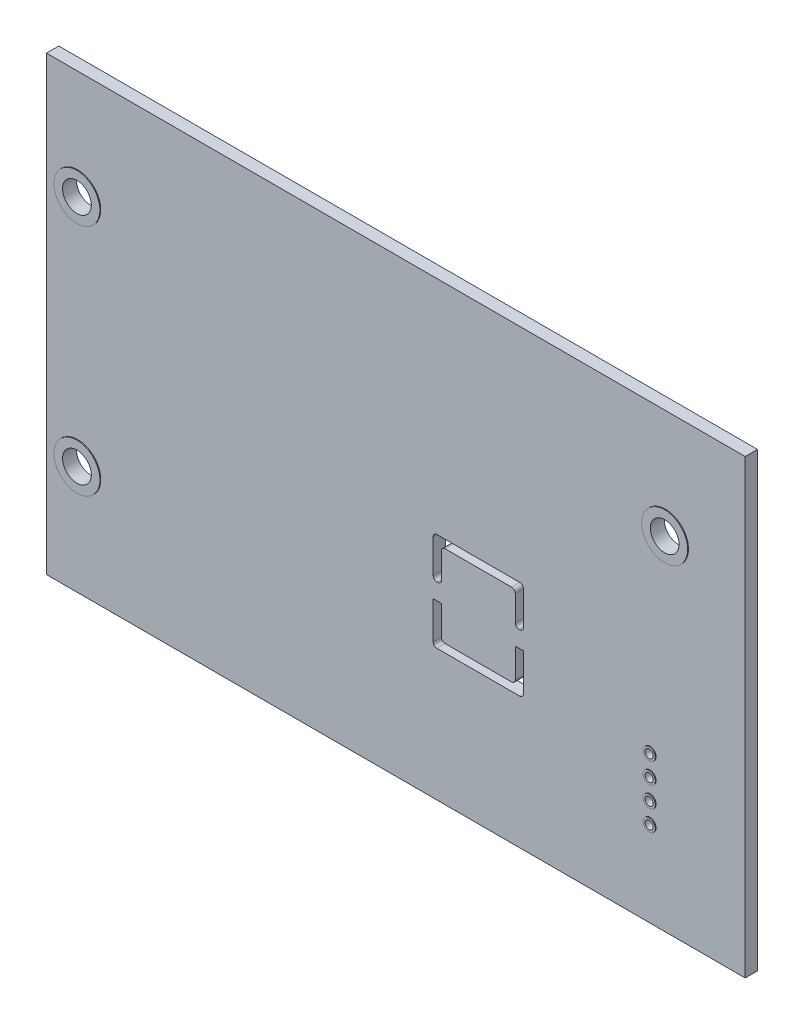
ISO-10303-21;
HEADER;
FILE_DESCRIPTION(('STEP AP214'),'2;1');
FILE_NAME('part.step','',(''),(''),'','','');
FILE_SCHEMA(('AUTOMOTIVE_DESIGN { 1 0 10303 214 1 1 1 1 }'));
ENDSEC;
DATA;
#1=APPLICATION_CONTEXT('core data for automotive mechanical design processes');
#2=APPLICATION_PROTOCOL_DEFINITION('international standard','automotive_design',2000,#1);
#3=PRODUCT_CONTEXT('',#1,'mechanical');
#4=PRODUCT('Part','Part','',(#3));
#5=PRODUCT_RELATED_PRODUCT_CATEGORY('part','',(#4));
#6=PRODUCT_DEFINITION_FORMATION('','',#4);
#7=PRODUCT_DEFINITION_CONTEXT('part definition',#1,'design');
#8=PRODUCT_DEFINITION('design','',#6,#7);
#9=PRODUCT_DEFINITION_SHAPE('','',#8);
#10=(LENGTH_UNIT() NAMED_UNIT(*) SI_UNIT(.MILLI.,.METRE.));
#11=(NAMED_UNIT(*) PLANE_ANGLE_UNIT() SI_UNIT($,.RADIAN.));
#12=(NAMED_UNIT(*) SI_UNIT($,.STERADIAN.) SOLID_ANGLE_UNIT());
#13=UNCERTAINTY_MEASURE_WITH_UNIT(LENGTH_MEASURE(1.E-05),#10,'distance_accuracy_value','');
#14=(GEOMETRIC_REPRESENTATION_CONTEXT(3) GLOBAL_UNCERTAINTY_ASSIGNED_CONTEXT((#13)) GLOBAL_UNIT_ASSIGNED_CONTEXT((#10,
#11,#12)) REPRESENTATION_CONTEXT('',''));
#15=CARTESIAN_POINT('',(0.,0.,0.));
#16=DIRECTION('',(0.,0.,1.));
#17=DIRECTION('',(1.,0.,0.));
#18=AXIS2_PLACEMENT_3D('',#15,#16,#17);
#19=CARTESIAN_POINT('',(0.,0.,1.5));
#20=DIRECTION('',(0.,0.,0.999999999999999));
#21=DIRECTION('',(1.,0.,0.));
#22=AXIS2_PLACEMENT_3D('',#19,#20,#21);
#23=PLANE('',#22);
#24=CARTESIAN_POINT('',(15.1,0.049999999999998,1.5));
#25=DIRECTION('',(0.,0.,0.999999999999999));
#26=DIRECTION('',(1.,0.,0.));
#27=AXIS2_PLACEMENT_3D('',#24,#25,#26);
#28=CIRCLE('',#27,0.45);
#29=CARTESIAN_POINT('',(15.1,0.499999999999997,1.5));
#30=VERTEX_POINT('',#29);
#31=CARTESIAN_POINT('',(15.55,0.0499999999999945,1.5));
#32=VERTEX_POINT('',#31);
#33=EDGE_CURVE('E255',#30,#32,#28,.F.);
#34=ORIENTED_EDGE('',*,*,#33,.T.);
#35=DIRECTION('',(0.,-1.,0.));
#36=VECTOR('',#35,1.);
#37=CARTESIAN_POINT('',(15.55,-4.05000000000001,1.5));
#38=LINE('',#37,#36);
#39=CARTESIAN_POINT('',(15.55,-4.05000000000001,1.5));
#40=VERTEX_POINT('',#39);
#41=EDGE_CURVE('E244',#32,#40,#38,.T.);
#42=ORIENTED_EDGE('',*,*,#41,.T.);
#43=CARTESIAN_POINT('',(15.1,-4.05000000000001,1.5));
#44=DIRECTION('',(0.,0.,0.999999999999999));
#45=DIRECTION('',(1.,0.,0.));
#46=AXIS2_PLACEMENT_3D('',#43,#44,#45);
#47=CIRCLE('',#46,0.45);
#48=CARTESIAN_POINT('',(15.1,-4.5,1.5));
#49=VERTEX_POINT('',#48);
#50=EDGE_CURVE('E1286',#40,#49,#47,.F.);
#51=ORIENTED_EDGE('',*,*,#50,.T.);
#52=DIRECTION('',(-1.,0.,0.));
#53=VECTOR('',#52,1.);
#54=CARTESIAN_POINT('',(15.,-4.5,1.5));
#55=LINE('',#54,#53);
#56=CARTESIAN_POINT('',(15.,-4.5,1.5));
#57=VERTEX_POINT('',#56);
#58=EDGE_CURVE('E1292',#49,#57,#55,.T.);
#59=ORIENTED_EDGE('',*,*,#58,.T.);
#60=CARTESIAN_POINT('',(15.,-4.05,1.5));
#61=DIRECTION('',(0.,0.,0.999999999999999));
#62=DIRECTION('',(1.,0.,0.));
#63=AXIS2_PLACEMENT_3D('',#60,#61,#62);
#64=CIRCLE('',#63,0.45);
#65=CARTESIAN_POINT('',(14.55,-4.05,1.5));
#66=VERTEX_POINT('',#65);
#67=EDGE_CURVE('E1295',#57,#66,#64,.F.);
#68=ORIENTED_EDGE('',*,*,#67,.T.);
#69=DIRECTION('',(0.,1.,0.));
#70=VECTOR('',#69,1.);
#71=CARTESIAN_POINT('',(14.55,-0.950000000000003,1.5));
#72=LINE('',#71,#70);
#73=CARTESIAN_POINT('',(14.55,-0.950000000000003,1.5));
#74=VERTEX_POINT('',#73);
#75=EDGE_CURVE('E1299',#66,#74,#72,.T.);
#76=ORIENTED_EDGE('',*,*,#75,.T.);
#77=CARTESIAN_POINT('',(14.1,-0.95,1.5));
#78=DIRECTION('',(0.,0.,0.999999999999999));
#79=DIRECTION('',(1.,0.,0.));
#80=AXIS2_PLACEMENT_3D('',#77,#78,#79);
#81=CIRCLE('',#80,0.45);
#82=CARTESIAN_POINT('',(14.1,-0.499999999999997,1.5));
#83=VERTEX_POINT('',#82);
#84=EDGE_CURVE('E1302',#74,#83,#81,.T.);
#85=ORIENTED_EDGE('',*,*,#84,.T.);
#86=DIRECTION('',(-1.,0.,0.));
#87=VECTOR('',#86,1.);
#88=CARTESIAN_POINT('',(6.00000000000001,-0.5,1.5));
#89=LINE('',#88,#87);
#90=CARTESIAN_POINT('',(6.00000000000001,-0.5,1.5));
#91=VERTEX_POINT('',#90);
#92=EDGE_CURVE('E1305',#83,#91,#89,.T.);
#93=ORIENTED_EDGE('',*,*,#92,.T.);
#94=CARTESIAN_POINT('',(6.00000000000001,-0.950000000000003,1.5));
#95=DIRECTION('',(0.,0.,0.999999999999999));
#96=DIRECTION('',(1.,0.,0.));
#97=AXIS2_PLACEMENT_3D('',#94,#95,#96);
#98=CIRCLE('',#97,0.45);
#99=CARTESIAN_POINT('',(5.55000000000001,-0.950000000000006,1.5));
#100=VERTEX_POINT('',#99);
#101=EDGE_CURVE('E1308',#91,#100,#98,.T.);
#102=ORIENTED_EDGE('',*,*,#101,.T.);
#103=DIRECTION('',(0.,-1.,0.));
#104=VECTOR('',#103,1.);
#105=CARTESIAN_POINT('',(5.55,-4.05,1.5));
#106=LINE('',#105,#104);
#107=CARTESIAN_POINT('',(5.55,-4.05,1.5));
#108=VERTEX_POINT('',#107);
#109=EDGE_CURVE('E1311',#100,#108,#106,.T.);
#110=ORIENTED_EDGE('',*,*,#109,.T.);
#111=CARTESIAN_POINT('',(5.1,-4.05000000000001,1.5));
#112=DIRECTION('',(0.,0.,0.999999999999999));
#113=DIRECTION('',(1.,0.,0.));
#114=AXIS2_PLACEMENT_3D('',#111,#112,#113);
#115=CIRCLE('',#114,0.45);
#116=CARTESIAN_POINT('',(5.1,-4.5,1.5));
#117=VERTEX_POINT('',#116);
#118=EDGE_CURVE('E1314',#108,#117,#115,.F.);
#119=ORIENTED_EDGE('',*,*,#118,.T.);
#120=DIRECTION('',(-1.,0.,0.));
#121=VECTOR('',#120,1.);
#122=CARTESIAN_POINT('',(5.00000000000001,-4.5,1.5));
#123=LINE('',#122,#121);
#124=CARTESIAN_POINT('',(5.00000000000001,-4.5,1.5));
#125=VERTEX_POINT('',#124);
#126=EDGE_CURVE('E1317',#117,#125,#123,.T.);
#127=ORIENTED_EDGE('',*,*,#126,.T.);
#128=CARTESIAN_POINT('',(5.00000000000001,-4.05000000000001,1.5));
#129=DIRECTION('',(0.,0.,0.999999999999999));
#130=DIRECTION('',(1.,0.,0.));
#131=AXIS2_PLACEMENT_3D('',#128,#129,#130);
#132=CIRCLE('',#131,0.45);
#133=CARTESIAN_POINT('',(4.55000000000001,-4.05,1.5));
#134=VERTEX_POINT('',#133);
#135=EDGE_CURVE('E1320',#125,#134,#132,.F.);
#136=ORIENTED_EDGE('',*,*,#135,.T.);
#137=DIRECTION('',(0.,1.,0.));
#138=VECTOR('',#137,1.);
#139=CARTESIAN_POINT('',(4.55000000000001,0.049999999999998,1.5));
#140=LINE('',#139,#138);
#141=CARTESIAN_POINT('',(4.55000000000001,0.049999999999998,1.5));
#142=VERTEX_POINT('',#141);
#143=EDGE_CURVE('E1323',#134,#142,#140,.T.);
#144=ORIENTED_EDGE('',*,*,#143,.T.);
#145=CARTESIAN_POINT('',(5.,0.0499999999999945,1.5));
#146=DIRECTION('',(0.,0.,0.999999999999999));
#147=DIRECTION('',(1.,0.,0.));
#148=AXIS2_PLACEMENT_3D('',#145,#146,#147);
#149=CIRCLE('',#148,0.45);
#150=CARTESIAN_POINT('',(5.00000000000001,0.499999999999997,1.5));
#151=VERTEX_POINT('',#150);
#152=EDGE_CURVE('E266',#142,#151,#149,.F.);
#153=ORIENTED_EDGE('',*,*,#152,.T.);
#154=DIRECTION('',(1.,0.,0.));
#155=VECTOR('',#154,1.);
#156=CARTESIAN_POINT('',(15.1,0.499999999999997,1.5));
#157=LINE('',#156,#155);
#158=EDGE_CURVE('E262',#151,#30,#157,.T.);
#159=ORIENTED_EDGE('',*,*,#158,.T.);
#160=EDGE_LOOP('',(#34,#42,#51,#59,#68,#76,#85,#93,#102,#110,#119,#127,#136,#144,#153,#159));
#161=FACE_BOUND('',#160,.T.);
#162=DIRECTION('',(0.,1.,0.));
#163=VECTOR('',#162,1.);
#164=CARTESIAN_POINT('',(14.55,-10.05,1.5));
#165=LINE('',#164,#163);
#166=CARTESIAN_POINT('',(14.55,-10.05,1.5));
#167=VERTEX_POINT('',#166);
#168=CARTESIAN_POINT('',(14.55,-6.50000000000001,1.5));
#169=VERTEX_POINT('',#168);
#170=EDGE_CURVE('E369',#167,#169,#165,.T.);
#171=ORIENTED_EDGE('',*,*,#170,.T.);
#172=DIRECTION('',(1.,0.,0.));
#173=VECTOR('',#172,1.);
#174=CARTESIAN_POINT('',(14.55,-6.50000000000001,1.5));
#175=LINE('',#174,#173);
#176=CARTESIAN_POINT('',(15.55,-6.50000000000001,1.5));
#177=VERTEX_POINT('',#176);
#178=EDGE_CURVE('E410',#169,#177,#175,.T.);
#179=ORIENTED_EDGE('',*,*,#178,.T.);
#180=DIRECTION('',(0.,-1.,0.));
#181=VECTOR('',#180,1.);
#182=CARTESIAN_POINT('',(15.55,-6.50000000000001,1.5));
#183=LINE('',#182,#181);
#184=CARTESIAN_POINT('',(15.55,-11.05,1.5));
#185=VERTEX_POINT('',#184);
#186=EDGE_CURVE('E251',#177,#185,#183,.T.);
#187=ORIENTED_EDGE('',*,*,#186,.T.);
#188=CARTESIAN_POINT('',(15.1,-11.05,1.5));
#189=DIRECTION('',(0.,0.,0.999999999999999));
#190=DIRECTION('',(1.,0.,0.));
#191=AXIS2_PLACEMENT_3D('',#188,#189,#190);
#192=CIRCLE('',#191,0.450000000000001);
#193=CARTESIAN_POINT('',(15.1,-11.5,1.5));
#194=VERTEX_POINT('',#193);
#195=EDGE_CURVE('E342',#185,#194,#192,.F.);
#196=ORIENTED_EDGE('',*,*,#195,.T.);
#197=DIRECTION('',(-1.,0.,0.));
#198=VECTOR('',#197,1.);
#199=CARTESIAN_POINT('',(15.1,-11.5,1.5));
#200=LINE('',#199,#198);
#201=CARTESIAN_POINT('',(5.00000000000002,-11.5,1.5));
#202=VERTEX_POINT('',#201);
#203=EDGE_CURVE('E345',#194,#202,#200,.T.);
#204=ORIENTED_EDGE('',*,*,#203,.T.);
#205=CARTESIAN_POINT('',(5.00000000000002,-11.05,1.5));
#206=DIRECTION('',(0.,0.,0.999999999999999));
#207=DIRECTION('',(1.,0.,0.));
#208=AXIS2_PLACEMENT_3D('',#205,#206,#207);
#209=CIRCLE('',#208,0.45);
#210=CARTESIAN_POINT('',(4.55000000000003,-11.05,1.5));
#211=VERTEX_POINT('',#210);
#212=EDGE_CURVE('E348',#202,#211,#209,.F.);
#213=ORIENTED_EDGE('',*,*,#212,.T.);
#214=DIRECTION('',(0.,1.,0.));
#215=VECTOR('',#214,1.);
#216=CARTESIAN_POINT('',(4.55000000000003,-11.05,1.5));
#217=LINE('',#216,#215);
#218=CARTESIAN_POINT('',(4.55000000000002,-6.50000000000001,1.5));
#219=VERTEX_POINT('',#218);
#220=EDGE_CURVE('E351',#211,#219,#217,.T.);
#221=ORIENTED_EDGE('',*,*,#220,.T.);
#222=DIRECTION('',(1.,0.,0.));
#223=VECTOR('',#222,1.);
#224=CARTESIAN_POINT('',(4.55000000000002,-6.50000000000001,1.5));
#225=LINE('',#224,#223);
#226=CARTESIAN_POINT('',(5.55000000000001,-6.5,1.5));
#227=VERTEX_POINT('',#226);
#228=EDGE_CURVE('E354',#219,#227,#225,.T.);
#229=ORIENTED_EDGE('',*,*,#228,.T.);
#230=DIRECTION('',(0.,-1.,0.));
#231=VECTOR('',#230,1.);
#232=CARTESIAN_POINT('',(5.55000000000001,-6.5,1.5));
#233=LINE('',#232,#231);
#234=CARTESIAN_POINT('',(5.55000000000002,-10.05,1.5));
#235=VERTEX_POINT('',#234);
#236=EDGE_CURVE('E357',#227,#235,#233,.T.);
#237=ORIENTED_EDGE('',*,*,#236,.T.);
#238=CARTESIAN_POINT('',(6.00000000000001,-10.05,1.5));
#239=DIRECTION('',(0.,0.,0.999999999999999));
#240=DIRECTION('',(1.,0.,0.));
#241=AXIS2_PLACEMENT_3D('',#238,#239,#240);
#242=CIRCLE('',#241,0.45);
#243=CARTESIAN_POINT('',(6.00000000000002,-10.5,1.5));
#244=VERTEX_POINT('',#243);
#245=EDGE_CURVE('E360',#235,#244,#242,.T.);
#246=ORIENTED_EDGE('',*,*,#245,.T.);
#247=DIRECTION('',(1.,0.,0.));
#248=VECTOR('',#247,1.);
#249=CARTESIAN_POINT('',(6.00000000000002,-10.5,1.5));
#250=LINE('',#249,#248);
#251=CARTESIAN_POINT('',(14.1,-10.5,1.5));
#252=VERTEX_POINT('',#251);
#253=EDGE_CURVE('E363',#244,#252,#250,.T.);
#254=ORIENTED_EDGE('',*,*,#253,.T.);
#255=CARTESIAN_POINT('',(14.1,-10.05,1.5));
#256=DIRECTION('',(0.,0.,0.999999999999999));
#257=DIRECTION('',(1.,0.,0.));
#258=AXIS2_PLACEMENT_3D('',#255,#256,#257);
#259=CIRCLE('',#258,0.450000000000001);
#260=EDGE_CURVE('E366',#252,#167,#259,.T.);
#261=ORIENTED_EDGE('',*,*,#260,.T.);
#262=EDGE_LOOP('',(#171,#179,#187,#196,#204,#213,#221,#229,#237,#246,#254,#261));
#263=FACE_BOUND('',#262,.T.);
#264=CARTESIAN_POINT('',(30.95,-9.6,1.5));
#265=DIRECTION('',(0.,0.,0.999999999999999));
#266=DIRECTION('',(1.,0.,0.));
#267=AXIS2_PLACEMENT_3D('',#264,#265,#266);
#268=CIRCLE('',#267,0.750000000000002);
#269=CARTESIAN_POINT('',(30.2,-9.6,1.5));
#270=VERTEX_POINT('',#269);
#271=EDGE_CURVE('E11',#270,#270,#268,.T.);
#272=ORIENTED_EDGE('',*,*,#271,.F.);
#273=EDGE_LOOP('',(#272));
#274=FACE_BOUND('',#273,.T.);
#275=CARTESIAN_POINT('',(30.95,-12.1,1.5));
#276=DIRECTION('',(0.,0.,0.999999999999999));
#277=DIRECTION('',(1.,0.,0.));
#278=AXIS2_PLACEMENT_3D('',#275,#276,#277);
#279=CIRCLE('',#278,0.750000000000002);
#280=CARTESIAN_POINT('',(30.2,-12.1,1.5));
#281=VERTEX_POINT('',#280);
#282=EDGE_CURVE('E43',#281,#281,#279,.T.);
#283=ORIENTED_EDGE('',*,*,#282,.F.);
#284=EDGE_LOOP('',(#283));
#285=FACE_BOUND('',#284,.T.);
#286=CARTESIAN_POINT('',(30.95,-14.6,1.5));
#287=DIRECTION('',(0.,0.,0.999999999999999));
#288=DIRECTION('',(1.,0.,0.));
#289=AXIS2_PLACEMENT_3D('',#286,#287,#288);
#290=CIRCLE('',#289,0.750000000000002);
#291=CARTESIAN_POINT('',(30.2,-14.6,1.5));
#292=VERTEX_POINT('',#291);
#293=EDGE_CURVE('E462',#292,#292,#290,.T.);
#294=ORIENTED_EDGE('',*,*,#293,.F.);
#295=EDGE_LOOP('',(#294));
#296=FACE_BOUND('',#295,.T.);
#297=CARTESIAN_POINT('',(30.95,-17.1,1.5));
#298=DIRECTION('',(0.,0.,0.999999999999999));
#299=DIRECTION('',(1.,0.,0.));
#300=AXIS2_PLACEMENT_3D('',#297,#298,#299);
#301=CIRCLE('',#300,0.750000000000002);
#302=CARTESIAN_POINT('',(30.2,-17.1,1.5));
#303=VERTEX_POINT('',#302);
#304=EDGE_CURVE('E478',#303,#303,#301,.T.);
#305=ORIENTED_EDGE('',*,*,#304,.F.);
#306=EDGE_LOOP('',(#305));
#307=FACE_BOUND('',#306,.T.);
#308=CARTESIAN_POINT('',(32.84,14.29,1.5));
#309=DIRECTION('',(0.,0.,0.999999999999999));
#310=DIRECTION('',(1.,0.,0.));
#311=AXIS2_PLACEMENT_3D('',#308,#309,#310);
#312=CIRCLE('',#311,2.8);
#313=CARTESIAN_POINT('',(35.64,14.29,1.5));
#314=VERTEX_POINT('',#313);
#315=EDGE_CURVE('E494',#314,#314,#312,.T.);
#316=ORIENTED_EDGE('',*,*,#315,.F.);
#317=EDGE_LOOP('',(#316));
#318=FACE_BOUND('',#317,.T.);
#319=CARTESIAN_POINT('',(-38.7399999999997,-14.16,1.5));
#320=DIRECTION('',(0.,0.,0.999999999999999));
#321=DIRECTION('',(1.,0.,0.));
#322=AXIS2_PLACEMENT_3D('',#319,#320,#321);
#323=CIRCLE('',#322,2.8);
#324=CARTESIAN_POINT('',(-35.9399999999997,-14.16,1.5));
#325=VERTEX_POINT('',#324);
#326=EDGE_CURVE('E510',#325,#325,#323,.T.);
#327=ORIENTED_EDGE('',*,*,#326,.F.);
#328=EDGE_LOOP('',(#327));
#329=FACE_BOUND('',#328,.T.);
#330=CARTESIAN_POINT('',(-38.74,14.29,1.5));
#331=DIRECTION('',(0.,0.,0.999999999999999));
#332=DIRECTION('',(1.,0.,0.));
#333=AXIS2_PLACEMENT_3D('',#330,#331,#332);
#334=CIRCLE('',#333,2.8);
#335=CARTESIAN_POINT('',(-35.94,14.29,1.5));
#336=VERTEX_POINT('',#335);
#337=EDGE_CURVE('E526',#336,#336,#334,.T.);
#338=ORIENTED_EDGE('',*,*,#337,.F.);
#339=EDGE_LOOP('',(#338));
#340=FACE_BOUND('',#339,.T.);
#341=DIRECTION('',(0.,1.,0.));
#342=VECTOR('',#341,1.);
#343=CARTESIAN_POINT('',(42.55,27.5,1.5));
#344=LINE('',#343,#342);
#345=CARTESIAN_POINT('',(42.55,-27.5,1.5));
#346=VERTEX_POINT('',#345);
#347=CARTESIAN_POINT('',(42.55,27.5,1.5));
#348=VERTEX_POINT('',#347);
#349=EDGE_CURVE('E543',#346,#348,#344,.T.);
#350=ORIENTED_EDGE('',*,*,#349,.T.);
#351=DIRECTION('',(-1.,0.,0.));
#352=VECTOR('',#351,1.);
#353=CARTESIAN_POINT('',(-42.55,27.5,1.5));
#354=LINE('',#353,#352);
#355=CARTESIAN_POINT('',(-42.55,27.5,1.5));
#356=VERTEX_POINT('',#355);
#357=EDGE_CURVE('E546',#348,#356,#354,.T.);
#358=ORIENTED_EDGE('',*,*,#357,.T.);
#359=DIRECTION('',(0.,-1.,0.));
#360=VECTOR('',#359,1.);
#361=CARTESIAN_POINT('',(-42.55,27.5,1.5));
#362=LINE('',#361,#360);
#363=CARTESIAN_POINT('',(-42.55,-27.5,1.5));
#364=VERTEX_POINT('',#363);
#365=EDGE_CURVE('E549',#356,#364,#362,.T.);
#366=ORIENTED_EDGE('',*,*,#365,.T.);
#367=DIRECTION('',(1.,0.,0.));
#368=VECTOR('',#367,1.);
#369=CARTESIAN_POINT('',(-42.55,-27.5,1.5));
#370=LINE('',#369,#368);
#371=EDGE_CURVE('E551',#364,#346,#370,.T.);
#372=ORIENTED_EDGE('',*,*,#371,.T.);
#373=EDGE_LOOP('',(#350,#358,#366,#372));
#374=FACE_BOUND('',#373,.T.);
#375=ADVANCED_FACE('F34',(#161,#263,#274,#285,#296,#307,#318,#329,#340,#374),#23,.T.);
#376=CARTESIAN_POINT('',(0.,0.,0.));
#377=DIRECTION('',(0.,0.,0.999999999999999));
#378=DIRECTION('',(1.,0.,0.));
#379=AXIS2_PLACEMENT_3D('',#376,#377,#378);
#380=PLANE('',#379);
#381=DIRECTION('',(0.,-1.,0.));
#382=VECTOR('',#381,1.);
#383=CARTESIAN_POINT('',(15.55,-4.05000000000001,0.));
#384=LINE('',#383,#382);
#385=CARTESIAN_POINT('',(15.55,0.0499999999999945,0.));
#386=VERTEX_POINT('',#385);
#387=CARTESIAN_POINT('',(15.55,-4.05000000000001,0.));
#388=VERTEX_POINT('',#387);
#389=EDGE_CURVE('E264',#386,#388,#384,.T.);
#390=ORIENTED_EDGE('',*,*,#389,.F.);
#391=CARTESIAN_POINT('',(15.1,0.049999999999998,0.));
#392=DIRECTION('',(0.,0.,-0.999999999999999));
#393=DIRECTION('',(1.,0.,0.));
#394=AXIS2_PLACEMENT_3D('',#391,#392,#393);
#395=CIRCLE('',#394,0.45);
#396=CARTESIAN_POINT('',(15.1,0.499999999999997,0.));
#397=VERTEX_POINT('',#396);
#398=EDGE_CURVE('E59',#397,#386,#395,.T.);
#399=ORIENTED_EDGE('',*,*,#398,.F.);
#400=DIRECTION('',(1.,0.,0.));
#401=VECTOR('',#400,1.);
#402=CARTESIAN_POINT('',(15.1,0.499999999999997,0.));
#403=LINE('',#402,#401);
#404=CARTESIAN_POINT('',(5.00000000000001,0.499999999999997,0.));
#405=VERTEX_POINT('',#404);
#406=EDGE_CURVE('E257',#405,#397,#403,.T.);
#407=ORIENTED_EDGE('',*,*,#406,.F.);
#408=CARTESIAN_POINT('',(5.,0.0499999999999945,0.));
#409=DIRECTION('',(0.,0.,-0.999999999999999));
#410=DIRECTION('',(1.,0.,0.));
#411=AXIS2_PLACEMENT_3D('',#408,#409,#410);
#412=CIRCLE('',#411,0.45);
#413=CARTESIAN_POINT('',(4.55000000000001,0.049999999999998,0.));
#414=VERTEX_POINT('',#413);
#415=EDGE_CURVE('E307',#414,#405,#412,.T.);
#416=ORIENTED_EDGE('',*,*,#415,.F.);
#417=DIRECTION('',(0.,1.,0.));
#418=VECTOR('',#417,1.);
#419=CARTESIAN_POINT('',(4.55000000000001,0.049999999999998,0.));
#420=LINE('',#419,#418);
#421=CARTESIAN_POINT('',(4.55000000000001,-4.05,0.));
#422=VERTEX_POINT('',#421);
#423=EDGE_CURVE('E304',#422,#414,#420,.T.);
#424=ORIENTED_EDGE('',*,*,#423,.F.);
#425=CARTESIAN_POINT('',(5.00000000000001,-4.05000000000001,0.));
#426=DIRECTION('',(0.,0.,-0.999999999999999));
#427=DIRECTION('',(1.,0.,0.));
#428=AXIS2_PLACEMENT_3D('',#425,#426,#427);
#429=CIRCLE('',#428,0.45);
#430=CARTESIAN_POINT('',(5.00000000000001,-4.5,0.));
#431=VERTEX_POINT('',#430);
#432=EDGE_CURVE('E301',#431,#422,#429,.T.);
#433=ORIENTED_EDGE('',*,*,#432,.F.);
#434=DIRECTION('',(-1.,0.,0.));
#435=VECTOR('',#434,1.);
#436=CARTESIAN_POINT('',(5.00000000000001,-4.5,0.));
#437=LINE('',#436,#435);
#438=CARTESIAN_POINT('',(5.1,-4.5,0.));
#439=VERTEX_POINT('',#438);
#440=EDGE_CURVE('E298',#439,#431,#437,.T.);
#441=ORIENTED_EDGE('',*,*,#440,.F.);
#442=CARTESIAN_POINT('',(5.1,-4.05000000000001,0.));
#443=DIRECTION('',(0.,0.,-0.999999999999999));
#444=DIRECTION('',(1.,0.,0.));
#445=AXIS2_PLACEMENT_3D('',#442,#443,#444);
#446=CIRCLE('',#445,0.45);
#447=CARTESIAN_POINT('',(5.55,-4.05,0.));
#448=VERTEX_POINT('',#447);
#449=EDGE_CURVE('E295',#448,#439,#446,.T.);
#450=ORIENTED_EDGE('',*,*,#449,.F.);
#451=DIRECTION('',(0.,-1.,0.));
#452=VECTOR('',#451,1.);
#453=CARTESIAN_POINT('',(5.55,-4.05,0.));
#454=LINE('',#453,#452);
#455=CARTESIAN_POINT('',(5.55000000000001,-0.950000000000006,0.));
#456=VERTEX_POINT('',#455);
#457=EDGE_CURVE('E292',#456,#448,#454,.T.);
#458=ORIENTED_EDGE('',*,*,#457,.F.);
#459=CARTESIAN_POINT('',(6.00000000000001,-0.950000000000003,0.));
#460=DIRECTION('',(0.,0.,0.999999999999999));
#461=DIRECTION('',(-1.,0.,0.));
#462=AXIS2_PLACEMENT_3D('',#459,#460,#461);
#463=CIRCLE('',#462,0.45);
#464=CARTESIAN_POINT('',(6.00000000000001,-0.5,0.));
#465=VERTEX_POINT('',#464);
#466=EDGE_CURVE('E289',#465,#456,#463,.T.);
#467=ORIENTED_EDGE('',*,*,#466,.F.);
#468=DIRECTION('',(-1.,0.,0.));
#469=VECTOR('',#468,1.);
#470=CARTESIAN_POINT('',(6.00000000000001,-0.5,0.));
#471=LINE('',#470,#469);
#472=CARTESIAN_POINT('',(14.1,-0.499999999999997,0.));
#473=VERTEX_POINT('',#472);
#474=EDGE_CURVE('E286',#473,#465,#471,.T.);
#475=ORIENTED_EDGE('',*,*,#474,.F.);
#476=CARTESIAN_POINT('',(14.1,-0.95,0.));
#477=DIRECTION('',(0.,0.,0.999999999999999));
#478=DIRECTION('',(-1.,0.,0.));
#479=AXIS2_PLACEMENT_3D('',#476,#477,#478);
#480=CIRCLE('',#479,0.45);
#481=CARTESIAN_POINT('',(14.55,-0.950000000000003,0.));
#482=VERTEX_POINT('',#481);
#483=EDGE_CURVE('E283',#482,#473,#480,.T.);
#484=ORIENTED_EDGE('',*,*,#483,.F.);
#485=DIRECTION('',(0.,1.,0.));
#486=VECTOR('',#485,1.);
#487=CARTESIAN_POINT('',(14.55,-0.950000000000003,0.));
#488=LINE('',#487,#486);
#489=CARTESIAN_POINT('',(14.55,-4.05,0.));
#490=VERTEX_POINT('',#489);
#491=EDGE_CURVE('E280',#490,#482,#488,.T.);
#492=ORIENTED_EDGE('',*,*,#491,.F.);
#493=CARTESIAN_POINT('',(15.,-4.05,0.));
#494=DIRECTION('',(0.,0.,-0.999999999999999));
#495=DIRECTION('',(1.,0.,0.));
#496=AXIS2_PLACEMENT_3D('',#493,#494,#495);
#497=CIRCLE('',#496,0.45);
#498=CARTESIAN_POINT('',(15.,-4.5,0.));
#499=VERTEX_POINT('',#498);
#500=EDGE_CURVE('E277',#499,#490,#497,.T.);
#501=ORIENTED_EDGE('',*,*,#500,.F.);
#502=DIRECTION('',(-1.,0.,0.));
#503=VECTOR('',#502,1.);
#504=CARTESIAN_POINT('',(15.,-4.5,0.));
#505=LINE('',#504,#503);
#506=CARTESIAN_POINT('',(15.1,-4.5,0.));
#507=VERTEX_POINT('',#506);
#508=EDGE_CURVE('E274',#507,#499,#505,.T.);
#509=ORIENTED_EDGE('',*,*,#508,.F.);
#510=CARTESIAN_POINT('',(15.1,-4.05000000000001,0.));
#511=DIRECTION('',(0.,0.,-0.999999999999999));
#512=DIRECTION('',(-1.,0.,0.));
#513=AXIS2_PLACEMENT_3D('',#510,#511,#512);
#514=CIRCLE('',#513,0.45);
#515=EDGE_CURVE('E271',#388,#507,#514,.T.);
#516=ORIENTED_EDGE('',*,*,#515,.F.);
#517=EDGE_LOOP('',(#390,#399,#407,#416,#424,#433,#441,#450,#458,#467,#475,#484,#492,#501,#509,#516));
#518=FACE_BOUND('',#517,.T.);
#519=DIRECTION('',(1.,0.,0.));
#520=VECTOR('',#519,1.);
#521=CARTESIAN_POINT('',(14.55,-6.50000000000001,0.));
#522=LINE('',#521,#520);
#523=CARTESIAN_POINT('',(14.55,-6.50000000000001,0.));
#524=VERTEX_POINT('',#523);
#525=CARTESIAN_POINT('',(15.55,-6.50000000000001,0.));
#526=VERTEX_POINT('',#525);
#527=EDGE_CURVE('E374',#524,#526,#522,.T.);
#528=ORIENTED_EDGE('',*,*,#527,.F.);
#529=DIRECTION('',(0.,1.,0.));
#530=VECTOR('',#529,1.);
#531=CARTESIAN_POINT('',(14.55,-10.05,0.));
#532=LINE('',#531,#530);
#533=CARTESIAN_POINT('',(14.55,-10.05,0.));
#534=VERTEX_POINT('',#533);
#535=EDGE_CURVE('E372',#534,#524,#532,.T.);
#536=ORIENTED_EDGE('',*,*,#535,.F.);
#537=CARTESIAN_POINT('',(14.1,-10.05,0.));
#538=DIRECTION('',(0.,0.,0.999999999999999));
#539=DIRECTION('',(-1.,0.,0.));
#540=AXIS2_PLACEMENT_3D('',#537,#538,#539);
#541=CIRCLE('',#540,0.450000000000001);
#542=CARTESIAN_POINT('',(14.1,-10.5,0.));
#543=VERTEX_POINT('',#542);
#544=EDGE_CURVE('E404',#543,#534,#541,.T.);
#545=ORIENTED_EDGE('',*,*,#544,.F.);
#546=DIRECTION('',(1.,0.,0.));
#547=VECTOR('',#546,1.);
#548=CARTESIAN_POINT('',(6.00000000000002,-10.5,0.));
#549=LINE('',#548,#547);
#550=CARTESIAN_POINT('',(6.00000000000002,-10.5,0.));
#551=VERTEX_POINT('',#550);
#552=EDGE_CURVE('E401',#551,#543,#549,.T.);
#553=ORIENTED_EDGE('',*,*,#552,.F.);
#554=CARTESIAN_POINT('',(6.00000000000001,-10.05,0.));
#555=DIRECTION('',(0.,0.,0.999999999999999));
#556=DIRECTION('',(-1.,0.,0.));
#557=AXIS2_PLACEMENT_3D('',#554,#555,#556);
#558=CIRCLE('',#557,0.45);
#559=CARTESIAN_POINT('',(5.55000000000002,-10.05,0.));
#560=VERTEX_POINT('',#559);
#561=EDGE_CURVE('E398',#560,#551,#558,.T.);
#562=ORIENTED_EDGE('',*,*,#561,.F.);
#563=DIRECTION('',(0.,-1.,0.));
#564=VECTOR('',#563,1.);
#565=CARTESIAN_POINT('',(5.55000000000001,-6.5,0.));
#566=LINE('',#565,#564);
#567=CARTESIAN_POINT('',(5.55000000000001,-6.5,0.));
#568=VERTEX_POINT('',#567);
#569=EDGE_CURVE('E395',#568,#560,#566,.T.);
#570=ORIENTED_EDGE('',*,*,#569,.F.);
#571=DIRECTION('',(1.,0.,0.));
#572=VECTOR('',#571,1.);
#573=CARTESIAN_POINT('',(4.55000000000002,-6.50000000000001,0.));
#574=LINE('',#573,#572);
#575=CARTESIAN_POINT('',(4.55000000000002,-6.50000000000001,0.));
#576=VERTEX_POINT('',#575);
#577=EDGE_CURVE('E392',#576,#568,#574,.T.);
#578=ORIENTED_EDGE('',*,*,#577,.F.);
#579=DIRECTION('',(0.,1.,0.));
#580=VECTOR('',#579,1.);
#581=CARTESIAN_POINT('',(4.55000000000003,-11.05,0.));
#582=LINE('',#581,#580);
#583=CARTESIAN_POINT('',(4.55000000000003,-11.05,0.));
#584=VERTEX_POINT('',#583);
#585=EDGE_CURVE('E389',#584,#576,#582,.T.);
#586=ORIENTED_EDGE('',*,*,#585,.F.);
#587=CARTESIAN_POINT('',(5.00000000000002,-11.05,0.));
#588=DIRECTION('',(0.,0.,-0.999999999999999));
#589=DIRECTION('',(1.,0.,0.));
#590=AXIS2_PLACEMENT_3D('',#587,#588,#589);
#591=CIRCLE('',#590,0.45);
#592=CARTESIAN_POINT('',(5.00000000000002,-11.5,0.));
#593=VERTEX_POINT('',#592);
#594=EDGE_CURVE('E386',#593,#584,#591,.T.);
#595=ORIENTED_EDGE('',*,*,#594,.F.);
#596=DIRECTION('',(-1.,0.,0.));
#597=VECTOR('',#596,1.);
#598=CARTESIAN_POINT('',(15.1,-11.5,0.));
#599=LINE('',#598,#597);
#600=CARTESIAN_POINT('',(15.1,-11.5,0.));
#601=VERTEX_POINT('',#600);
#602=EDGE_CURVE('E383',#601,#593,#599,.T.);
#603=ORIENTED_EDGE('',*,*,#602,.F.);
#604=CARTESIAN_POINT('',(15.1,-11.05,0.));
#605=DIRECTION('',(0.,0.,-0.999999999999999));
#606=DIRECTION('',(1.,0.,0.));
#607=AXIS2_PLACEMENT_3D('',#604,#605,#606);
#608=CIRCLE('',#607,0.450000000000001);
#609=CARTESIAN_POINT('',(15.55,-11.05,0.));
#610=VERTEX_POINT('',#609);
#611=EDGE_CURVE('E380',#610,#601,#608,.T.);
#612=ORIENTED_EDGE('',*,*,#611,.F.);
#613=DIRECTION('',(0.,-1.,0.));
#614=VECTOR('',#613,1.);
#615=CARTESIAN_POINT('',(15.55,-6.50000000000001,0.));
#616=LINE('',#615,#614);
#617=EDGE_CURVE('E377',#526,#610,#616,.T.);
#618=ORIENTED_EDGE('',*,*,#617,.F.);
#619=EDGE_LOOP('',(#528,#536,#545,#553,#562,#570,#578,#586,#595,#603,#612,#618));
#620=FACE_BOUND('',#619,.T.);
#621=CARTESIAN_POINT('',(30.95,-9.6,0.));
#622=DIRECTION('',(0.,0.,0.999999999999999));
#623=DIRECTION('',(1.,0.,0.));
#624=AXIS2_PLACEMENT_3D('',#621,#622,#623);
#625=CIRCLE('',#624,0.750000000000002);
#626=CARTESIAN_POINT('',(30.2,-9.6,0.));
#627=VERTEX_POINT('',#626);
#628=EDGE_CURVE('E38',#627,#627,#625,.T.);
#629=ORIENTED_EDGE('',*,*,#628,.T.);
#630=EDGE_LOOP('',(#629));
#631=FACE_BOUND('',#630,.T.);
#632=CARTESIAN_POINT('',(30.95,-12.1,0.));
#633=DIRECTION('',(0.,0.,0.999999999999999));
#634=DIRECTION('',(1.,0.,0.));
#635=AXIS2_PLACEMENT_3D('',#632,#633,#634);
#636=CIRCLE('',#635,0.750000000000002);
#637=CARTESIAN_POINT('',(30.2,-12.1,0.));
#638=VERTEX_POINT('',#637);
#639=EDGE_CURVE('E459',#638,#638,#636,.T.);
#640=ORIENTED_EDGE('',*,*,#639,.T.);
#641=EDGE_LOOP('',(#640));
#642=FACE_BOUND('',#641,.T.);
#643=CARTESIAN_POINT('',(30.95,-14.6,0.));
#644=DIRECTION('',(0.,0.,0.999999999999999));
#645=DIRECTION('',(1.,0.,0.));
#646=AXIS2_PLACEMENT_3D('',#643,#644,#645);
#647=CIRCLE('',#646,0.750000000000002);
#648=CARTESIAN_POINT('',(30.2,-14.6,0.));
#649=VERTEX_POINT('',#648);
#650=EDGE_CURVE('E475',#649,#649,#647,.T.);
#651=ORIENTED_EDGE('',*,*,#650,.T.);
#652=EDGE_LOOP('',(#651));
#653=FACE_BOUND('',#652,.T.);
#654=CARTESIAN_POINT('',(30.95,-17.1,0.));
#655=DIRECTION('',(0.,0.,0.999999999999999));
#656=DIRECTION('',(1.,0.,0.));
#657=AXIS2_PLACEMENT_3D('',#654,#655,#656);
#658=CIRCLE('',#657,0.750000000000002);
#659=CARTESIAN_POINT('',(30.2,-17.1,0.));
#660=VERTEX_POINT('',#659);
#661=EDGE_CURVE('E491',#660,#660,#658,.T.);
#662=ORIENTED_EDGE('',*,*,#661,.T.);
#663=EDGE_LOOP('',(#662));
#664=FACE_BOUND('',#663,.T.);
#665=CARTESIAN_POINT('',(32.84,14.29,0.));
#666=DIRECTION('',(0.,0.,0.999999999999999));
#667=DIRECTION('',(1.,0.,0.));
#668=AXIS2_PLACEMENT_3D('',#665,#666,#667);
#669=CIRCLE('',#668,2.8);
#670=CARTESIAN_POINT('',(35.64,14.29,0.));
#671=VERTEX_POINT('',#670);
#672=EDGE_CURVE('E507',#671,#671,#669,.T.);
#673=ORIENTED_EDGE('',*,*,#672,.T.);
#674=EDGE_LOOP('',(#673));
#675=FACE_BOUND('',#674,.T.);
#676=CARTESIAN_POINT('',(-38.7399999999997,-14.16,0.));
#677=DIRECTION('',(0.,0.,0.999999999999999));
#678=DIRECTION('',(1.,0.,0.));
#679=AXIS2_PLACEMENT_3D('',#676,#677,#678);
#680=CIRCLE('',#679,2.8);
#681=CARTESIAN_POINT('',(-35.9399999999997,-14.16,0.));
#682=VERTEX_POINT('',#681);
#683=EDGE_CURVE('E523',#682,#682,#680,.T.);
#684=ORIENTED_EDGE('',*,*,#683,.T.);
#685=EDGE_LOOP('',(#684));
#686=FACE_BOUND('',#685,.T.);
#687=CARTESIAN_POINT('',(-38.74,14.29,0.));
#688=DIRECTION('',(0.,0.,0.999999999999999));
#689=DIRECTION('',(1.,0.,0.));
#690=AXIS2_PLACEMENT_3D('',#687,#688,#689);
#691=CIRCLE('',#690,2.8);
#692=CARTESIAN_POINT('',(-35.94,14.29,0.));
#693=VERTEX_POINT('',#692);
#694=EDGE_CURVE('E539',#693,#693,#691,.T.);
#695=ORIENTED_EDGE('',*,*,#694,.T.);
#696=EDGE_LOOP('',(#695));
#697=FACE_BOUND('',#696,.T.);
#698=DIRECTION('',(0.,1.,0.));
#699=VECTOR('',#698,1.);
#700=CARTESIAN_POINT('',(42.55,27.5,0.));
#701=LINE('',#700,#699);
#702=CARTESIAN_POINT('',(42.55,-27.5,0.));
#703=VERTEX_POINT('',#702);
#704=CARTESIAN_POINT('',(42.55,27.5,0.));
#705=VERTEX_POINT('',#704);
#706=EDGE_CURVE('E554',#703,#705,#701,.T.);
#707=ORIENTED_EDGE('',*,*,#706,.F.);
#708=DIRECTION('',(1.,0.,0.));
#709=VECTOR('',#708,1.);
#710=CARTESIAN_POINT('',(-42.55,-27.5,0.));
#711=LINE('',#710,#709);
#712=CARTESIAN_POINT('',(-42.55,-27.5,0.));
#713=VERTEX_POINT('',#712);
#714=EDGE_CURVE('E547',#713,#703,#711,.T.);
#715=ORIENTED_EDGE('',*,*,#714,.F.);
#716=DIRECTION('',(0.,-1.,0.));
#717=VECTOR('',#716,1.);
#718=CARTESIAN_POINT('',(-42.55,27.5,0.));
#719=LINE('',#718,#717);
#720=CARTESIAN_POINT('',(-42.55,27.5,0.));
#721=VERTEX_POINT('',#720);
#722=EDGE_CURVE('E559',#721,#713,#719,.T.);
#723=ORIENTED_EDGE('',*,*,#722,.F.);
#724=DIRECTION('',(-1.,0.,0.));
#725=VECTOR('',#724,1.);
#726=CARTESIAN_POINT('',(-42.55,27.5,0.));
#727=LINE('',#726,#725);
#728=EDGE_CURVE('E557',#705,#721,#727,.T.);
#729=ORIENTED_EDGE('',*,*,#728,.F.);
#730=EDGE_LOOP('',(#707,#715,#723,#729));
#731=FACE_BOUND('',#730,.T.);
#732=ADVANCED_FACE('F584',(#518,#620,#631,#642,#653,#664,#675,#686,#697,#731),#380,.F.);
#733=CARTESIAN_POINT('',(42.55,27.5,1.5));
#734=DIRECTION('',(-1.,0.,0.));
#735=DIRECTION('',(0.,0.,0.999999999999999));
#736=AXIS2_PLACEMENT_3D('',#733,#734,#735);
#737=PLANE('',#736);
#738=ORIENTED_EDGE('',*,*,#706,.T.);
#739=DIRECTION('',(0.,0.,-0.999999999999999));
#740=VECTOR('',#739,1.);
#741=CARTESIAN_POINT('',(42.55,27.5,1.5));
#742=LINE('',#741,#740);
#743=EDGE_CURVE('E542',#348,#705,#742,.T.);
#744=ORIENTED_EDGE('',*,*,#743,.F.);
#745=ORIENTED_EDGE('',*,*,#349,.F.);
#746=DIRECTION('',(0.,0.,-0.999999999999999));
#747=VECTOR('',#746,1.);
#748=CARTESIAN_POINT('',(42.55,-27.5,1.5));
#749=LINE('',#748,#747);
#750=EDGE_CURVE('E553',#346,#703,#749,.T.);
#751=ORIENTED_EDGE('',*,*,#750,.T.);
#752=EDGE_LOOP('',(#738,#744,#745,#751));
#753=FACE_BOUND('',#752,.T.);
#754=ADVANCED_FACE('F36',(#753),#737,.F.);
#755=CARTESIAN_POINT('',(-42.55,27.5,1.5));
#756=DIRECTION('',(0.,-1.,0.));
#757=DIRECTION('',(0.,0.,-0.999999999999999));
#758=AXIS2_PLACEMENT_3D('',#755,#756,#757);
#759=PLANE('',#758);
#760=ORIENTED_EDGE('',*,*,#728,.T.);
#761=DIRECTION('',(0.,0.,-0.999999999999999));
#762=VECTOR('',#761,1.);
#763=CARTESIAN_POINT('',(-42.55,27.5,1.5));
#764=LINE('',#763,#762);
#765=EDGE_CURVE('E567',#356,#721,#764,.T.);
#766=ORIENTED_EDGE('',*,*,#765,.F.);
#767=ORIENTED_EDGE('',*,*,#357,.F.);
#768=ORIENTED_EDGE('',*,*,#743,.T.);
#769=EDGE_LOOP('',(#760,#766,#767,#768));
#770=FACE_BOUND('',#769,.T.);
#771=ADVANCED_FACE('F627',(#770),#759,.F.);
#772=CARTESIAN_POINT('',(-42.55,27.5,1.5));
#773=DIRECTION('',(1.,0.,0.));
#774=DIRECTION('',(0.,0.,-0.999999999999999));
#775=AXIS2_PLACEMENT_3D('',#772,#773,#774);
#776=PLANE('',#775);
#777=ORIENTED_EDGE('',*,*,#722,.T.);
#778=DIRECTION('',(0.,0.,-0.999999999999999));
#779=VECTOR('',#778,1.);
#780=CARTESIAN_POINT('',(-42.55,-27.5,1.5));
#781=LINE('',#780,#779);
#782=EDGE_CURVE('E564',#364,#713,#781,.T.);
#783=ORIENTED_EDGE('',*,*,#782,.F.);
#784=ORIENTED_EDGE('',*,*,#365,.F.);
#785=ORIENTED_EDGE('',*,*,#765,.T.);
#786=EDGE_LOOP('',(#777,#783,#784,#785));
#787=FACE_BOUND('',#786,.T.);
#788=ADVANCED_FACE('F624',(#787),#776,.F.);
#789=CARTESIAN_POINT('',(-42.55,-27.5,1.5));
#790=DIRECTION('',(0.,1.,0.));
#791=DIRECTION('',(0.,0.,0.999999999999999));
#792=AXIS2_PLACEMENT_3D('',#789,#790,#791);
#793=PLANE('',#792);
#794=ORIENTED_EDGE('',*,*,#714,.T.);
#795=ORIENTED_EDGE('',*,*,#750,.F.);
#796=ORIENTED_EDGE('',*,*,#371,.F.);
#797=ORIENTED_EDGE('',*,*,#782,.T.);
#798=EDGE_LOOP('',(#794,#795,#796,#797));
#799=FACE_BOUND('',#798,.T.);
#800=ADVANCED_FACE('F620',(#799),#793,.F.);
#801=CARTESIAN_POINT('',(-38.74,14.29,-0.100000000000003));
#802=DIRECTION('',(0.,0.,0.999999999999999));
#803=DIRECTION('',(1.,0.,0.));
#804=AXIS2_PLACEMENT_3D('',#801,#802,#803);
#805=CYLINDRICAL_SURFACE('',#804,2.8);
#806=CARTESIAN_POINT('',(-38.74,14.29,-0.100000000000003));
#807=DIRECTION('',(0.,0.,0.999999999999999));
#808=DIRECTION('',(1.,0.,0.));
#809=AXIS2_PLACEMENT_3D('',#806,#807,#808);
#810=CIRCLE('',#809,2.8);
#811=CARTESIAN_POINT('',(-35.94,14.29,-0.100000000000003));
#812=VERTEX_POINT('',#811);
#813=EDGE_CURVE('E536',#812,#812,#810,.T.);
#814=CARTESIAN_POINT('',(-35.94,14.29,-0.100000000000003));
#815=CARTESIAN_POINT('',(-35.94,14.29,-0.0989583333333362));
#816=CARTESIAN_POINT('',(-35.94,14.29,-0.0979166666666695));
#817=CARTESIAN_POINT('',(-35.94,14.29,-0.0958333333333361));
#818=CARTESIAN_POINT('',(-35.94,14.29,-0.0947916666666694));
#819=CARTESIAN_POINT('',(-35.94,14.29,-0.092708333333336));
#820=CARTESIAN_POINT('',(-35.94,14.29,-0.0916666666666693));
#821=CARTESIAN_POINT('',(-35.94,14.29,-0.0895833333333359));
#822=CARTESIAN_POINT('',(-35.94,14.29,-0.0885416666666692));
#823=CARTESIAN_POINT('',(-35.94,14.29,-0.0864583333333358));
#824=CARTESIAN_POINT('',(-35.94,14.29,-0.0854166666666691));
#825=CARTESIAN_POINT('',(-35.94,14.29,-0.0833333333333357));
#826=CARTESIAN_POINT('',(-35.94,14.29,-0.082291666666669));
#827=CARTESIAN_POINT('',(-35.94,14.29,-0.0802083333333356));
#828=CARTESIAN_POINT('',(-35.94,14.29,-0.079166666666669));
#829=CARTESIAN_POINT('',(-35.94,14.29,-0.0770833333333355));
#830=CARTESIAN_POINT('',(-35.94,14.29,-0.0760416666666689));
#831=CARTESIAN_POINT('',(-35.94,14.29,-0.0739583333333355));
#832=CARTESIAN_POINT('',(-35.94,14.29,-0.0729166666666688));
#833=CARTESIAN_POINT('',(-35.94,14.29,-0.0708333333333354));
#834=CARTESIAN_POINT('',(-35.94,14.29,-0.0697916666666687));
#835=CARTESIAN_POINT('',(-35.94,14.29,-0.0677083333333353));
#836=CARTESIAN_POINT('',(-35.94,14.29,-0.0666666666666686));
#837=CARTESIAN_POINT('',(-35.94,14.29,-0.0645833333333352));
#838=CARTESIAN_POINT('',(-35.94,14.29,-0.0635416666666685));
#839=CARTESIAN_POINT('',(-35.94,14.29,-0.0614583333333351));
#840=CARTESIAN_POINT('',(-35.94,14.29,-0.0604166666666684));
#841=CARTESIAN_POINT('',(-35.94,14.29,-0.058333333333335));
#842=CARTESIAN_POINT('',(-35.94,14.29,-0.0572916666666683));
#843=CARTESIAN_POINT('',(-35.94,14.29,-0.0552083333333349));
#844=CARTESIAN_POINT('',(-35.94,14.29,-0.0541666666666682));
#845=CARTESIAN_POINT('',(-35.94,14.29,-0.0520833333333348));
#846=CARTESIAN_POINT('',(-35.94,14.29,-0.0510416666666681));
#847=CARTESIAN_POINT('',(-35.94,14.29,-0.0489583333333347));
#848=CARTESIAN_POINT('',(-35.94,14.29,-0.0479166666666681));
#849=CARTESIAN_POINT('',(-35.94,14.29,-0.0458333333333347));
#850=CARTESIAN_POINT('',(-35.94,14.29,-0.044791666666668));
#851=CARTESIAN_POINT('',(-35.94,14.29,-0.0427083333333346));
#852=CARTESIAN_POINT('',(-35.94,14.29,-0.0416666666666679));
#853=CARTESIAN_POINT('',(-35.94,14.29,-0.0395833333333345));
#854=CARTESIAN_POINT('',(-35.94,14.29,-0.0385416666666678));
#855=CARTESIAN_POINT('',(-35.94,14.29,-0.0364583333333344));
#856=CARTESIAN_POINT('',(-35.94,14.29,-0.0354166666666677));
#857=CARTESIAN_POINT('',(-35.94,14.29,-0.0333333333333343));
#858=CARTESIAN_POINT('',(-35.94,14.29,-0.0322916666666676));
#859=CARTESIAN_POINT('',(-35.94,14.29,-0.0302083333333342));
#860=CARTESIAN_POINT('',(-35.94,14.29,-0.0291666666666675));
#861=CARTESIAN_POINT('',(-35.94,14.29,-0.0270833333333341));
#862=CARTESIAN_POINT('',(-35.94,14.29,-0.0260416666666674));
#863=CARTESIAN_POINT('',(-35.94,14.29,-0.023958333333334));
#864=CARTESIAN_POINT('',(-35.94,14.29,-0.0229166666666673));
#865=CARTESIAN_POINT('',(-35.94,14.29,-0.0208333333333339));
#866=CARTESIAN_POINT('',(-35.94,14.29,-0.0197916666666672));
#867=CARTESIAN_POINT('',(-35.94,14.29,-0.0177083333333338));
#868=CARTESIAN_POINT('',(-35.94,14.29,-0.0166666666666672));
#869=CARTESIAN_POINT('',(-35.94,14.29,-0.0145833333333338));
#870=CARTESIAN_POINT('',(-35.94,14.29,-0.0135416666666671));
#871=CARTESIAN_POINT('',(-35.94,14.29,-0.0114583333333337));
#872=CARTESIAN_POINT('',(-35.94,14.29,-0.010416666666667));
#873=CARTESIAN_POINT('',(-35.94,14.29,-0.00833333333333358));
#874=CARTESIAN_POINT('',(-35.94,14.29,-0.00729166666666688));
#875=CARTESIAN_POINT('',(-35.94,14.29,-0.00520833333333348));
#876=CARTESIAN_POINT('',(-35.94,14.29,-0.00416666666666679));
#877=CARTESIAN_POINT('',(-35.94,14.29,-0.0020833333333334));
#878=CARTESIAN_POINT('',(-35.94,14.29,-0.0010416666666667));
#879=CARTESIAN_POINT('',(-35.94,14.29,0.));
#880=B_SPLINE_CURVE_WITH_KNOTS('',3,(#814,#815,#816,#817,#818,#819,#820,#821,#822,#823,#824,
#825,#826,#827,#828,#829,#830,#831,#832,#833,#834,#835,#836,#837,#838,#839,#840,#841,#842,#843,
#844,#845,#846,#847,#848,#849,#850,#851,#852,#853,#854,#855,#856,#857,#858,#859,#860,#861,#862,
#863,#864,#865,#866,#867,#868,#869,#870,#871,#872,#873,#874,#875,#876,#877,#878,#879),
.UNSPECIFIED.,.F.,.F.,(4,2,2,2,2,2,2,2,2,2,2,2,2,2,2,2,2,2,2,2,2,2,2,2,2,2,2,2,2,2,2,2,4),(0.,
0.00312500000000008,0.00625000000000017,0.00937500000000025,0.0125000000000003,
0.0156250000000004,0.0187500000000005,0.0218750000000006,0.0250000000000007,0.0281250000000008,
0.0312500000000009,0.034375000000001,0.0375000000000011,0.0406250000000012,0.0437500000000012,
0.0468750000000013,0.0500000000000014,0.0531250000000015,0.0562500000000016,0.0593750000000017,
0.0625000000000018,0.0656250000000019,0.068750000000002,0.071875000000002,0.0750000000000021,
0.0781250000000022,0.0812500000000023,0.0843750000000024,0.0875000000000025,0.0906250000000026,
0.0937500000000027,0.0968750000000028,0.100000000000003),.UNSPECIFIED.);
#881=EDGE_CURVE('BSEAM623',#812,#693,#880,.T.);
#882=ORIENTED_EDGE('',*,*,#813,.T.);
#883=ORIENTED_EDGE('',*,*,#694,.F.);
#884=ORIENTED_EDGE('',*,*,#881,.T.);
#885=ORIENTED_EDGE('',*,*,#881,.F.);
#886=EDGE_LOOP('',(#882,#884,#883,#885));
#887=FACE_BOUND('',#886,.T.);
#888=ADVANCED_FACE('F623',(#887),#805,.T.);
#889=CARTESIAN_POINT('',(-38.74,14.29,-0.100000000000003));
#890=DIRECTION('',(0.,0.,0.999999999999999));
#891=DIRECTION('',(1.,0.,0.));
#892=AXIS2_PLACEMENT_3D('',#889,#890,#891);
#893=PLANE('',#892);
#894=CARTESIAN_POINT('',(-38.74,14.29,-0.100000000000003));
#895=DIRECTION('',(0.,0.,0.999999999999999));
#896=DIRECTION('',(1.,0.,0.));
#897=AXIS2_PLACEMENT_3D('',#894,#895,#896);
#898=CIRCLE('',#897,1.75);
#899=CARTESIAN_POINT('',(-40.49,14.29,-0.100000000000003));
#900=VERTEX_POINT('',#899);
#901=EDGE_CURVE('E533',#900,#900,#898,.T.);
#902=ORIENTED_EDGE('',*,*,#901,.T.);
#903=EDGE_LOOP('',(#902));
#904=FACE_BOUND('',#903,.T.);
#905=ORIENTED_EDGE('',*,*,#813,.F.);
#906=EDGE_LOOP('',(#905));
#907=FACE_BOUND('',#906,.T.);
#908=ADVANCED_FACE('F685',(#904,#907),#893,.F.);
#909=CARTESIAN_POINT('',(-38.74,14.29,1.5));
#910=DIRECTION('',(0.,0.,-0.999999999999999));
#911=DIRECTION('',(-1.,0.,0.));
#912=AXIS2_PLACEMENT_3D('',#909,#910,#911);
#913=CYLINDRICAL_SURFACE('',#912,1.75);
#914=CARTESIAN_POINT('',(-38.74,14.29,1.6));
#915=DIRECTION('',(0.,0.,0.999999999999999));
#916=DIRECTION('',(1.,0.,0.));
#917=AXIS2_PLACEMENT_3D('',#914,#915,#916);
#918=CIRCLE('',#917,1.75);
#919=CARTESIAN_POINT('',(-40.49,14.29,1.6));
#920=VERTEX_POINT('',#919);
#921=EDGE_CURVE('E527',#920,#920,#918,.T.);
#922=CARTESIAN_POINT('',(-40.49,14.29,-0.100000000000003));
#923=CARTESIAN_POINT('',(-40.49,14.29,-0.0822916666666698));
#924=CARTESIAN_POINT('',(-40.49,14.29,-0.0645833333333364));
#925=CARTESIAN_POINT('',(-40.49,14.29,-0.0291666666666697));
#926=CARTESIAN_POINT('',(-40.49,14.29,-0.0114583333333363));
#927=CARTESIAN_POINT('',(-40.49,14.29,0.0239583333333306));
#928=CARTESIAN_POINT('',(-40.49,14.29,0.0416666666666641));
#929=CARTESIAN_POINT('',(-40.49,14.29,0.077083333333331));
#930=CARTESIAN_POINT('',(-40.49,14.29,0.0947916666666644));
#931=CARTESIAN_POINT('',(-40.49,14.29,0.130208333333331));
#932=CARTESIAN_POINT('',(-40.49,14.29,0.147916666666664));
#933=CARTESIAN_POINT('',(-40.49,14.29,0.183333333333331));
#934=CARTESIAN_POINT('',(-40.49,14.29,0.201041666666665));
#935=CARTESIAN_POINT('',(-40.49,14.29,0.236458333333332));
#936=CARTESIAN_POINT('',(-40.49,14.29,0.254166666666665));
#937=CARTESIAN_POINT('',(-40.49,14.29,0.289583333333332));
#938=CARTESIAN_POINT('',(-40.49,14.29,0.307291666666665));
#939=CARTESIAN_POINT('',(-40.49,14.29,0.342708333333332));
#940=CARTESIAN_POINT('',(-40.49,14.29,0.360416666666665));
#941=CARTESIAN_POINT('',(-40.49,14.29,0.395833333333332));
#942=CARTESIAN_POINT('',(-40.49,14.29,0.413541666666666));
#943=CARTESIAN_POINT('',(-40.49,14.29,0.448958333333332));
#944=CARTESIAN_POINT('',(-40.49,14.29,0.466666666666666));
#945=CARTESIAN_POINT('',(-40.49,14.29,0.502083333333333));
#946=CARTESIAN_POINT('',(-40.49,14.29,0.519791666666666));
#947=CARTESIAN_POINT('',(-40.49,14.29,0.555208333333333));
#948=CARTESIAN_POINT('',(-40.49,14.29,0.572916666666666));
#949=CARTESIAN_POINT('',(-40.49,14.29,0.608333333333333));
#950=CARTESIAN_POINT('',(-40.49,14.29,0.626041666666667));
#951=CARTESIAN_POINT('',(-40.49,14.29,0.661458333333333));
#952=CARTESIAN_POINT('',(-40.49,14.29,0.679166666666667));
#953=CARTESIAN_POINT('',(-40.49,14.29,0.714583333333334));
#954=CARTESIAN_POINT('',(-40.49,14.29,0.732291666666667));
#955=CARTESIAN_POINT('',(-40.49,14.29,0.767708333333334));
#956=CARTESIAN_POINT('',(-40.49,14.29,0.785416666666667));
#957=CARTESIAN_POINT('',(-40.49,14.29,0.820833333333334));
#958=CARTESIAN_POINT('',(-40.49,14.29,0.838541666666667));
#959=CARTESIAN_POINT('',(-40.49,14.29,0.873958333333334));
#960=CARTESIAN_POINT('',(-40.49,14.29,0.891666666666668));
#961=CARTESIAN_POINT('',(-40.49,14.29,0.927083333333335));
#962=CARTESIAN_POINT('',(-40.49,14.29,0.944791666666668));
#963=CARTESIAN_POINT('',(-40.49,14.29,0.980208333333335));
#964=CARTESIAN_POINT('',(-40.49,14.29,0.997916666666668));
#965=CARTESIAN_POINT('',(-40.49,14.29,1.03333333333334));
#966=CARTESIAN_POINT('',(-40.49,14.29,1.05104166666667));
#967=CARTESIAN_POINT('',(-40.49,14.29,1.08645833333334));
#968=CARTESIAN_POINT('',(-40.49,14.29,1.10416666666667));
#969=CARTESIAN_POINT('',(-40.49,14.29,1.13958333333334));
#970=CARTESIAN_POINT('',(-40.49,14.29,1.15729166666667));
#971=CARTESIAN_POINT('',(-40.49,14.29,1.19270833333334));
#972=CARTESIAN_POINT('',(-40.49,14.29,1.21041666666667));
#973=CARTESIAN_POINT('',(-40.49,14.29,1.24583333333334));
#974=CARTESIAN_POINT('',(-40.49,14.29,1.26354166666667));
#975=CARTESIAN_POINT('',(-40.49,14.29,1.29895833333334));
#976=CARTESIAN_POINT('',(-40.49,14.29,1.31666666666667));
#977=CARTESIAN_POINT('',(-40.49,14.29,1.35208333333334));
#978=CARTESIAN_POINT('',(-40.49,14.29,1.36979166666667));
#979=CARTESIAN_POINT('',(-40.49,14.29,1.40520833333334));
#980=CARTESIAN_POINT('',(-40.49,14.29,1.42291666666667));
#981=CARTESIAN_POINT('',(-40.49,14.29,1.45833333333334));
#982=CARTESIAN_POINT('',(-40.49,14.29,1.47604166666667));
#983=CARTESIAN_POINT('',(-40.49,14.29,1.51145833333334));
#984=CARTESIAN_POINT('',(-40.49,14.29,1.52916666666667));
#985=CARTESIAN_POINT('',(-40.49,14.29,1.56458333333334));
#986=CARTESIAN_POINT('',(-40.49,14.29,1.58229166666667));
#987=CARTESIAN_POINT('',(-40.49,14.29,1.6));
#988=B_SPLINE_CURVE_WITH_KNOTS('',3,(#922,#923,#924,#925,#926,#927,#928,#929,#930,#931,#932,
#933,#934,#935,#936,#937,#938,#939,#940,#941,#942,#943,#944,#945,#946,#947,#948,#949,#950,#951,
#952,#953,#954,#955,#956,#957,#958,#959,#960,#961,#962,#963,#964,#965,#966,#967,#968,#969,#970,
#971,#972,#973,#974,#975,#976,#977,#978,#979,#980,#981,#982,#983,#984,#985,#986,#987),
.UNSPECIFIED.,.F.,.F.,(4,2,2,2,2,2,2,2,2,2,2,2,2,2,2,2,2,2,2,2,2,2,2,2,2,2,2,2,2,2,2,2,4),(0.,
0.053125,0.10625,0.159375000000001,0.212500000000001,0.265625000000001,0.318750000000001,
0.371875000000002,0.425000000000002,0.478125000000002,0.531250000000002,0.584375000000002,
0.637500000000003,0.690625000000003,0.743750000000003,0.796875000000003,0.850000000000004,
0.903125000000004,0.956250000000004,1.009375,1.0625,1.115625,1.16875000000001,1.22187500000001,
1.27500000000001,1.32812500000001,1.38125000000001,1.43437500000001,1.48750000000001,
1.54062500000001,1.59375000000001,1.64687500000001,1.70000000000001),.UNSPECIFIED.);
#989=EDGE_CURVE('BSEAM617',#900,#920,#988,.T.);
#990=ORIENTED_EDGE('',*,*,#901,.F.);
#991=ORIENTED_EDGE('',*,*,#921,.T.);
#992=ORIENTED_EDGE('',*,*,#989,.T.);
#993=ORIENTED_EDGE('',*,*,#989,.F.);
#994=EDGE_LOOP('',(#990,#992,#991,#993));
#995=FACE_BOUND('',#994,.T.);
#996=ADVANCED_FACE('F617',(#995),#913,.F.);
#997=CARTESIAN_POINT('',(-38.74,14.29,1.6));
#998=DIRECTION('',(0.,0.,0.999999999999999));
#999=DIRECTION('',(1.,0.,0.));
#1000=AXIS2_PLACEMENT_3D('',#997,#998,#999);
#1001=CIRCLE('',#1000,2.8);
#1002=CARTESIAN_POINT('',(-35.94,14.29,1.6));
#1003=VERTEX_POINT('',#1002);
#1004=EDGE_CURVE('E530',#1003,#1003,#1001,.T.);
#1005=CARTESIAN_POINT('',(-35.94,14.29,1.5));
#1006=CARTESIAN_POINT('',(-35.94,14.29,1.50104166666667));
#1007=CARTESIAN_POINT('',(-35.94,14.29,1.50208333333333));
#1008=CARTESIAN_POINT('',(-35.94,14.29,1.50416666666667));
#1009=CARTESIAN_POINT('',(-35.94,14.29,1.50520833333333));
#1010=CARTESIAN_POINT('',(-35.94,14.29,1.50729166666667));
#1011=CARTESIAN_POINT('',(-35.94,14.29,1.50833333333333));
#1012=CARTESIAN_POINT('',(-35.94,14.29,1.51041666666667));
#1013=CARTESIAN_POINT('',(-35.94,14.29,1.51145833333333));
#1014=CARTESIAN_POINT('',(-35.94,14.29,1.51354166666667));
#1015=CARTESIAN_POINT('',(-35.94,14.29,1.51458333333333));
#1016=CARTESIAN_POINT('',(-35.94,14.29,1.51666666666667));
#1017=CARTESIAN_POINT('',(-35.94,14.29,1.51770833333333));
#1018=CARTESIAN_POINT('',(-35.94,14.29,1.51979166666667));
#1019=CARTESIAN_POINT('',(-35.94,14.29,1.52083333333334));
#1020=CARTESIAN_POINT('',(-35.94,14.29,1.52291666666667));
#1021=CARTESIAN_POINT('',(-35.94,14.29,1.52395833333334));
#1022=CARTESIAN_POINT('',(-35.94,14.29,1.52604166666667));
#1023=CARTESIAN_POINT('',(-35.94,14.29,1.52708333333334));
#1024=CARTESIAN_POINT('',(-35.94,14.29,1.52916666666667));
#1025=CARTESIAN_POINT('',(-35.94,14.29,1.53020833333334));
#1026=CARTESIAN_POINT('',(-35.94,14.29,1.53229166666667));
#1027=CARTESIAN_POINT('',(-35.94,14.29,1.53333333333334));
#1028=CARTESIAN_POINT('',(-35.94,14.29,1.53541666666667));
#1029=CARTESIAN_POINT('',(-35.94,14.29,1.53645833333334));
#1030=CARTESIAN_POINT('',(-35.94,14.29,1.53854166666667));
#1031=CARTESIAN_POINT('',(-35.94,14.29,1.53958333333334));
#1032=CARTESIAN_POINT('',(-35.94,14.29,1.54166666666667));
#1033=CARTESIAN_POINT('',(-35.94,14.29,1.54270833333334));
#1034=CARTESIAN_POINT('',(-35.94,14.29,1.54479166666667));
#1035=CARTESIAN_POINT('',(-35.94,14.29,1.54583333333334));
#1036=CARTESIAN_POINT('',(-35.94,14.29,1.54791666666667));
#1037=CARTESIAN_POINT('',(-35.94,14.29,1.54895833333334));
#1038=CARTESIAN_POINT('',(-35.94,14.29,1.55104166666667));
#1039=CARTESIAN_POINT('',(-35.94,14.29,1.55208333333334));
#1040=CARTESIAN_POINT('',(-35.94,14.29,1.55416666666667));
#1041=CARTESIAN_POINT('',(-35.94,14.29,1.55520833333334));
#1042=CARTESIAN_POINT('',(-35.94,14.29,1.55729166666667));
#1043=CARTESIAN_POINT('',(-35.94,14.29,1.55833333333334));
#1044=CARTESIAN_POINT('',(-35.94,14.29,1.56041666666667));
#1045=CARTESIAN_POINT('',(-35.94,14.29,1.56145833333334));
#1046=CARTESIAN_POINT('',(-35.94,14.29,1.56354166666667));
#1047=CARTESIAN_POINT('',(-35.94,14.29,1.56458333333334));
#1048=CARTESIAN_POINT('',(-35.94,14.29,1.56666666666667));
#1049=CARTESIAN_POINT('',(-35.94,14.29,1.56770833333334));
#1050=CARTESIAN_POINT('',(-35.94,14.29,1.56979166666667));
#1051=CARTESIAN_POINT('',(-35.94,14.29,1.57083333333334));
#1052=CARTESIAN_POINT('',(-35.94,14.29,1.57291666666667));
#1053=CARTESIAN_POINT('',(-35.94,14.29,1.57395833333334));
#1054=CARTESIAN_POINT('',(-35.94,14.29,1.57604166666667));
#1055=CARTESIAN_POINT('',(-35.94,14.29,1.57708333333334));
#1056=CARTESIAN_POINT('',(-35.94,14.29,1.57916666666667));
#1057=CARTESIAN_POINT('',(-35.94,14.29,1.58020833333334));
#1058=CARTESIAN_POINT('',(-35.94,14.29,1.58229166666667));
#1059=CARTESIAN_POINT('',(-35.94,14.29,1.58333333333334));
#1060=CARTESIAN_POINT('',(-35.94,14.29,1.58541666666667));
#1061=CARTESIAN_POINT('',(-35.94,14.29,1.58645833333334));
#1062=CARTESIAN_POINT('',(-35.94,14.29,1.58854166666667));
#1063=CARTESIAN_POINT('',(-35.94,14.29,1.58958333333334));
#1064=CARTESIAN_POINT('',(-35.94,14.29,1.59166666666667));
#1065=CARTESIAN_POINT('',(-35.94,14.29,1.59270833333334));
#1066=CARTESIAN_POINT('',(-35.94,14.29,1.59479166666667));
#1067=CARTESIAN_POINT('',(-35.94,14.29,1.59583333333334));
#1068=CARTESIAN_POINT('',(-35.94,14.29,1.59791666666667));
#1069=CARTESIAN_POINT('',(-35.94,14.29,1.59895833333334));
#1070=CARTESIAN_POINT('',(-35.94,14.29,1.6));
#1071=B_SPLINE_CURVE_WITH_KNOTS('',3,(#1005,#1006,#1007,#1008,#1009,#1010,#1011,#1012,#1013,
#1014,#1015,#1016,#1017,#1018,#1019,#1020,#1021,#1022,#1023,#1024,#1025,#1026,#1027,#1028,#1029,
#1030,#1031,#1032,#1033,#1034,#1035,#1036,#1037,#1038,#1039,#1040,#1041,#1042,#1043,#1044,#1045,
#1046,#1047,#1048,#1049,#1050,#1051,#1052,#1053,#1054,#1055,#1056,#1057,#1058,#1059,#1060,#1061,
#1062,#1063,#1064,#1065,#1066,#1067,#1068,#1069,#1070),.UNSPECIFIED.,.F.,.F.,(4,2,2,2,2,2,2,2,2,
2,2,2,2,2,2,2,2,2,2,2,2,2,2,2,2,2,2,2,2,2,2,2,4),(0.,0.00312500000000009,0.00625000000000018,
0.00937500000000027,0.0125000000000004,0.0156250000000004,0.0187500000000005,0.0218750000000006,
0.0250000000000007,0.0281250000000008,0.0312500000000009,0.034375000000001,0.0375000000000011,
0.0406250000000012,0.0437500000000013,0.0468750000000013,0.0500000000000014,0.0531250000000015,
0.0562500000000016,0.0593750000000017,0.0625000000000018,0.0656250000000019,0.068750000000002,
0.0718750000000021,0.0750000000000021,0.0781250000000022,0.0812500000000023,0.0843750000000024,
0.0875000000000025,0.0906250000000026,0.0937500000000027,0.0968750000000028,0.100000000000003),.UNSPECIFIED.);
#1072=EDGE_CURVE('BSEAM684',#336,#1003,#1071,.T.);
#1073=ORIENTED_EDGE('',*,*,#337,.T.);
#1074=ORIENTED_EDGE('',*,*,#1004,.F.);
#1075=ORIENTED_EDGE('',*,*,#1072,.T.);
#1076=ORIENTED_EDGE('',*,*,#1072,.F.);
#1077=EDGE_LOOP('',(#1073,#1075,#1074,#1076));
#1078=FACE_BOUND('',#1077,.T.);
#1079=ADVANCED_FACE('F684',(#1078),#805,.T.);
#1080=CARTESIAN_POINT('',(-38.74,14.29,1.6));
#1081=DIRECTION('',(0.,0.,0.999999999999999));
#1082=DIRECTION('',(1.,0.,0.));
#1083=AXIS2_PLACEMENT_3D('',#1080,#1081,#1082);
#1084=PLANE('',#1083);
#1085=ORIENTED_EDGE('',*,*,#1004,.T.);
#1086=EDGE_LOOP('',(#1085));
#1087=FACE_BOUND('',#1086,.T.);
#1088=ORIENTED_EDGE('',*,*,#921,.F.);
#1089=EDGE_LOOP('',(#1088));
#1090=FACE_BOUND('',#1089,.T.);
#1091=ADVANCED_FACE('F741',(#1087,#1090),#1084,.T.);
#1092=CARTESIAN_POINT('',(-38.7399999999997,-14.16,-0.100000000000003));
#1093=DIRECTION('',(0.,0.,0.999999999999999));
#1094=DIRECTION('',(1.,0.,0.));
#1095=AXIS2_PLACEMENT_3D('',#1092,#1093,#1094);
#1096=CYLINDRICAL_SURFACE('',#1095,2.8);
#1097=CARTESIAN_POINT('',(-38.7399999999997,-14.16,-0.100000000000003));
#1098=DIRECTION('',(0.,0.,0.999999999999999));
#1099=DIRECTION('',(1.,0.,0.));
#1100=AXIS2_PLACEMENT_3D('',#1097,#1098,#1099);
#1101=CIRCLE('',#1100,2.8);
#1102=CARTESIAN_POINT('',(-35.9399999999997,-14.16,-0.100000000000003));
#1103=VERTEX_POINT('',#1102);
#1104=EDGE_CURVE('E520',#1103,#1103,#1101,.T.);
#1105=CARTESIAN_POINT('',(-35.9399999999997,-14.16,-0.100000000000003));
#1106=CARTESIAN_POINT('',(-35.9399999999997,-14.16,-0.0989583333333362));
#1107=CARTESIAN_POINT('',(-35.9399999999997,-14.16,-0.0979166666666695));
#1108=CARTESIAN_POINT('',(-35.9399999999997,-14.16,-0.0958333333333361));
#1109=CARTESIAN_POINT('',(-35.9399999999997,-14.16,-0.0947916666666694));
#1110=CARTESIAN_POINT('',(-35.9399999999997,-14.16,-0.092708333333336));
#1111=CARTESIAN_POINT('',(-35.9399999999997,-14.16,-0.0916666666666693));
#1112=CARTESIAN_POINT('',(-35.9399999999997,-14.16,-0.0895833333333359));
#1113=CARTESIAN_POINT('',(-35.9399999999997,-14.16,-0.0885416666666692));
#1114=CARTESIAN_POINT('',(-35.9399999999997,-14.16,-0.0864583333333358));
#1115=CARTESIAN_POINT('',(-35.9399999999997,-14.16,-0.0854166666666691));
#1116=CARTESIAN_POINT('',(-35.9399999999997,-14.16,-0.0833333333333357));
#1117=CARTESIAN_POINT('',(-35.9399999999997,-14.16,-0.082291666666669));
#1118=CARTESIAN_POINT('',(-35.9399999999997,-14.16,-0.0802083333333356));
#1119=CARTESIAN_POINT('',(-35.9399999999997,-14.16,-0.079166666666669));
#1120=CARTESIAN_POINT('',(-35.9399999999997,-14.16,-0.0770833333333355));
#1121=CARTESIAN_POINT('',(-35.9399999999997,-14.16,-0.0760416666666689));
#1122=CARTESIAN_POINT('',(-35.9399999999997,-14.16,-0.0739583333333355));
#1123=CARTESIAN_POINT('',(-35.9399999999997,-14.16,-0.0729166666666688));
#1124=CARTESIAN_POINT('',(-35.9399999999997,-14.16,-0.0708333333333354));
#1125=CARTESIAN_POINT('',(-35.9399999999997,-14.16,-0.0697916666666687));
#1126=CARTESIAN_POINT('',(-35.9399999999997,-14.16,-0.0677083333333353));
#1127=CARTESIAN_POINT('',(-35.9399999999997,-14.16,-0.0666666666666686));
#1128=CARTESIAN_POINT('',(-35.9399999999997,-14.16,-0.0645833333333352));
#1129=CARTESIAN_POINT('',(-35.9399999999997,-14.16,-0.0635416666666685));
#1130=CARTESIAN_POINT('',(-35.9399999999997,-14.16,-0.0614583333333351));
#1131=CARTESIAN_POINT('',(-35.9399999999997,-14.16,-0.0604166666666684));
#1132=CARTESIAN_POINT('',(-35.9399999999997,-14.16,-0.058333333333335));
#1133=CARTESIAN_POINT('',(-35.9399999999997,-14.16,-0.0572916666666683));
#1134=CARTESIAN_POINT('',(-35.9399999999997,-14.16,-0.0552083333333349));
#1135=CARTESIAN_POINT('',(-35.9399999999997,-14.16,-0.0541666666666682));
#1136=CARTESIAN_POINT('',(-35.9399999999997,-14.16,-0.0520833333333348));
#1137=CARTESIAN_POINT('',(-35.9399999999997,-14.16,-0.0510416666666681));
#1138=CARTESIAN_POINT('',(-35.9399999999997,-14.16,-0.0489583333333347));
#1139=CARTESIAN_POINT('',(-35.9399999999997,-14.16,-0.0479166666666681));
#1140=CARTESIAN_POINT('',(-35.9399999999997,-14.16,-0.0458333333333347));
#1141=CARTESIAN_POINT('',(-35.9399999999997,-14.16,-0.044791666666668));
#1142=CARTESIAN_POINT('',(-35.9399999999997,-14.16,-0.0427083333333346));
#1143=CARTESIAN_POINT('',(-35.9399999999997,-14.16,-0.0416666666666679));
#1144=CARTESIAN_POINT('',(-35.9399999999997,-14.16,-0.0395833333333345));
#1145=CARTESIAN_POINT('',(-35.9399999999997,-14.16,-0.0385416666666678));
#1146=CARTESIAN_POINT('',(-35.9399999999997,-14.16,-0.0364583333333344));
#1147=CARTESIAN_POINT('',(-35.9399999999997,-14.16,-0.0354166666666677));
#1148=CARTESIAN_POINT('',(-35.9399999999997,-14.16,-0.0333333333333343));
#1149=CARTESIAN_POINT('',(-35.9399999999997,-14.16,-0.0322916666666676));
#1150=CARTESIAN_POINT('',(-35.9399999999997,-14.16,-0.0302083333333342));
#1151=CARTESIAN_POINT('',(-35.9399999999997,-14.16,-0.0291666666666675));
#1152=CARTESIAN_POINT('',(-35.9399999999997,-14.16,-0.0270833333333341));
#1153=CARTESIAN_POINT('',(-35.9399999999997,-14.16,-0.0260416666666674));
#1154=CARTESIAN_POINT('',(-35.9399999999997,-14.16,-0.023958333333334));
#1155=CARTESIAN_POINT('',(-35.9399999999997,-14.16,-0.0229166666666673));
#1156=CARTESIAN_POINT('',(-35.9399999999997,-14.16,-0.0208333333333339));
#1157=CARTESIAN_POINT('',(-35.9399999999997,-14.16,-0.0197916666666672));
#1158=CARTESIAN_POINT('',(-35.9399999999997,-14.16,-0.0177083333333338));
#1159=CARTESIAN_POINT('',(-35.9399999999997,-14.16,-0.0166666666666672));
#1160=CARTESIAN_POINT('',(-35.9399999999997,-14.16,-0.0145833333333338));
#1161=CARTESIAN_POINT('',(-35.9399999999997,-14.16,-0.0135416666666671));
#1162=CARTESIAN_POINT('',(-35.9399999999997,-14.16,-0.0114583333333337));
#1163=CARTESIAN_POINT('',(-35.9399999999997,-14.16,-0.010416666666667));
#1164=CARTESIAN_POINT('',(-35.9399999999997,-14.16,-0.00833333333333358));
#1165=CARTESIAN_POINT('',(-35.9399999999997,-14.16,-0.00729166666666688));
#1166=CARTESIAN_POINT('',(-35.9399999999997,-14.16,-0.00520833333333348));
#1167=CARTESIAN_POINT('',(-35.9399999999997,-14.16,-0.00416666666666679));
#1168=CARTESIAN_POINT('',(-35.9399999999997,-14.16,-0.0020833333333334));
#1169=CARTESIAN_POINT('',(-35.9399999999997,-14.16,-0.0010416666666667));
#1170=CARTESIAN_POINT('',(-35.9399999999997,-14.16,0.));
#1171=B_SPLINE_CURVE_WITH_KNOTS('',3,(#1105,#1106,#1107,#1108,#1109,#1110,#1111,#1112,#1113,
#1114,#1115,#1116,#1117,#1118,#1119,#1120,#1121,#1122,#1123,#1124,#1125,#1126,#1127,#1128,#1129,
#1130,#1131,#1132,#1133,#1134,#1135,#1136,#1137,#1138,#1139,#1140,#1141,#1142,#1143,#1144,#1145,
#1146,#1147,#1148,#1149,#1150,#1151,#1152,#1153,#1154,#1155,#1156,#1157,#1158,#1159,#1160,#1161,
#1162,#1163,#1164,#1165,#1166,#1167,#1168,#1169,#1170),.UNSPECIFIED.,.F.,.F.,(4,2,2,2,2,2,2,2,2,
2,2,2,2,2,2,2,2,2,2,2,2,2,2,2,2,2,2,2,2,2,2,2,4),(0.,0.00312500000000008,0.00625000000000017,
0.00937500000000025,0.0125000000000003,0.0156250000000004,0.0187500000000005,0.0218750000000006,
0.0250000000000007,0.0281250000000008,0.0312500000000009,0.034375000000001,0.0375000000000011,
0.0406250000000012,0.0437500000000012,0.0468750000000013,0.0500000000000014,0.0531250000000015,
0.0562500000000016,0.0593750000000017,0.0625000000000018,0.0656250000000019,0.068750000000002,
0.071875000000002,0.0750000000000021,0.0781250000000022,0.0812500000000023,0.0843750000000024,
0.0875000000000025,0.0906250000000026,0.0937500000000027,0.0968750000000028,0.100000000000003),.UNSPECIFIED.);
#1172=EDGE_CURVE('BSEAM750',#1103,#682,#1171,.T.);
#1173=ORIENTED_EDGE('',*,*,#1104,.T.);
#1174=ORIENTED_EDGE('',*,*,#683,.F.);
#1175=ORIENTED_EDGE('',*,*,#1172,.T.);
#1176=ORIENTED_EDGE('',*,*,#1172,.F.);
#1177=EDGE_LOOP('',(#1173,#1175,#1174,#1176));
#1178=FACE_BOUND('',#1177,.T.);
#1179=ADVANCED_FACE('F750',(#1178),#1096,.T.);
#1180=CARTESIAN_POINT('',(-38.7399999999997,-14.16,-0.100000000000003));
#1181=DIRECTION('',(0.,0.,0.999999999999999));
#1182=DIRECTION('',(1.,0.,0.));
#1183=AXIS2_PLACEMENT_3D('',#1180,#1181,#1182);
#1184=PLANE('',#1183);
#1185=CARTESIAN_POINT('',(-38.7399999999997,-14.16,-0.100000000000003));
#1186=DIRECTION('',(0.,0.,0.999999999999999));
#1187=DIRECTION('',(1.,0.,0.));
#1188=AXIS2_PLACEMENT_3D('',#1185,#1186,#1187);
#1189=CIRCLE('',#1188,1.75);
#1190=CARTESIAN_POINT('',(-40.4899999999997,-14.16,-0.100000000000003));
#1191=VERTEX_POINT('',#1190);
#1192=EDGE_CURVE('E517',#1191,#1191,#1189,.T.);
#1193=ORIENTED_EDGE('',*,*,#1192,.T.);
#1194=EDGE_LOOP('',(#1193));
#1195=FACE_BOUND('',#1194,.T.);
#1196=ORIENTED_EDGE('',*,*,#1104,.F.);
#1197=EDGE_LOOP('',(#1196));
#1198=FACE_BOUND('',#1197,.T.);
#1199=ADVANCED_FACE('F713',(#1195,#1198),#1184,.F.);
#1200=CARTESIAN_POINT('',(-38.7399999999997,-14.16,1.5));
#1201=DIRECTION('',(0.,0.,-0.999999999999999));
#1202=DIRECTION('',(-1.,0.,0.));
#1203=AXIS2_PLACEMENT_3D('',#1200,#1201,#1202);
#1204=CYLINDRICAL_SURFACE('',#1203,1.75);
#1205=CARTESIAN_POINT('',(-38.7399999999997,-14.16,1.6));
#1206=DIRECTION('',(0.,0.,0.999999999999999));
#1207=DIRECTION('',(1.,0.,0.));
#1208=AXIS2_PLACEMENT_3D('',#1205,#1206,#1207);
#1209=CIRCLE('',#1208,1.75);
#1210=CARTESIAN_POINT('',(-40.4899999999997,-14.16,1.6));
#1211=VERTEX_POINT('',#1210);
#1212=EDGE_CURVE('E511',#1211,#1211,#1209,.T.);
#1213=CARTESIAN_POINT('',(-40.4899999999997,-14.16,-0.100000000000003));
#1214=CARTESIAN_POINT('',(-40.4899999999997,-14.16,-0.0822916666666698));
#1215=CARTESIAN_POINT('',(-40.4899999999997,-14.16,-0.0645833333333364));
#1216=CARTESIAN_POINT('',(-40.4899999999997,-14.16,-0.0291666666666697));
#1217=CARTESIAN_POINT('',(-40.4899999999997,-14.16,-0.0114583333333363));
#1218=CARTESIAN_POINT('',(-40.4899999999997,-14.16,0.0239583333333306));
#1219=CARTESIAN_POINT('',(-40.4899999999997,-14.16,0.0416666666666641));
#1220=CARTESIAN_POINT('',(-40.4899999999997,-14.16,0.077083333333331));
#1221=CARTESIAN_POINT('',(-40.4899999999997,-14.16,0.0947916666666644));
#1222=CARTESIAN_POINT('',(-40.4899999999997,-14.16,0.130208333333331));
#1223=CARTESIAN_POINT('',(-40.4899999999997,-14.16,0.147916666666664));
#1224=CARTESIAN_POINT('',(-40.4899999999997,-14.16,0.183333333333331));
#1225=CARTESIAN_POINT('',(-40.4899999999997,-14.16,0.201041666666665));
#1226=CARTESIAN_POINT('',(-40.4899999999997,-14.16,0.236458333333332));
#1227=CARTESIAN_POINT('',(-40.4899999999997,-14.16,0.254166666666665));
#1228=CARTESIAN_POINT('',(-40.4899999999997,-14.16,0.289583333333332));
#1229=CARTESIAN_POINT('',(-40.4899999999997,-14.16,0.307291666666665));
#1230=CARTESIAN_POINT('',(-40.4899999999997,-14.16,0.342708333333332));
#1231=CARTESIAN_POINT('',(-40.4899999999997,-14.16,0.360416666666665));
#1232=CARTESIAN_POINT('',(-40.4899999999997,-14.16,0.395833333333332));
#1233=CARTESIAN_POINT('',(-40.4899999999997,-14.16,0.413541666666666));
#1234=CARTESIAN_POINT('',(-40.4899999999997,-14.16,0.448958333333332));
#1235=CARTESIAN_POINT('',(-40.4899999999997,-14.16,0.466666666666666));
#1236=CARTESIAN_POINT('',(-40.4899999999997,-14.16,0.502083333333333));
#1237=CARTESIAN_POINT('',(-40.4899999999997,-14.16,0.519791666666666));
#1238=CARTESIAN_POINT('',(-40.4899999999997,-14.16,0.555208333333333));
#1239=CARTESIAN_POINT('',(-40.4899999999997,-14.16,0.572916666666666));
#1240=CARTESIAN_POINT('',(-40.4899999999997,-14.16,0.608333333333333));
#1241=CARTESIAN_POINT('',(-40.4899999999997,-14.16,0.626041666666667));
#1242=CARTESIAN_POINT('',(-40.4899999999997,-14.16,0.661458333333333));
#1243=CARTESIAN_POINT('',(-40.4899999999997,-14.16,0.679166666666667));
#1244=CARTESIAN_POINT('',(-40.4899999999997,-14.16,0.714583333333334));
#1245=CARTESIAN_POINT('',(-40.4899999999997,-14.16,0.732291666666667));
#1246=CARTESIAN_POINT('',(-40.4899999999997,-14.16,0.767708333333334));
#1247=CARTESIAN_POINT('',(-40.4899999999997,-14.16,0.785416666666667));
#1248=CARTESIAN_POINT('',(-40.4899999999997,-14.16,0.820833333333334));
#1249=CARTESIAN_POINT('',(-40.4899999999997,-14.16,0.838541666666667));
#1250=CARTESIAN_POINT('',(-40.4899999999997,-14.16,0.873958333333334));
#1251=CARTESIAN_POINT('',(-40.4899999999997,-14.16,0.891666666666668));
#1252=CARTESIAN_POINT('',(-40.4899999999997,-14.16,0.927083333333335));
#1253=CARTESIAN_POINT('',(-40.4899999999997,-14.16,0.944791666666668));
#1254=CARTESIAN_POINT('',(-40.4899999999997,-14.16,0.980208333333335));
#1255=CARTESIAN_POINT('',(-40.4899999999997,-14.16,0.997916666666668));
#1256=CARTESIAN_POINT('',(-40.4899999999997,-14.16,1.03333333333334));
#1257=CARTESIAN_POINT('',(-40.4899999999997,-14.16,1.05104166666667));
#1258=CARTESIAN_POINT('',(-40.4899999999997,-14.16,1.08645833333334));
#1259=CARTESIAN_POINT('',(-40.4899999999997,-14.16,1.10416666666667));
#1260=CARTESIAN_POINT('',(-40.4899999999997,-14.16,1.13958333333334));
#1261=CARTESIAN_POINT('',(-40.4899999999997,-14.16,1.15729166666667));
#1262=CARTESIAN_POINT('',(-40.4899999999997,-14.16,1.19270833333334));
#1263=CARTESIAN_POINT('',(-40.4899999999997,-14.16,1.21041666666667));
#1264=CARTESIAN_POINT('',(-40.4899999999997,-14.16,1.24583333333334));
#1265=CARTESIAN_POINT('',(-40.4899999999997,-14.16,1.26354166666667));
#1266=CARTESIAN_POINT('',(-40.4899999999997,-14.16,1.29895833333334));
#1267=CARTESIAN_POINT('',(-40.4899999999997,-14.16,1.31666666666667));
#1268=CARTESIAN_POINT('',(-40.4899999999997,-14.16,1.35208333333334));
#1269=CARTESIAN_POINT('',(-40.4899999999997,-14.16,1.36979166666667));
#1270=CARTESIAN_POINT('',(-40.4899999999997,-14.16,1.40520833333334));
#1271=CARTESIAN_POINT('',(-40.4899999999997,-14.16,1.42291666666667));
#1272=CARTESIAN_POINT('',(-40.4899999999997,-14.16,1.45833333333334));
#1273=CARTESIAN_POINT('',(-40.4899999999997,-14.16,1.47604166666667));
#1274=CARTESIAN_POINT('',(-40.4899999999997,-14.16,1.51145833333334));
#1275=CARTESIAN_POINT('',(-40.4899999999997,-14.16,1.52916666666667));
#1276=CARTESIAN_POINT('',(-40.4899999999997,-14.16,1.56458333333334));
#1277=CARTESIAN_POINT('',(-40.4899999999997,-14.16,1.58229166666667));
#1278=CARTESIAN_POINT('',(-40.4899999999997,-14.16,1.6));
#1279=B_SPLINE_CURVE_WITH_KNOTS('',3,(#1213,#1214,#1215,#1216,#1217,#1218,#1219,#1220,#1221,
#1222,#1223,#1224,#1225,#1226,#1227,#1228,#1229,#1230,#1231,#1232,#1233,#1234,#1235,#1236,#1237,
#1238,#1239,#1240,#1241,#1242,#1243,#1244,#1245,#1246,#1247,#1248,#1249,#1250,#1251,#1252,#1253,
#1254,#1255,#1256,#1257,#1258,#1259,#1260,#1261,#1262,#1263,#1264,#1265,#1266,#1267,#1268,#1269,
#1270,#1271,#1272,#1273,#1274,#1275,#1276,#1277,#1278),.UNSPECIFIED.,.F.,.F.,(4,2,2,2,2,2,2,2,2,
2,2,2,2,2,2,2,2,2,2,2,2,2,2,2,2,2,2,2,2,2,2,2,4),(0.,0.053125,0.10625,0.159375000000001,
0.212500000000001,0.265625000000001,0.318750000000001,0.371875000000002,0.425000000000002,
0.478125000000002,0.531250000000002,0.584375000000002,0.637500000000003,0.690625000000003,
0.743750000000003,0.796875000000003,0.850000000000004,0.903125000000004,0.956250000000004,
1.009375,1.0625,1.115625,1.16875000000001,1.22187500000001,1.27500000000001,1.32812500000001,
1.38125000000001,1.43437500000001,1.48750000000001,1.54062500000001,1.59375000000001,
1.64687500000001,1.70000000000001),.UNSPECIFIED.);
#1280=EDGE_CURVE('BSEAM706',#1191,#1211,#1279,.T.);
#1281=ORIENTED_EDGE('',*,*,#1192,.F.);
#1282=ORIENTED_EDGE('',*,*,#1212,.T.);
#1283=ORIENTED_EDGE('',*,*,#1280,.T.);
#1284=ORIENTED_EDGE('',*,*,#1280,.F.);
#1285=EDGE_LOOP('',(#1281,#1283,#1282,#1284));
#1286=FACE_BOUND('',#1285,.T.);
#1287=ADVANCED_FACE('F706',(#1286),#1204,.F.);
#1288=CARTESIAN_POINT('',(-38.7399999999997,-14.16,1.6));
#1289=DIRECTION('',(0.,0.,0.999999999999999));
#1290=DIRECTION('',(1.,0.,0.));
#1291=AXIS2_PLACEMENT_3D('',#1288,#1289,#1290);
#1292=CIRCLE('',#1291,2.8);
#1293=CARTESIAN_POINT('',(-35.9399999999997,-14.16,1.6));
#1294=VERTEX_POINT('',#1293);
#1295=EDGE_CURVE('E514',#1294,#1294,#1292,.T.);
#1296=CARTESIAN_POINT('',(-35.9399999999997,-14.16,1.5));
#1297=CARTESIAN_POINT('',(-35.9399999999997,-14.16,1.50104166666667));
#1298=CARTESIAN_POINT('',(-35.9399999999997,-14.16,1.50208333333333));
#1299=CARTESIAN_POINT('',(-35.9399999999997,-14.16,1.50416666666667));
#1300=CARTESIAN_POINT('',(-35.9399999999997,-14.16,1.50520833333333));
#1301=CARTESIAN_POINT('',(-35.9399999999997,-14.16,1.50729166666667));
#1302=CARTESIAN_POINT('',(-35.9399999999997,-14.16,1.50833333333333));
#1303=CARTESIAN_POINT('',(-35.9399999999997,-14.16,1.51041666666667));
#1304=CARTESIAN_POINT('',(-35.9399999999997,-14.16,1.51145833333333));
#1305=CARTESIAN_POINT('',(-35.9399999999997,-14.16,1.51354166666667));
#1306=CARTESIAN_POINT('',(-35.9399999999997,-14.16,1.51458333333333));
#1307=CARTESIAN_POINT('',(-35.9399999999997,-14.16,1.51666666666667));
#1308=CARTESIAN_POINT('',(-35.9399999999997,-14.16,1.51770833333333));
#1309=CARTESIAN_POINT('',(-35.9399999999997,-14.16,1.51979166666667));
#1310=CARTESIAN_POINT('',(-35.9399999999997,-14.16,1.52083333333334));
#1311=CARTESIAN_POINT('',(-35.9399999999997,-14.16,1.52291666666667));
#1312=CARTESIAN_POINT('',(-35.9399999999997,-14.16,1.52395833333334));
#1313=CARTESIAN_POINT('',(-35.9399999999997,-14.16,1.52604166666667));
#1314=CARTESIAN_POINT('',(-35.9399999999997,-14.16,1.52708333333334));
#1315=CARTESIAN_POINT('',(-35.9399999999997,-14.16,1.52916666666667));
#1316=CARTESIAN_POINT('',(-35.9399999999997,-14.16,1.53020833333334));
#1317=CARTESIAN_POINT('',(-35.9399999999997,-14.16,1.53229166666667));
#1318=CARTESIAN_POINT('',(-35.9399999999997,-14.16,1.53333333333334));
#1319=CARTESIAN_POINT('',(-35.9399999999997,-14.16,1.53541666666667));
#1320=CARTESIAN_POINT('',(-35.9399999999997,-14.16,1.53645833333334));
#1321=CARTESIAN_POINT('',(-35.9399999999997,-14.16,1.53854166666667));
#1322=CARTESIAN_POINT('',(-35.9399999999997,-14.16,1.53958333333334));
#1323=CARTESIAN_POINT('',(-35.9399999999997,-14.16,1.54166666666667));
#1324=CARTESIAN_POINT('',(-35.9399999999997,-14.16,1.54270833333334));
#1325=CARTESIAN_POINT('',(-35.9399999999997,-14.16,1.54479166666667));
#1326=CARTESIAN_POINT('',(-35.9399999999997,-14.16,1.54583333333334));
#1327=CARTESIAN_POINT('',(-35.9399999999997,-14.16,1.54791666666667));
#1328=CARTESIAN_POINT('',(-35.9399999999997,-14.16,1.54895833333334));
#1329=CARTESIAN_POINT('',(-35.9399999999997,-14.16,1.55104166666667));
#1330=CARTESIAN_POINT('',(-35.9399999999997,-14.16,1.55208333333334));
#1331=CARTESIAN_POINT('',(-35.9399999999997,-14.16,1.55416666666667));
#1332=CARTESIAN_POINT('',(-35.9399999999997,-14.16,1.55520833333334));
#1333=CARTESIAN_POINT('',(-35.9399999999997,-14.16,1.55729166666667));
#1334=CARTESIAN_POINT('',(-35.9399999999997,-14.16,1.55833333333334));
#1335=CARTESIAN_POINT('',(-35.9399999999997,-14.16,1.56041666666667));
#1336=CARTESIAN_POINT('',(-35.9399999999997,-14.16,1.56145833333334));
#1337=CARTESIAN_POINT('',(-35.9399999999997,-14.16,1.56354166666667));
#1338=CARTESIAN_POINT('',(-35.9399999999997,-14.16,1.56458333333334));
#1339=CARTESIAN_POINT('',(-35.9399999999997,-14.16,1.56666666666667));
#1340=CARTESIAN_POINT('',(-35.9399999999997,-14.16,1.56770833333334));
#1341=CARTESIAN_POINT('',(-35.9399999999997,-14.16,1.56979166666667));
#1342=CARTESIAN_POINT('',(-35.9399999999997,-14.16,1.57083333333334));
#1343=CARTESIAN_POINT('',(-35.9399999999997,-14.16,1.57291666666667));
#1344=CARTESIAN_POINT('',(-35.9399999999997,-14.16,1.57395833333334));
#1345=CARTESIAN_POINT('',(-35.9399999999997,-14.16,1.57604166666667));
#1346=CARTESIAN_POINT('',(-35.9399999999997,-14.16,1.57708333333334));
#1347=CARTESIAN_POINT('',(-35.9399999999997,-14.16,1.57916666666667));
#1348=CARTESIAN_POINT('',(-35.9399999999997,-14.16,1.58020833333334));
#1349=CARTESIAN_POINT('',(-35.9399999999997,-14.16,1.58229166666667));
#1350=CARTESIAN_POINT('',(-35.9399999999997,-14.16,1.58333333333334));
#1351=CARTESIAN_POINT('',(-35.9399999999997,-14.16,1.58541666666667));
#1352=CARTESIAN_POINT('',(-35.9399999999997,-14.16,1.58645833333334));
#1353=CARTESIAN_POINT('',(-35.9399999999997,-14.16,1.58854166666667));
#1354=CARTESIAN_POINT('',(-35.9399999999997,-14.16,1.58958333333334));
#1355=CARTESIAN_POINT('',(-35.9399999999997,-14.16,1.59166666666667));
#1356=CARTESIAN_POINT('',(-35.9399999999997,-14.16,1.59270833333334));
#1357=CARTESIAN_POINT('',(-35.9399999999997,-14.16,1.59479166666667));
#1358=CARTESIAN_POINT('',(-35.9399999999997,-14.16,1.59583333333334));
#1359=CARTESIAN_POINT('',(-35.9399999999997,-14.16,1.59791666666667));
#1360=CARTESIAN_POINT('',(-35.9399999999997,-14.16,1.59895833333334));
#1361=CARTESIAN_POINT('',(-35.9399999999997,-14.16,1.6));
#1362=B_SPLINE_CURVE_WITH_KNOTS('',3,(#1296,#1297,#1298,#1299,#1300,#1301,#1302,#1303,#1304,
#1305,#1306,#1307,#1308,#1309,#1310,#1311,#1312,#1313,#1314,#1315,#1316,#1317,#1318,#1319,#1320,
#1321,#1322,#1323,#1324,#1325,#1326,#1327,#1328,#1329,#1330,#1331,#1332,#1333,#1334,#1335,#1336,
#1337,#1338,#1339,#1340,#1341,#1342,#1343,#1344,#1345,#1346,#1347,#1348,#1349,#1350,#1351,#1352,
#1353,#1354,#1355,#1356,#1357,#1358,#1359,#1360,#1361),.UNSPECIFIED.,.F.,.F.,(4,2,2,2,2,2,2,2,2,
2,2,2,2,2,2,2,2,2,2,2,2,2,2,2,2,2,2,2,2,2,2,2,4),(0.,0.00312500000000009,0.00625000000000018,
0.00937500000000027,0.0125000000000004,0.0156250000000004,0.0187500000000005,0.0218750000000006,
0.0250000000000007,0.0281250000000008,0.0312500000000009,0.034375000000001,0.0375000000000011,
0.0406250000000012,0.0437500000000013,0.0468750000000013,0.0500000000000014,0.0531250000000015,
0.0562500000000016,0.0593750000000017,0.0625000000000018,0.0656250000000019,0.068750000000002,
0.0718750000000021,0.0750000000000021,0.0781250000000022,0.0812500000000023,0.0843750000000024,
0.0875000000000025,0.0906250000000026,0.0937500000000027,0.0968750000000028,0.100000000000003),.UNSPECIFIED.);
#1363=EDGE_CURVE('BSEAM712',#325,#1294,#1362,.T.);
#1364=ORIENTED_EDGE('',*,*,#326,.T.);
#1365=ORIENTED_EDGE('',*,*,#1295,.F.);
#1366=ORIENTED_EDGE('',*,*,#1363,.T.);
#1367=ORIENTED_EDGE('',*,*,#1363,.F.);
#1368=EDGE_LOOP('',(#1364,#1366,#1365,#1367));
#1369=FACE_BOUND('',#1368,.T.);
#1370=ADVANCED_FACE('F712',(#1369),#1096,.T.);
#1371=CARTESIAN_POINT('',(-38.7399999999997,-14.16,1.6));
#1372=DIRECTION('',(0.,0.,0.999999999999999));
#1373=DIRECTION('',(1.,0.,0.));
#1374=AXIS2_PLACEMENT_3D('',#1371,#1372,#1373);
#1375=PLANE('',#1374);
#1376=ORIENTED_EDGE('',*,*,#1295,.T.);
#1377=EDGE_LOOP('',(#1376));
#1378=FACE_BOUND('',#1377,.T.);
#1379=ORIENTED_EDGE('',*,*,#1212,.F.);
#1380=EDGE_LOOP('',(#1379));
#1381=FACE_BOUND('',#1380,.T.);
#1382=ADVANCED_FACE('F778',(#1378,#1381),#1375,.T.);
#1383=CARTESIAN_POINT('',(32.84,14.29,-0.100000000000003));
#1384=DIRECTION('',(0.,0.,0.999999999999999));
#1385=DIRECTION('',(1.,0.,0.));
#1386=AXIS2_PLACEMENT_3D('',#1383,#1384,#1385);
#1387=CYLINDRICAL_SURFACE('',#1386,2.8);
#1388=CARTESIAN_POINT('',(32.84,14.29,-0.100000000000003));
#1389=DIRECTION('',(0.,0.,0.999999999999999));
#1390=DIRECTION('',(1.,0.,0.));
#1391=AXIS2_PLACEMENT_3D('',#1388,#1389,#1390);
#1392=CIRCLE('',#1391,2.8);
#1393=CARTESIAN_POINT('',(35.64,14.29,-0.100000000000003));
#1394=VERTEX_POINT('',#1393);
#1395=EDGE_CURVE('E504',#1394,#1394,#1392,.T.);
#1396=CARTESIAN_POINT('',(35.64,14.29,-0.100000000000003));
#1397=CARTESIAN_POINT('',(35.64,14.29,-0.0989583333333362));
#1398=CARTESIAN_POINT('',(35.64,14.29,-0.0979166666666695));
#1399=CARTESIAN_POINT('',(35.64,14.29,-0.0958333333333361));
#1400=CARTESIAN_POINT('',(35.64,14.29,-0.0947916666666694));
#1401=CARTESIAN_POINT('',(35.64,14.29,-0.092708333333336));
#1402=CARTESIAN_POINT('',(35.64,14.29,-0.0916666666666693));
#1403=CARTESIAN_POINT('',(35.64,14.29,-0.0895833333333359));
#1404=CARTESIAN_POINT('',(35.64,14.29,-0.0885416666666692));
#1405=CARTESIAN_POINT('',(35.64,14.29,-0.0864583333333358));
#1406=CARTESIAN_POINT('',(35.64,14.29,-0.0854166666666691));
#1407=CARTESIAN_POINT('',(35.64,14.29,-0.0833333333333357));
#1408=CARTESIAN_POINT('',(35.64,14.29,-0.082291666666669));
#1409=CARTESIAN_POINT('',(35.64,14.29,-0.0802083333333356));
#1410=CARTESIAN_POINT('',(35.64,14.29,-0.079166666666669));
#1411=CARTESIAN_POINT('',(35.64,14.29,-0.0770833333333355));
#1412=CARTESIAN_POINT('',(35.64,14.29,-0.0760416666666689));
#1413=CARTESIAN_POINT('',(35.64,14.29,-0.0739583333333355));
#1414=CARTESIAN_POINT('',(35.64,14.29,-0.0729166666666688));
#1415=CARTESIAN_POINT('',(35.64,14.29,-0.0708333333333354));
#1416=CARTESIAN_POINT('',(35.64,14.29,-0.0697916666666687));
#1417=CARTESIAN_POINT('',(35.64,14.29,-0.0677083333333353));
#1418=CARTESIAN_POINT('',(35.64,14.29,-0.0666666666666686));
#1419=CARTESIAN_POINT('',(35.64,14.29,-0.0645833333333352));
#1420=CARTESIAN_POINT('',(35.64,14.29,-0.0635416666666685));
#1421=CARTESIAN_POINT('',(35.64,14.29,-0.0614583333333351));
#1422=CARTESIAN_POINT('',(35.64,14.29,-0.0604166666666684));
#1423=CARTESIAN_POINT('',(35.64,14.29,-0.058333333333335));
#1424=CARTESIAN_POINT('',(35.64,14.29,-0.0572916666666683));
#1425=CARTESIAN_POINT('',(35.64,14.29,-0.0552083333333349));
#1426=CARTESIAN_POINT('',(35.64,14.29,-0.0541666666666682));
#1427=CARTESIAN_POINT('',(35.64,14.29,-0.0520833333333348));
#1428=CARTESIAN_POINT('',(35.64,14.29,-0.0510416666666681));
#1429=CARTESIAN_POINT('',(35.64,14.29,-0.0489583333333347));
#1430=CARTESIAN_POINT('',(35.64,14.29,-0.0479166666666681));
#1431=CARTESIAN_POINT('',(35.64,14.29,-0.0458333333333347));
#1432=CARTESIAN_POINT('',(35.64,14.29,-0.044791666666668));
#1433=CARTESIAN_POINT('',(35.64,14.29,-0.0427083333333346));
#1434=CARTESIAN_POINT('',(35.64,14.29,-0.0416666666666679));
#1435=CARTESIAN_POINT('',(35.64,14.29,-0.0395833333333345));
#1436=CARTESIAN_POINT('',(35.64,14.29,-0.0385416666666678));
#1437=CARTESIAN_POINT('',(35.64,14.29,-0.0364583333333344));
#1438=CARTESIAN_POINT('',(35.64,14.29,-0.0354166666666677));
#1439=CARTESIAN_POINT('',(35.64,14.29,-0.0333333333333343));
#1440=CARTESIAN_POINT('',(35.64,14.29,-0.0322916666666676));
#1441=CARTESIAN_POINT('',(35.64,14.29,-0.0302083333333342));
#1442=CARTESIAN_POINT('',(35.64,14.29,-0.0291666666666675));
#1443=CARTESIAN_POINT('',(35.64,14.29,-0.0270833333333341));
#1444=CARTESIAN_POINT('',(35.64,14.29,-0.0260416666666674));
#1445=CARTESIAN_POINT('',(35.64,14.29,-0.023958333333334));
#1446=CARTESIAN_POINT('',(35.64,14.29,-0.0229166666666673));
#1447=CARTESIAN_POINT('',(35.64,14.29,-0.0208333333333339));
#1448=CARTESIAN_POINT('',(35.64,14.29,-0.0197916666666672));
#1449=CARTESIAN_POINT('',(35.64,14.29,-0.0177083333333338));
#1450=CARTESIAN_POINT('',(35.64,14.29,-0.0166666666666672));
#1451=CARTESIAN_POINT('',(35.64,14.29,-0.0145833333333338));
#1452=CARTESIAN_POINT('',(35.64,14.29,-0.0135416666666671));
#1453=CARTESIAN_POINT('',(35.64,14.29,-0.0114583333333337));
#1454=CARTESIAN_POINT('',(35.64,14.29,-0.010416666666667));
#1455=CARTESIAN_POINT('',(35.64,14.29,-0.00833333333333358));
#1456=CARTESIAN_POINT('',(35.64,14.29,-0.00729166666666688));
#1457=CARTESIAN_POINT('',(35.64,14.29,-0.00520833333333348));
#1458=CARTESIAN_POINT('',(35.64,14.29,-0.00416666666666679));
#1459=CARTESIAN_POINT('',(35.64,14.29,-0.0020833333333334));
#1460=CARTESIAN_POINT('',(35.64,14.29,-0.0010416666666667));
#1461=CARTESIAN_POINT('',(35.64,14.29,0.));
#1462=B_SPLINE_CURVE_WITH_KNOTS('',3,(#1396,#1397,#1398,#1399,#1400,#1401,#1402,#1403,#1404,
#1405,#1406,#1407,#1408,#1409,#1410,#1411,#1412,#1413,#1414,#1415,#1416,#1417,#1418,#1419,#1420,
#1421,#1422,#1423,#1424,#1425,#1426,#1427,#1428,#1429,#1430,#1431,#1432,#1433,#1434,#1435,#1436,
#1437,#1438,#1439,#1440,#1441,#1442,#1443,#1444,#1445,#1446,#1447,#1448,#1449,#1450,#1451,#1452,
#1453,#1454,#1455,#1456,#1457,#1458,#1459,#1460,#1461),.UNSPECIFIED.,.F.,.F.,(4,2,2,2,2,2,2,2,2,
2,2,2,2,2,2,2,2,2,2,2,2,2,2,2,2,2,2,2,2,2,2,2,4),(0.,0.00312500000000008,0.00625000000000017,
0.00937500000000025,0.0125000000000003,0.0156250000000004,0.0187500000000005,0.0218750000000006,
0.0250000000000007,0.0281250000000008,0.0312500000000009,0.034375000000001,0.0375000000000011,
0.0406250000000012,0.0437500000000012,0.0468750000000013,0.0500000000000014,0.0531250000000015,
0.0562500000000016,0.0593750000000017,0.0625000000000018,0.0656250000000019,0.068750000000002,
0.071875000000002,0.0750000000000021,0.0781250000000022,0.0812500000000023,0.0843750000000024,
0.0875000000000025,0.0906250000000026,0.0937500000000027,0.0968750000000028,0.100000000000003),.UNSPECIFIED.);
#1463=EDGE_CURVE('BSEAM787',#1394,#671,#1462,.T.);
#1464=ORIENTED_EDGE('',*,*,#1395,.T.);
#1465=ORIENTED_EDGE('',*,*,#672,.F.);
#1466=ORIENTED_EDGE('',*,*,#1463,.T.);
#1467=ORIENTED_EDGE('',*,*,#1463,.F.);
#1468=EDGE_LOOP('',(#1464,#1466,#1465,#1467));
#1469=FACE_BOUND('',#1468,.T.);
#1470=ADVANCED_FACE('F787',(#1469),#1387,.T.);
#1471=CARTESIAN_POINT('',(32.84,14.29,-0.100000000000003));
#1472=DIRECTION('',(0.,0.,0.999999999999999));
#1473=DIRECTION('',(1.,0.,0.));
#1474=AXIS2_PLACEMENT_3D('',#1471,#1472,#1473);
#1475=PLANE('',#1474);
#1476=CARTESIAN_POINT('',(32.84,14.29,-0.100000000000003));
#1477=DIRECTION('',(0.,0.,0.999999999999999));
#1478=DIRECTION('',(1.,0.,0.));
#1479=AXIS2_PLACEMENT_3D('',#1476,#1477,#1478);
#1480=CIRCLE('',#1479,1.75);
#1481=CARTESIAN_POINT('',(31.09,14.29,-0.100000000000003));
#1482=VERTEX_POINT('',#1481);
#1483=EDGE_CURVE('E501',#1482,#1482,#1480,.T.);
#1484=ORIENTED_EDGE('',*,*,#1483,.T.);
#1485=EDGE_LOOP('',(#1484));
#1486=FACE_BOUND('',#1485,.T.);
#1487=ORIENTED_EDGE('',*,*,#1395,.F.);
#1488=EDGE_LOOP('',(#1487));
#1489=FACE_BOUND('',#1488,.T.);
#1490=ADVANCED_FACE('F699',(#1486,#1489),#1475,.F.);
#1491=CARTESIAN_POINT('',(32.84,14.29,1.5));
#1492=DIRECTION('',(0.,0.,-0.999999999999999));
#1493=DIRECTION('',(-1.,0.,0.));
#1494=AXIS2_PLACEMENT_3D('',#1491,#1492,#1493);
#1495=CYLINDRICAL_SURFACE('',#1494,1.75);
#1496=CARTESIAN_POINT('',(32.84,14.29,1.6));
#1497=DIRECTION('',(0.,0.,0.999999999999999));
#1498=DIRECTION('',(1.,0.,0.));
#1499=AXIS2_PLACEMENT_3D('',#1496,#1497,#1498);
#1500=CIRCLE('',#1499,1.75);
#1501=CARTESIAN_POINT('',(31.09,14.29,1.6));
#1502=VERTEX_POINT('',#1501);
#1503=EDGE_CURVE('E495',#1502,#1502,#1500,.T.);
#1504=CARTESIAN_POINT('',(31.09,14.29,-0.100000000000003));
#1505=CARTESIAN_POINT('',(31.09,14.29,-0.0822916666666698));
#1506=CARTESIAN_POINT('',(31.09,14.29,-0.0645833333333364));
#1507=CARTESIAN_POINT('',(31.09,14.29,-0.0291666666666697));
#1508=CARTESIAN_POINT('',(31.09,14.29,-0.0114583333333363));
#1509=CARTESIAN_POINT('',(31.09,14.29,0.0239583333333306));
#1510=CARTESIAN_POINT('',(31.09,14.29,0.0416666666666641));
#1511=CARTESIAN_POINT('',(31.09,14.29,0.077083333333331));
#1512=CARTESIAN_POINT('',(31.09,14.29,0.0947916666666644));
#1513=CARTESIAN_POINT('',(31.09,14.29,0.130208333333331));
#1514=CARTESIAN_POINT('',(31.09,14.29,0.147916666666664));
#1515=CARTESIAN_POINT('',(31.09,14.29,0.183333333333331));
#1516=CARTESIAN_POINT('',(31.09,14.29,0.201041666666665));
#1517=CARTESIAN_POINT('',(31.09,14.29,0.236458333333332));
#1518=CARTESIAN_POINT('',(31.09,14.29,0.254166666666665));
#1519=CARTESIAN_POINT('',(31.09,14.29,0.289583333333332));
#1520=CARTESIAN_POINT('',(31.09,14.29,0.307291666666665));
#1521=CARTESIAN_POINT('',(31.09,14.29,0.342708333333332));
#1522=CARTESIAN_POINT('',(31.09,14.29,0.360416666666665));
#1523=CARTESIAN_POINT('',(31.09,14.29,0.395833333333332));
#1524=CARTESIAN_POINT('',(31.09,14.29,0.413541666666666));
#1525=CARTESIAN_POINT('',(31.09,14.29,0.448958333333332));
#1526=CARTESIAN_POINT('',(31.09,14.29,0.466666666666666));
#1527=CARTESIAN_POINT('',(31.09,14.29,0.502083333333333));
#1528=CARTESIAN_POINT('',(31.09,14.29,0.519791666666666));
#1529=CARTESIAN_POINT('',(31.09,14.29,0.555208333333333));
#1530=CARTESIAN_POINT('',(31.09,14.29,0.572916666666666));
#1531=CARTESIAN_POINT('',(31.09,14.29,0.608333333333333));
#1532=CARTESIAN_POINT('',(31.09,14.29,0.626041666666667));
#1533=CARTESIAN_POINT('',(31.09,14.29,0.661458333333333));
#1534=CARTESIAN_POINT('',(31.09,14.29,0.679166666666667));
#1535=CARTESIAN_POINT('',(31.09,14.29,0.714583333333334));
#1536=CARTESIAN_POINT('',(31.09,14.29,0.732291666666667));
#1537=CARTESIAN_POINT('',(31.09,14.29,0.767708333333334));
#1538=CARTESIAN_POINT('',(31.09,14.29,0.785416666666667));
#1539=CARTESIAN_POINT('',(31.09,14.29,0.820833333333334));
#1540=CARTESIAN_POINT('',(31.09,14.29,0.838541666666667));
#1541=CARTESIAN_POINT('',(31.09,14.29,0.873958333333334));
#1542=CARTESIAN_POINT('',(31.09,14.29,0.891666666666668));
#1543=CARTESIAN_POINT('',(31.09,14.29,0.927083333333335));
#1544=CARTESIAN_POINT('',(31.09,14.29,0.944791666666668));
#1545=CARTESIAN_POINT('',(31.09,14.29,0.980208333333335));
#1546=CARTESIAN_POINT('',(31.09,14.29,0.997916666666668));
#1547=CARTESIAN_POINT('',(31.09,14.29,1.03333333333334));
#1548=CARTESIAN_POINT('',(31.09,14.29,1.05104166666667));
#1549=CARTESIAN_POINT('',(31.09,14.29,1.08645833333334));
#1550=CARTESIAN_POINT('',(31.09,14.29,1.10416666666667));
#1551=CARTESIAN_POINT('',(31.09,14.29,1.13958333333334));
#1552=CARTESIAN_POINT('',(31.09,14.29,1.15729166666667));
#1553=CARTESIAN_POINT('',(31.09,14.29,1.19270833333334));
#1554=CARTESIAN_POINT('',(31.09,14.29,1.21041666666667));
#1555=CARTESIAN_POINT('',(31.09,14.29,1.24583333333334));
#1556=CARTESIAN_POINT('',(31.09,14.29,1.26354166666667));
#1557=CARTESIAN_POINT('',(31.09,14.29,1.29895833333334));
#1558=CARTESIAN_POINT('',(31.09,14.29,1.31666666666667));
#1559=CARTESIAN_POINT('',(31.09,14.29,1.35208333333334));
#1560=CARTESIAN_POINT('',(31.09,14.29,1.36979166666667));
#1561=CARTESIAN_POINT('',(31.09,14.29,1.40520833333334));
#1562=CARTESIAN_POINT('',(31.09,14.29,1.42291666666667));
#1563=CARTESIAN_POINT('',(31.09,14.29,1.45833333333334));
#1564=CARTESIAN_POINT('',(31.09,14.29,1.47604166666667));
#1565=CARTESIAN_POINT('',(31.09,14.29,1.51145833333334));
#1566=CARTESIAN_POINT('',(31.09,14.29,1.52916666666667));
#1567=CARTESIAN_POINT('',(31.09,14.29,1.56458333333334));
#1568=CARTESIAN_POINT('',(31.09,14.29,1.58229166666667));
#1569=CARTESIAN_POINT('',(31.09,14.29,1.6));
#1570=B_SPLINE_CURVE_WITH_KNOTS('',3,(#1504,#1505,#1506,#1507,#1508,#1509,#1510,#1511,#1512,
#1513,#1514,#1515,#1516,#1517,#1518,#1519,#1520,#1521,#1522,#1523,#1524,#1525,#1526,#1527,#1528,
#1529,#1530,#1531,#1532,#1533,#1534,#1535,#1536,#1537,#1538,#1539,#1540,#1541,#1542,#1543,#1544,
#1545,#1546,#1547,#1548,#1549,#1550,#1551,#1552,#1553,#1554,#1555,#1556,#1557,#1558,#1559,#1560,
#1561,#1562,#1563,#1564,#1565,#1566,#1567,#1568,#1569),.UNSPECIFIED.,.F.,.F.,(4,2,2,2,2,2,2,2,2,
2,2,2,2,2,2,2,2,2,2,2,2,2,2,2,2,2,2,2,2,2,2,2,4),(0.,0.053125,0.10625,0.159375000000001,
0.212500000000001,0.265625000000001,0.318750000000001,0.371875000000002,0.425000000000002,
0.478125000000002,0.531250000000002,0.584375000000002,0.637500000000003,0.690625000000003,
0.743750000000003,0.796875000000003,0.850000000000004,0.903125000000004,0.956250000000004,
1.009375,1.0625,1.115625,1.16875000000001,1.22187500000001,1.27500000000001,1.32812500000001,
1.38125000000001,1.43437500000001,1.48750000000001,1.54062500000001,1.59375000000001,
1.64687500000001,1.70000000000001),.UNSPECIFIED.);
#1571=EDGE_CURVE('BSEAM692',#1482,#1502,#1570,.T.);
#1572=ORIENTED_EDGE('',*,*,#1483,.F.);
#1573=ORIENTED_EDGE('',*,*,#1503,.T.);
#1574=ORIENTED_EDGE('',*,*,#1571,.T.);
#1575=ORIENTED_EDGE('',*,*,#1571,.F.);
#1576=EDGE_LOOP('',(#1572,#1574,#1573,#1575));
#1577=FACE_BOUND('',#1576,.T.);
#1578=ADVANCED_FACE('F692',(#1577),#1495,.F.);
#1579=CARTESIAN_POINT('',(32.84,14.29,1.6));
#1580=DIRECTION('',(0.,0.,0.999999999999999));
#1581=DIRECTION('',(1.,0.,0.));
#1582=AXIS2_PLACEMENT_3D('',#1579,#1580,#1581);
#1583=CIRCLE('',#1582,2.8);
#1584=CARTESIAN_POINT('',(35.64,14.29,1.6));
#1585=VERTEX_POINT('',#1584);
#1586=EDGE_CURVE('E498',#1585,#1585,#1583,.T.);
#1587=CARTESIAN_POINT('',(35.64,14.29,1.5));
#1588=CARTESIAN_POINT('',(35.64,14.29,1.50104166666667));
#1589=CARTESIAN_POINT('',(35.64,14.29,1.50208333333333));
#1590=CARTESIAN_POINT('',(35.64,14.29,1.50416666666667));
#1591=CARTESIAN_POINT('',(35.64,14.29,1.50520833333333));
#1592=CARTESIAN_POINT('',(35.64,14.29,1.50729166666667));
#1593=CARTESIAN_POINT('',(35.64,14.29,1.50833333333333));
#1594=CARTESIAN_POINT('',(35.64,14.29,1.51041666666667));
#1595=CARTESIAN_POINT('',(35.64,14.29,1.51145833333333));
#1596=CARTESIAN_POINT('',(35.64,14.29,1.51354166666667));
#1597=CARTESIAN_POINT('',(35.64,14.29,1.51458333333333));
#1598=CARTESIAN_POINT('',(35.64,14.29,1.51666666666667));
#1599=CARTESIAN_POINT('',(35.64,14.29,1.51770833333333));
#1600=CARTESIAN_POINT('',(35.64,14.29,1.51979166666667));
#1601=CARTESIAN_POINT('',(35.64,14.29,1.52083333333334));
#1602=CARTESIAN_POINT('',(35.64,14.29,1.52291666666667));
#1603=CARTESIAN_POINT('',(35.64,14.29,1.52395833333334));
#1604=CARTESIAN_POINT('',(35.64,14.29,1.52604166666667));
#1605=CARTESIAN_POINT('',(35.64,14.29,1.52708333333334));
#1606=CARTESIAN_POINT('',(35.64,14.29,1.52916666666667));
#1607=CARTESIAN_POINT('',(35.64,14.29,1.53020833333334));
#1608=CARTESIAN_POINT('',(35.64,14.29,1.53229166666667));
#1609=CARTESIAN_POINT('',(35.64,14.29,1.53333333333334));
#1610=CARTESIAN_POINT('',(35.64,14.29,1.53541666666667));
#1611=CARTESIAN_POINT('',(35.64,14.29,1.53645833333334));
#1612=CARTESIAN_POINT('',(35.64,14.29,1.53854166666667));
#1613=CARTESIAN_POINT('',(35.64,14.29,1.53958333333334));
#1614=CARTESIAN_POINT('',(35.64,14.29,1.54166666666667));
#1615=CARTESIAN_POINT('',(35.64,14.29,1.54270833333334));
#1616=CARTESIAN_POINT('',(35.64,14.29,1.54479166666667));
#1617=CARTESIAN_POINT('',(35.64,14.29,1.54583333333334));
#1618=CARTESIAN_POINT('',(35.64,14.29,1.54791666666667));
#1619=CARTESIAN_POINT('',(35.64,14.29,1.54895833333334));
#1620=CARTESIAN_POINT('',(35.64,14.29,1.55104166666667));
#1621=CARTESIAN_POINT('',(35.64,14.29,1.55208333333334));
#1622=CARTESIAN_POINT('',(35.64,14.29,1.55416666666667));
#1623=CARTESIAN_POINT('',(35.64,14.29,1.55520833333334));
#1624=CARTESIAN_POINT('',(35.64,14.29,1.55729166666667));
#1625=CARTESIAN_POINT('',(35.64,14.29,1.55833333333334));
#1626=CARTESIAN_POINT('',(35.64,14.29,1.56041666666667));
#1627=CARTESIAN_POINT('',(35.64,14.29,1.56145833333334));
#1628=CARTESIAN_POINT('',(35.64,14.29,1.56354166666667));
#1629=CARTESIAN_POINT('',(35.64,14.29,1.56458333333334));
#1630=CARTESIAN_POINT('',(35.64,14.29,1.56666666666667));
#1631=CARTESIAN_POINT('',(35.64,14.29,1.56770833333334));
#1632=CARTESIAN_POINT('',(35.64,14.29,1.56979166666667));
#1633=CARTESIAN_POINT('',(35.64,14.29,1.57083333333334));
#1634=CARTESIAN_POINT('',(35.64,14.29,1.57291666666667));
#1635=CARTESIAN_POINT('',(35.64,14.29,1.57395833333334));
#1636=CARTESIAN_POINT('',(35.64,14.29,1.57604166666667));
#1637=CARTESIAN_POINT('',(35.64,14.29,1.57708333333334));
#1638=CARTESIAN_POINT('',(35.64,14.29,1.57916666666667));
#1639=CARTESIAN_POINT('',(35.64,14.29,1.58020833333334));
#1640=CARTESIAN_POINT('',(35.64,14.29,1.58229166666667));
#1641=CARTESIAN_POINT('',(35.64,14.29,1.58333333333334));
#1642=CARTESIAN_POINT('',(35.64,14.29,1.58541666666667));
#1643=CARTESIAN_POINT('',(35.64,14.29,1.58645833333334));
#1644=CARTESIAN_POINT('',(35.64,14.29,1.58854166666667));
#1645=CARTESIAN_POINT('',(35.64,14.29,1.58958333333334));
#1646=CARTESIAN_POINT('',(35.64,14.29,1.59166666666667));
#1647=CARTESIAN_POINT('',(35.64,14.29,1.59270833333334));
#1648=CARTESIAN_POINT('',(35.64,14.29,1.59479166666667));
#1649=CARTESIAN_POINT('',(35.64,14.29,1.59583333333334));
#1650=CARTESIAN_POINT('',(35.64,14.29,1.59791666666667));
#1651=CARTESIAN_POINT('',(35.64,14.29,1.59895833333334));
#1652=CARTESIAN_POINT('',(35.64,14.29,1.6));
#1653=B_SPLINE_CURVE_WITH_KNOTS('',3,(#1587,#1588,#1589,#1590,#1591,#1592,#1593,#1594,#1595,
#1596,#1597,#1598,#1599,#1600,#1601,#1602,#1603,#1604,#1605,#1606,#1607,#1608,#1609,#1610,#1611,
#1612,#1613,#1614,#1615,#1616,#1617,#1618,#1619,#1620,#1621,#1622,#1623,#1624,#1625,#1626,#1627,
#1628,#1629,#1630,#1631,#1632,#1633,#1634,#1635,#1636,#1637,#1638,#1639,#1640,#1641,#1642,#1643,
#1644,#1645,#1646,#1647,#1648,#1649,#1650,#1651,#1652),.UNSPECIFIED.,.F.,.F.,(4,2,2,2,2,2,2,2,2,
2,2,2,2,2,2,2,2,2,2,2,2,2,2,2,2,2,2,2,2,2,2,2,4),(0.,0.00312500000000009,0.00625000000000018,
0.00937500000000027,0.0125000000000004,0.0156250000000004,0.0187500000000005,0.0218750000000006,
0.0250000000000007,0.0281250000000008,0.0312500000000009,0.034375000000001,0.0375000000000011,
0.0406250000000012,0.0437500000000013,0.0468750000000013,0.0500000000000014,0.0531250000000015,
0.0562500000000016,0.0593750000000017,0.0625000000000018,0.0656250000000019,0.068750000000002,
0.0718750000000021,0.0750000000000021,0.0781250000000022,0.0812500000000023,0.0843750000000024,
0.0875000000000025,0.0906250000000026,0.0937500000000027,0.0968750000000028,0.100000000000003),.UNSPECIFIED.);
#1654=EDGE_CURVE('BSEAM698',#314,#1585,#1653,.T.);
#1655=ORIENTED_EDGE('',*,*,#315,.T.);
#1656=ORIENTED_EDGE('',*,*,#1586,.F.);
#1657=ORIENTED_EDGE('',*,*,#1654,.T.);
#1658=ORIENTED_EDGE('',*,*,#1654,.F.);
#1659=EDGE_LOOP('',(#1655,#1657,#1656,#1658));
#1660=FACE_BOUND('',#1659,.T.);
#1661=ADVANCED_FACE('F698',(#1660),#1387,.T.);
#1662=CARTESIAN_POINT('',(32.84,14.29,1.6));
#1663=DIRECTION('',(0.,0.,0.999999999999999));
#1664=DIRECTION('',(1.,0.,0.));
#1665=AXIS2_PLACEMENT_3D('',#1662,#1663,#1664);
#1666=PLANE('',#1665);
#1667=ORIENTED_EDGE('',*,*,#1586,.T.);
#1668=EDGE_LOOP('',(#1667));
#1669=FACE_BOUND('',#1668,.T.);
#1670=ORIENTED_EDGE('',*,*,#1503,.F.);
#1671=EDGE_LOOP('',(#1670));
#1672=FACE_BOUND('',#1671,.T.);
#1673=ADVANCED_FACE('F815',(#1669,#1672),#1666,.T.);
#1674=CARTESIAN_POINT('',(30.95,-17.1,1.6));
#1675=DIRECTION('',(0.,0.,-0.999999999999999));
#1676=DIRECTION('',(-1.,0.,0.));
#1677=AXIS2_PLACEMENT_3D('',#1674,#1675,#1676);
#1678=CYLINDRICAL_SURFACE('',#1677,0.750000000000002);
#1679=CARTESIAN_POINT('',(30.95,-17.1,-0.100000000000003));
#1680=DIRECTION('',(0.,0.,-0.999999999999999));
#1681=DIRECTION('',(-1.,0.,0.));
#1682=AXIS2_PLACEMENT_3D('',#1679,#1680,#1681);
#1683=CIRCLE('',#1682,0.750000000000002);
#1684=CARTESIAN_POINT('',(30.2,-17.1,-0.100000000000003));
#1685=VERTEX_POINT('',#1684);
#1686=EDGE_CURVE('E482',#1685,#1685,#1683,.T.);
#1687=CARTESIAN_POINT('',(30.2,-17.1,-0.100000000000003));
#1688=CARTESIAN_POINT('',(30.2,-17.1,-0.098958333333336));
#1689=CARTESIAN_POINT('',(30.2,-17.1,-0.0979166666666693));
#1690=CARTESIAN_POINT('',(30.2,-17.1,-0.0958333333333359));
#1691=CARTESIAN_POINT('',(30.2,-17.1,-0.0947916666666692));
#1692=CARTESIAN_POINT('',(30.2,-17.1,-0.0927083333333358));
#1693=CARTESIAN_POINT('',(30.2,-17.1,-0.0916666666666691));
#1694=CARTESIAN_POINT('',(30.2,-17.1,-0.0895833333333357));
#1695=CARTESIAN_POINT('',(30.2,-17.1,-0.088541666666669));
#1696=CARTESIAN_POINT('',(30.2,-17.1,-0.0864583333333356));
#1697=CARTESIAN_POINT('',(30.2,-17.1,-0.0854166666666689));
#1698=CARTESIAN_POINT('',(30.2,-17.1,-0.0833333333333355));
#1699=CARTESIAN_POINT('',(30.2,-17.1,-0.0822916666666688));
#1700=CARTESIAN_POINT('',(30.2,-17.1,-0.0802083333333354));
#1701=CARTESIAN_POINT('',(30.2,-17.1,-0.0791666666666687));
#1702=CARTESIAN_POINT('',(30.2,-17.1,-0.0770833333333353));
#1703=CARTESIAN_POINT('',(30.2,-17.1,-0.0760416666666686));
#1704=CARTESIAN_POINT('',(30.2,-17.1,-0.0739583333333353));
#1705=CARTESIAN_POINT('',(30.2,-17.1,-0.0729166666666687));
#1706=CARTESIAN_POINT('',(30.2,-17.1,-0.0708333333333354));
#1707=CARTESIAN_POINT('',(30.2,-17.1,-0.0697916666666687));
#1708=CARTESIAN_POINT('',(30.2,-17.1,-0.0677083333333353));
#1709=CARTESIAN_POINT('',(30.2,-17.1,-0.0666666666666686));
#1710=CARTESIAN_POINT('',(30.2,-17.1,-0.0645833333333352));
#1711=CARTESIAN_POINT('',(30.2,-17.1,-0.0635416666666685));
#1712=CARTESIAN_POINT('',(30.2,-17.1,-0.0614583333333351));
#1713=CARTESIAN_POINT('',(30.2,-17.1,-0.0604166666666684));
#1714=CARTESIAN_POINT('',(30.2,-17.1,-0.058333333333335));
#1715=CARTESIAN_POINT('',(30.2,-17.1,-0.0572916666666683));
#1716=CARTESIAN_POINT('',(30.2,-17.1,-0.0552083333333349));
#1717=CARTESIAN_POINT('',(30.2,-17.1,-0.0541666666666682));
#1718=CARTESIAN_POINT('',(30.2,-17.1,-0.0520833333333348));
#1719=CARTESIAN_POINT('',(30.2,-17.1,-0.0510416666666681));
#1720=CARTESIAN_POINT('',(30.2,-17.1,-0.0489583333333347));
#1721=CARTESIAN_POINT('',(30.2,-17.1,-0.047916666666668));
#1722=CARTESIAN_POINT('',(30.2,-17.1,-0.0458333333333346));
#1723=CARTESIAN_POINT('',(30.2,-17.1,-0.044791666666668));
#1724=CARTESIAN_POINT('',(30.2,-17.1,-0.0427083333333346));
#1725=CARTESIAN_POINT('',(30.2,-17.1,-0.0416666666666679));
#1726=CARTESIAN_POINT('',(30.2,-17.1,-0.0395833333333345));
#1727=CARTESIAN_POINT('',(30.2,-17.1,-0.0385416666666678));
#1728=CARTESIAN_POINT('',(30.2,-17.1,-0.0364583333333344));
#1729=CARTESIAN_POINT('',(30.2,-17.1,-0.0354166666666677));
#1730=CARTESIAN_POINT('',(30.2,-17.1,-0.0333333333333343));
#1731=CARTESIAN_POINT('',(30.2,-17.1,-0.0322916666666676));
#1732=CARTESIAN_POINT('',(30.2,-17.1,-0.0302083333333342));
#1733=CARTESIAN_POINT('',(30.2,-17.1,-0.0291666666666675));
#1734=CARTESIAN_POINT('',(30.2,-17.1,-0.0270833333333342));
#1735=CARTESIAN_POINT('',(30.2,-17.1,-0.0260416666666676));
#1736=CARTESIAN_POINT('',(30.2,-17.1,-0.0239583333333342));
#1737=CARTESIAN_POINT('',(30.2,-17.1,-0.0229166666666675));
#1738=CARTESIAN_POINT('',(30.2,-17.1,-0.0208333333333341));
#1739=CARTESIAN_POINT('',(30.2,-17.1,-0.0197916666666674));
#1740=CARTESIAN_POINT('',(30.2,-17.1,-0.0177083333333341));
#1741=CARTESIAN_POINT('',(30.2,-17.1,-0.0166666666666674));
#1742=CARTESIAN_POINT('',(30.2,-17.1,-0.014583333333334));
#1743=CARTESIAN_POINT('',(30.2,-17.1,-0.0135416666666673));
#1744=CARTESIAN_POINT('',(30.2,-17.1,-0.0114583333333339));
#1745=CARTESIAN_POINT('',(30.2,-17.1,-0.0104166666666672));
#1746=CARTESIAN_POINT('',(30.2,-17.1,-0.00833333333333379));
#1747=CARTESIAN_POINT('',(30.2,-17.1,-0.00729166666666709));
#1748=CARTESIAN_POINT('',(30.2,-17.1,-0.0052083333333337));
#1749=CARTESIAN_POINT('',(30.2,-17.1,-0.004166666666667));
#1750=CARTESIAN_POINT('',(30.2,-17.1,-0.00208333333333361));
#1751=CARTESIAN_POINT('',(30.2,-17.1,-0.00104166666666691));
#1752=CARTESIAN_POINT('',(30.2,-17.1,0.));
#1753=B_SPLINE_CURVE_WITH_KNOTS('',3,(#1687,#1688,#1689,#1690,#1691,#1692,#1693,#1694,#1695,
#1696,#1697,#1698,#1699,#1700,#1701,#1702,#1703,#1704,#1705,#1706,#1707,#1708,#1709,#1710,#1711,
#1712,#1713,#1714,#1715,#1716,#1717,#1718,#1719,#1720,#1721,#1722,#1723,#1724,#1725,#1726,#1727,
#1728,#1729,#1730,#1731,#1732,#1733,#1734,#1735,#1736,#1737,#1738,#1739,#1740,#1741,#1742,#1743,
#1744,#1745,#1746,#1747,#1748,#1749,#1750,#1751,#1752),.UNSPECIFIED.,.F.,.F.,(4,2,2,2,2,2,2,2,2,
2,2,2,2,2,2,2,2,2,2,2,2,2,2,2,2,2,2,2,2,2,2,2,4),(0.,0.00312500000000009,0.00625000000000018,
0.00937500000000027,0.0125000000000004,0.0156250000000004,0.0187500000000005,0.0218750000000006,
0.0250000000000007,0.0281250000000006,0.0312500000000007,0.0343750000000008,0.0375000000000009,
0.0406250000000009,0.043750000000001,0.0468750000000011,0.0500000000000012,0.0531250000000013,
0.0562500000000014,0.0593750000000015,0.0625000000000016,0.0656250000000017,0.0687500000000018,
0.0718750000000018,0.0750000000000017,0.0781250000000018,0.0812500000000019,0.084375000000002,
0.0875000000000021,0.0906250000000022,0.0937500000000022,0.0968750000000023,0.100000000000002),.UNSPECIFIED.);
#1754=EDGE_CURVE('BSEAM824',#1685,#660,#1753,.T.);
#1755=ORIENTED_EDGE('',*,*,#1686,.F.);
#1756=ORIENTED_EDGE('',*,*,#661,.F.);
#1757=ORIENTED_EDGE('',*,*,#1754,.T.);
#1758=ORIENTED_EDGE('',*,*,#1754,.F.);
#1759=EDGE_LOOP('',(#1755,#1757,#1756,#1758));
#1760=FACE_BOUND('',#1759,.T.);
#1761=ADVANCED_FACE('F824',(#1760),#1678,.T.);
#1762=CARTESIAN_POINT('',(30.95,-17.1,-0.100000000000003));
#1763=DIRECTION('',(0.,0.,-0.999999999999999));
#1764=DIRECTION('',(-1.,0.,0.));
#1765=AXIS2_PLACEMENT_3D('',#1762,#1763,#1764);
#1766=PLANE('',#1765);
#1767=ORIENTED_EDGE('',*,*,#1686,.T.);
#1768=EDGE_LOOP('',(#1767));
#1769=FACE_BOUND('',#1768,.T.);
#1770=CARTESIAN_POINT('',(30.95,-17.1,-0.100000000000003));
#1771=DIRECTION('',(0.,0.,-0.999999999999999));
#1772=DIRECTION('',(-1.,0.,0.));
#1773=AXIS2_PLACEMENT_3D('',#1770,#1771,#1772);
#1774=CIRCLE('',#1773,0.500000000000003);
#1775=CARTESIAN_POINT('',(30.45,-17.1,-0.100000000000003));
#1776=VERTEX_POINT('',#1775);
#1777=EDGE_CURVE('E479',#1776,#1776,#1774,.T.);
#1778=ORIENTED_EDGE('',*,*,#1777,.F.);
#1779=EDGE_LOOP('',(#1778));
#1780=FACE_BOUND('',#1779,.T.);
#1781=ADVANCED_FACE('F835',(#1769,#1780),#1766,.T.);
#1782=CARTESIAN_POINT('',(30.95,-17.1,1.6));
#1783=DIRECTION('',(0.,0.,-0.999999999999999));
#1784=DIRECTION('',(-1.,0.,0.));
#1785=AXIS2_PLACEMENT_3D('',#1782,#1783,#1784);
#1786=CIRCLE('',#1785,0.750000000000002);
#1787=CARTESIAN_POINT('',(30.2,-17.1,1.6));
#1788=VERTEX_POINT('',#1787);
#1789=EDGE_CURVE('E488',#1788,#1788,#1786,.T.);
#1790=CARTESIAN_POINT('',(30.2,-17.1,1.5));
#1791=CARTESIAN_POINT('',(30.2,-17.1,1.50104166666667));
#1792=CARTESIAN_POINT('',(30.2,-17.1,1.50208333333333));
#1793=CARTESIAN_POINT('',(30.2,-17.1,1.50416666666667));
#1794=CARTESIAN_POINT('',(30.2,-17.1,1.50520833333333));
#1795=CARTESIAN_POINT('',(30.2,-17.1,1.50729166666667));
#1796=CARTESIAN_POINT('',(30.2,-17.1,1.50833333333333));
#1797=CARTESIAN_POINT('',(30.2,-17.1,1.51041666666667));
#1798=CARTESIAN_POINT('',(30.2,-17.1,1.51145833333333));
#1799=CARTESIAN_POINT('',(30.2,-17.1,1.51354166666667));
#1800=CARTESIAN_POINT('',(30.2,-17.1,1.51458333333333));
#1801=CARTESIAN_POINT('',(30.2,-17.1,1.51666666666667));
#1802=CARTESIAN_POINT('',(30.2,-17.1,1.51770833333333));
#1803=CARTESIAN_POINT('',(30.2,-17.1,1.51979166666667));
#1804=CARTESIAN_POINT('',(30.2,-17.1,1.52083333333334));
#1805=CARTESIAN_POINT('',(30.2,-17.1,1.52291666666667));
#1806=CARTESIAN_POINT('',(30.2,-17.1,1.52395833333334));
#1807=CARTESIAN_POINT('',(30.2,-17.1,1.52604166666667));
#1808=CARTESIAN_POINT('',(30.2,-17.1,1.52708333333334));
#1809=CARTESIAN_POINT('',(30.2,-17.1,1.52916666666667));
#1810=CARTESIAN_POINT('',(30.2,-17.1,1.53020833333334));
#1811=CARTESIAN_POINT('',(30.2,-17.1,1.53229166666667));
#1812=CARTESIAN_POINT('',(30.2,-17.1,1.53333333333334));
#1813=CARTESIAN_POINT('',(30.2,-17.1,1.53541666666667));
#1814=CARTESIAN_POINT('',(30.2,-17.1,1.53645833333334));
#1815=CARTESIAN_POINT('',(30.2,-17.1,1.53854166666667));
#1816=CARTESIAN_POINT('',(30.2,-17.1,1.53958333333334));
#1817=CARTESIAN_POINT('',(30.2,-17.1,1.54166666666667));
#1818=CARTESIAN_POINT('',(30.2,-17.1,1.54270833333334));
#1819=CARTESIAN_POINT('',(30.2,-17.1,1.54479166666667));
#1820=CARTESIAN_POINT('',(30.2,-17.1,1.54583333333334));
#1821=CARTESIAN_POINT('',(30.2,-17.1,1.54791666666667));
#1822=CARTESIAN_POINT('',(30.2,-17.1,1.54895833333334));
#1823=CARTESIAN_POINT('',(30.2,-17.1,1.55104166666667));
#1824=CARTESIAN_POINT('',(30.2,-17.1,1.55208333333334));
#1825=CARTESIAN_POINT('',(30.2,-17.1,1.55416666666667));
#1826=CARTESIAN_POINT('',(30.2,-17.1,1.55520833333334));
#1827=CARTESIAN_POINT('',(30.2,-17.1,1.55729166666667));
#1828=CARTESIAN_POINT('',(30.2,-17.1,1.55833333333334));
#1829=CARTESIAN_POINT('',(30.2,-17.1,1.56041666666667));
#1830=CARTESIAN_POINT('',(30.2,-17.1,1.56145833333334));
#1831=CARTESIAN_POINT('',(30.2,-17.1,1.56354166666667));
#1832=CARTESIAN_POINT('',(30.2,-17.1,1.56458333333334));
#1833=CARTESIAN_POINT('',(30.2,-17.1,1.56666666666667));
#1834=CARTESIAN_POINT('',(30.2,-17.1,1.56770833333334));
#1835=CARTESIAN_POINT('',(30.2,-17.1,1.56979166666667));
#1836=CARTESIAN_POINT('',(30.2,-17.1,1.57083333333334));
#1837=CARTESIAN_POINT('',(30.2,-17.1,1.57291666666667));
#1838=CARTESIAN_POINT('',(30.2,-17.1,1.57395833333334));
#1839=CARTESIAN_POINT('',(30.2,-17.1,1.57604166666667));
#1840=CARTESIAN_POINT('',(30.2,-17.1,1.57708333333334));
#1841=CARTESIAN_POINT('',(30.2,-17.1,1.57916666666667));
#1842=CARTESIAN_POINT('',(30.2,-17.1,1.58020833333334));
#1843=CARTESIAN_POINT('',(30.2,-17.1,1.58229166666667));
#1844=CARTESIAN_POINT('',(30.2,-17.1,1.58333333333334));
#1845=CARTESIAN_POINT('',(30.2,-17.1,1.58541666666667));
#1846=CARTESIAN_POINT('',(30.2,-17.1,1.58645833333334));
#1847=CARTESIAN_POINT('',(30.2,-17.1,1.58854166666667));
#1848=CARTESIAN_POINT('',(30.2,-17.1,1.58958333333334));
#1849=CARTESIAN_POINT('',(30.2,-17.1,1.59166666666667));
#1850=CARTESIAN_POINT('',(30.2,-17.1,1.59270833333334));
#1851=CARTESIAN_POINT('',(30.2,-17.1,1.59479166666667));
#1852=CARTESIAN_POINT('',(30.2,-17.1,1.59583333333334));
#1853=CARTESIAN_POINT('',(30.2,-17.1,1.59791666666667));
#1854=CARTESIAN_POINT('',(30.2,-17.1,1.59895833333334));
#1855=CARTESIAN_POINT('',(30.2,-17.1,1.6));
#1856=B_SPLINE_CURVE_WITH_KNOTS('',3,(#1790,#1791,#1792,#1793,#1794,#1795,#1796,#1797,#1798,
#1799,#1800,#1801,#1802,#1803,#1804,#1805,#1806,#1807,#1808,#1809,#1810,#1811,#1812,#1813,#1814,
#1815,#1816,#1817,#1818,#1819,#1820,#1821,#1822,#1823,#1824,#1825,#1826,#1827,#1828,#1829,#1830,
#1831,#1832,#1833,#1834,#1835,#1836,#1837,#1838,#1839,#1840,#1841,#1842,#1843,#1844,#1845,#1846,
#1847,#1848,#1849,#1850,#1851,#1852,#1853,#1854,#1855),.UNSPECIFIED.,.F.,.F.,(4,2,2,2,2,2,2,2,2,
2,2,2,2,2,2,2,2,2,2,2,2,2,2,2,2,2,2,2,2,2,2,2,4),(0.,0.00312500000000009,0.0062500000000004,
0.00937500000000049,0.0125000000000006,0.0156250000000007,0.0187500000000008,0.0218750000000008,
0.0250000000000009,0.028125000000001,0.0312500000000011,0.0343750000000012,0.0375000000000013,
0.0406250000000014,0.0437500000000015,0.0468750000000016,0.0500000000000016,0.0531250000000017,
0.0562500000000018,0.0593750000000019,0.062500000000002,0.0656250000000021,0.0687500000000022,
0.0718750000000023,0.0750000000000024,0.0781250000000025,0.0812500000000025,0.0843750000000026,
0.0875000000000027,0.0906250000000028,0.0937500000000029,0.096875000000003,0.100000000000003),.UNSPECIFIED.);
#1857=EDGE_CURVE('BSEAM838',#303,#1788,#1856,.T.);
#1858=ORIENTED_EDGE('',*,*,#304,.T.);
#1859=ORIENTED_EDGE('',*,*,#1789,.T.);
#1860=ORIENTED_EDGE('',*,*,#1857,.T.);
#1861=ORIENTED_EDGE('',*,*,#1857,.F.);
#1862=EDGE_LOOP('',(#1858,#1860,#1859,#1861));
#1863=FACE_BOUND('',#1862,.T.);
#1864=ADVANCED_FACE('F838',(#1863),#1678,.T.);
#1865=CARTESIAN_POINT('',(30.95,-17.1,1.6));
#1866=DIRECTION('',(0.,0.,-0.999999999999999));
#1867=DIRECTION('',(-1.,0.,0.));
#1868=AXIS2_PLACEMENT_3D('',#1865,#1866,#1867);
#1869=PLANE('',#1868);
#1870=CARTESIAN_POINT('',(30.95,-17.1,1.6));
#1871=DIRECTION('',(0.,0.,-0.999999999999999));
#1872=DIRECTION('',(-1.,0.,0.));
#1873=AXIS2_PLACEMENT_3D('',#1870,#1871,#1872);
#1874=CIRCLE('',#1873,0.500000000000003);
#1875=CARTESIAN_POINT('',(30.45,-17.1,1.6));
#1876=VERTEX_POINT('',#1875);
#1877=EDGE_CURVE('E485',#1876,#1876,#1874,.T.);
#1878=ORIENTED_EDGE('',*,*,#1877,.T.);
#1879=EDGE_LOOP('',(#1878));
#1880=FACE_BOUND('',#1879,.T.);
#1881=ORIENTED_EDGE('',*,*,#1789,.F.);
#1882=EDGE_LOOP('',(#1881));
#1883=FACE_BOUND('',#1882,.T.);
#1884=ADVANCED_FACE('F856',(#1880,#1883),#1869,.F.);
#1885=CARTESIAN_POINT('',(30.95,-17.1,1.6));
#1886=DIRECTION('',(0.,0.,-0.999999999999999));
#1887=DIRECTION('',(-1.,0.,0.));
#1888=AXIS2_PLACEMENT_3D('',#1885,#1886,#1887);
#1889=CYLINDRICAL_SURFACE('',#1888,0.499999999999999);
#1890=CARTESIAN_POINT('',(30.45,-17.1,-0.100000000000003));
#1891=CARTESIAN_POINT('',(30.45,-17.1,-0.0822916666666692));
#1892=CARTESIAN_POINT('',(30.45,-17.1,-0.0645833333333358));
#1893=CARTESIAN_POINT('',(30.45,-17.1,-0.029166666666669));
#1894=CARTESIAN_POINT('',(30.45,-17.1,-0.0114583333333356));
#1895=CARTESIAN_POINT('',(30.45,-17.1,0.0239583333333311));
#1896=CARTESIAN_POINT('',(30.45,-17.1,0.0416666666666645));
#1897=CARTESIAN_POINT('',(30.45,-17.1,0.0770833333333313));
#1898=CARTESIAN_POINT('',(30.45,-17.1,0.0947916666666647));
#1899=CARTESIAN_POINT('',(30.45,-17.1,0.130208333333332));
#1900=CARTESIAN_POINT('',(30.45,-17.1,0.147916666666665));
#1901=CARTESIAN_POINT('',(30.45,-17.1,0.183333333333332));
#1902=CARTESIAN_POINT('',(30.45,-17.1,0.201041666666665));
#1903=CARTESIAN_POINT('',(30.45,-17.1,0.236458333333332));
#1904=CARTESIAN_POINT('',(30.45,-17.1,0.254166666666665));
#1905=CARTESIAN_POINT('',(30.45,-17.1,0.289583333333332));
#1906=CARTESIAN_POINT('',(30.45,-17.1,0.307291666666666));
#1907=CARTESIAN_POINT('',(30.45,-17.1,0.342708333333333));
#1908=CARTESIAN_POINT('',(30.45,-17.1,0.360416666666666));
#1909=CARTESIAN_POINT('',(30.45,-17.1,0.395833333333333));
#1910=CARTESIAN_POINT('',(30.45,-17.1,0.413541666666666));
#1911=CARTESIAN_POINT('',(30.45,-17.1,0.448958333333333));
#1912=CARTESIAN_POINT('',(30.45,-17.1,0.466666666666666));
#1913=CARTESIAN_POINT('',(30.45,-17.1,0.502083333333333));
#1914=CARTESIAN_POINT('',(30.45,-17.1,0.519791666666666));
#1915=CARTESIAN_POINT('',(30.45,-17.1,0.555208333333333));
#1916=CARTESIAN_POINT('',(30.45,-17.1,0.572916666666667));
#1917=CARTESIAN_POINT('',(30.45,-17.1,0.608333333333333));
#1918=CARTESIAN_POINT('',(30.45,-17.1,0.626041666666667));
#1919=CARTESIAN_POINT('',(30.45,-17.1,0.661458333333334));
#1920=CARTESIAN_POINT('',(30.45,-17.1,0.679166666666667));
#1921=CARTESIAN_POINT('',(30.45,-17.1,0.714583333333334));
#1922=CARTESIAN_POINT('',(30.45,-17.1,0.732291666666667));
#1923=CARTESIAN_POINT('',(30.45,-17.1,0.767708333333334));
#1924=CARTESIAN_POINT('',(30.45,-17.1,0.785416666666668));
#1925=CARTESIAN_POINT('',(30.45,-17.1,0.820833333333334));
#1926=CARTESIAN_POINT('',(30.45,-17.1,0.838541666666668));
#1927=CARTESIAN_POINT('',(30.45,-17.1,0.873958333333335));
#1928=CARTESIAN_POINT('',(30.45,-17.1,0.891666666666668));
#1929=CARTESIAN_POINT('',(30.45,-17.1,0.927083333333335));
#1930=CARTESIAN_POINT('',(30.45,-17.1,0.944791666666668));
#1931=CARTESIAN_POINT('',(30.45,-17.1,0.980208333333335));
#1932=CARTESIAN_POINT('',(30.45,-17.1,0.997916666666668));
#1933=CARTESIAN_POINT('',(30.45,-17.1,1.03333333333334));
#1934=CARTESIAN_POINT('',(30.45,-17.1,1.05104166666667));
#1935=CARTESIAN_POINT('',(30.45,-17.1,1.08645833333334));
#1936=CARTESIAN_POINT('',(30.45,-17.1,1.10416666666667));
#1937=CARTESIAN_POINT('',(30.45,-17.1,1.13958333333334));
#1938=CARTESIAN_POINT('',(30.45,-17.1,1.15729166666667));
#1939=CARTESIAN_POINT('',(30.45,-17.1,1.19270833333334));
#1940=CARTESIAN_POINT('',(30.45,-17.1,1.21041666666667));
#1941=CARTESIAN_POINT('',(30.45,-17.1,1.24583333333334));
#1942=CARTESIAN_POINT('',(30.45,-17.1,1.26354166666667));
#1943=CARTESIAN_POINT('',(30.45,-17.1,1.29895833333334));
#1944=CARTESIAN_POINT('',(30.45,-17.1,1.31666666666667));
#1945=CARTESIAN_POINT('',(30.45,-17.1,1.35208333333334));
#1946=CARTESIAN_POINT('',(30.45,-17.1,1.36979166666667));
#1947=CARTESIAN_POINT('',(30.45,-17.1,1.40520833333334));
#1948=CARTESIAN_POINT('',(30.45,-17.1,1.42291666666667));
#1949=CARTESIAN_POINT('',(30.45,-17.1,1.45833333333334));
#1950=CARTESIAN_POINT('',(30.45,-17.1,1.47604166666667));
#1951=CARTESIAN_POINT('',(30.45,-17.1,1.51145833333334));
#1952=CARTESIAN_POINT('',(30.45,-17.1,1.52916666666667));
#1953=CARTESIAN_POINT('',(30.45,-17.1,1.56458333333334));
#1954=CARTESIAN_POINT('',(30.45,-17.1,1.58229166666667));
#1955=CARTESIAN_POINT('',(30.45,-17.1,1.6));
#1956=B_SPLINE_CURVE_WITH_KNOTS('',3,(#1890,#1891,#1892,#1893,#1894,#1895,#1896,#1897,#1898,
#1899,#1900,#1901,#1902,#1903,#1904,#1905,#1906,#1907,#1908,#1909,#1910,#1911,#1912,#1913,#1914,
#1915,#1916,#1917,#1918,#1919,#1920,#1921,#1922,#1923,#1924,#1925,#1926,#1927,#1928,#1929,#1930,
#1931,#1932,#1933,#1934,#1935,#1936,#1937,#1938,#1939,#1940,#1941,#1942,#1943,#1944,#1945,#1946,
#1947,#1948,#1949,#1950,#1951,#1952,#1953,#1954,#1955),.UNSPECIFIED.,.F.,.F.,(4,2,2,2,2,2,2,2,2,
2,2,2,2,2,2,2,2,2,2,2,2,2,2,2,2,2,2,2,2,2,2,2,4),(0.,0.0531250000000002,0.10625,0.159375,
0.212500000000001,0.265625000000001,0.318750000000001,0.371875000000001,0.425000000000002,
0.478125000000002,0.531250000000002,0.584375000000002,0.637500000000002,0.690625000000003,
0.743750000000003,0.796875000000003,0.850000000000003,0.903125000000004,0.956250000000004,
1.009375,1.0625,1.115625,1.16875,1.22187500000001,1.27500000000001,1.32812500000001,
1.38125000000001,1.43437500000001,1.48750000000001,1.54062500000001,1.59375000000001,
1.64687500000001,1.70000000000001),.UNSPECIFIED.);
#1957=EDGE_CURVE('BSEAM865',#1776,#1876,#1956,.T.);
#1958=ORIENTED_EDGE('',*,*,#1777,.T.);
#1959=ORIENTED_EDGE('',*,*,#1877,.F.);
#1960=ORIENTED_EDGE('',*,*,#1957,.T.);
#1961=ORIENTED_EDGE('',*,*,#1957,.F.);
#1962=EDGE_LOOP('',(#1958,#1960,#1959,#1961));
#1963=FACE_BOUND('',#1962,.T.);
#1964=ADVANCED_FACE('F865',(#1963),#1889,.F.);
#1965=CARTESIAN_POINT('',(30.95,-14.6,1.6));
#1966=DIRECTION('',(0.,0.,-0.999999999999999));
#1967=DIRECTION('',(-1.,0.,0.));
#1968=AXIS2_PLACEMENT_3D('',#1965,#1966,#1967);
#1969=CYLINDRICAL_SURFACE('',#1968,0.750000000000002);
#1970=CARTESIAN_POINT('',(30.95,-14.6,-0.100000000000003));
#1971=DIRECTION('',(0.,0.,-0.999999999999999));
#1972=DIRECTION('',(-1.,0.,0.));
#1973=AXIS2_PLACEMENT_3D('',#1970,#1971,#1972);
#1974=CIRCLE('',#1973,0.750000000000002);
#1975=CARTESIAN_POINT('',(30.2,-14.6,-0.100000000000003));
#1976=VERTEX_POINT('',#1975);
#1977=EDGE_CURVE('E466',#1976,#1976,#1974,.T.);
#1978=CARTESIAN_POINT('',(30.2,-14.6,-0.100000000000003));
#1979=CARTESIAN_POINT('',(30.2,-14.6,-0.098958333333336));
#1980=CARTESIAN_POINT('',(30.2,-14.6,-0.0979166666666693));
#1981=CARTESIAN_POINT('',(30.2,-14.6,-0.0958333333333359));
#1982=CARTESIAN_POINT('',(30.2,-14.6,-0.0947916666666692));
#1983=CARTESIAN_POINT('',(30.2,-14.6,-0.0927083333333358));
#1984=CARTESIAN_POINT('',(30.2,-14.6,-0.0916666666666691));
#1985=CARTESIAN_POINT('',(30.2,-14.6,-0.0895833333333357));
#1986=CARTESIAN_POINT('',(30.2,-14.6,-0.088541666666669));
#1987=CARTESIAN_POINT('',(30.2,-14.6,-0.0864583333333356));
#1988=CARTESIAN_POINT('',(30.2,-14.6,-0.0854166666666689));
#1989=CARTESIAN_POINT('',(30.2,-14.6,-0.0833333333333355));
#1990=CARTESIAN_POINT('',(30.2,-14.6,-0.0822916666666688));
#1991=CARTESIAN_POINT('',(30.2,-14.6,-0.0802083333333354));
#1992=CARTESIAN_POINT('',(30.2,-14.6,-0.0791666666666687));
#1993=CARTESIAN_POINT('',(30.2,-14.6,-0.0770833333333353));
#1994=CARTESIAN_POINT('',(30.2,-14.6,-0.0760416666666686));
#1995=CARTESIAN_POINT('',(30.2,-14.6,-0.0739583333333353));
#1996=CARTESIAN_POINT('',(30.2,-14.6,-0.0729166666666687));
#1997=CARTESIAN_POINT('',(30.2,-14.6,-0.0708333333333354));
#1998=CARTESIAN_POINT('',(30.2,-14.6,-0.0697916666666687));
#1999=CARTESIAN_POINT('',(30.2,-14.6,-0.0677083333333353));
#2000=CARTESIAN_POINT('',(30.2,-14.6,-0.0666666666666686));
#2001=CARTESIAN_POINT('',(30.2,-14.6,-0.0645833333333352));
#2002=CARTESIAN_POINT('',(30.2,-14.6,-0.0635416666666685));
#2003=CARTESIAN_POINT('',(30.2,-14.6,-0.0614583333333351));
#2004=CARTESIAN_POINT('',(30.2,-14.6,-0.0604166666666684));
#2005=CARTESIAN_POINT('',(30.2,-14.6,-0.058333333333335));
#2006=CARTESIAN_POINT('',(30.2,-14.6,-0.0572916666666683));
#2007=CARTESIAN_POINT('',(30.2,-14.6,-0.0552083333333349));
#2008=CARTESIAN_POINT('',(30.2,-14.6,-0.0541666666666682));
#2009=CARTESIAN_POINT('',(30.2,-14.6,-0.0520833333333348));
#2010=CARTESIAN_POINT('',(30.2,-14.6,-0.0510416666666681));
#2011=CARTESIAN_POINT('',(30.2,-14.6,-0.0489583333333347));
#2012=CARTESIAN_POINT('',(30.2,-14.6,-0.047916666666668));
#2013=CARTESIAN_POINT('',(30.2,-14.6,-0.0458333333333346));
#2014=CARTESIAN_POINT('',(30.2,-14.6,-0.044791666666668));
#2015=CARTESIAN_POINT('',(30.2,-14.6,-0.0427083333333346));
#2016=CARTESIAN_POINT('',(30.2,-14.6,-0.0416666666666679));
#2017=CARTESIAN_POINT('',(30.2,-14.6,-0.0395833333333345));
#2018=CARTESIAN_POINT('',(30.2,-14.6,-0.0385416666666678));
#2019=CARTESIAN_POINT('',(30.2,-14.6,-0.0364583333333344));
#2020=CARTESIAN_POINT('',(30.2,-14.6,-0.0354166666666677));
#2021=CARTESIAN_POINT('',(30.2,-14.6,-0.0333333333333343));
#2022=CARTESIAN_POINT('',(30.2,-14.6,-0.0322916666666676));
#2023=CARTESIAN_POINT('',(30.2,-14.6,-0.0302083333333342));
#2024=CARTESIAN_POINT('',(30.2,-14.6,-0.0291666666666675));
#2025=CARTESIAN_POINT('',(30.2,-14.6,-0.0270833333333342));
#2026=CARTESIAN_POINT('',(30.2,-14.6,-0.0260416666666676));
#2027=CARTESIAN_POINT('',(30.2,-14.6,-0.0239583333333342));
#2028=CARTESIAN_POINT('',(30.2,-14.6,-0.0229166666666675));
#2029=CARTESIAN_POINT('',(30.2,-14.6,-0.0208333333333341));
#2030=CARTESIAN_POINT('',(30.2,-14.6,-0.0197916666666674));
#2031=CARTESIAN_POINT('',(30.2,-14.6,-0.0177083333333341));
#2032=CARTESIAN_POINT('',(30.2,-14.6,-0.0166666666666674));
#2033=CARTESIAN_POINT('',(30.2,-14.6,-0.014583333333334));
#2034=CARTESIAN_POINT('',(30.2,-14.6,-0.0135416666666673));
#2035=CARTESIAN_POINT('',(30.2,-14.6,-0.0114583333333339));
#2036=CARTESIAN_POINT('',(30.2,-14.6,-0.0104166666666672));
#2037=CARTESIAN_POINT('',(30.2,-14.6,-0.00833333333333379));
#2038=CARTESIAN_POINT('',(30.2,-14.6,-0.00729166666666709));
#2039=CARTESIAN_POINT('',(30.2,-14.6,-0.0052083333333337));
#2040=CARTESIAN_POINT('',(30.2,-14.6,-0.004166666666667));
#2041=CARTESIAN_POINT('',(30.2,-14.6,-0.00208333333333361));
#2042=CARTESIAN_POINT('',(30.2,-14.6,-0.00104166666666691));
#2043=CARTESIAN_POINT('',(30.2,-14.6,0.));
#2044=B_SPLINE_CURVE_WITH_KNOTS('',3,(#1978,#1979,#1980,#1981,#1982,#1983,#1984,#1985,#1986,
#1987,#1988,#1989,#1990,#1991,#1992,#1993,#1994,#1995,#1996,#1997,#1998,#1999,#2000,#2001,#2002,
#2003,#2004,#2005,#2006,#2007,#2008,#2009,#2010,#2011,#2012,#2013,#2014,#2015,#2016,#2017,#2018,
#2019,#2020,#2021,#2022,#2023,#2024,#2025,#2026,#2027,#2028,#2029,#2030,#2031,#2032,#2033,#2034,
#2035,#2036,#2037,#2038,#2039,#2040,#2041,#2042,#2043),.UNSPECIFIED.,.F.,.F.,(4,2,2,2,2,2,2,2,2,
2,2,2,2,2,2,2,2,2,2,2,2,2,2,2,2,2,2,2,2,2,2,2,4),(0.,0.00312500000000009,0.00625000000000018,
0.00937500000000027,0.0125000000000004,0.0156250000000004,0.0187500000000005,0.0218750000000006,
0.0250000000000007,0.0281250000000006,0.0312500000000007,0.0343750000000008,0.0375000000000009,
0.0406250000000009,0.043750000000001,0.0468750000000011,0.0500000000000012,0.0531250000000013,
0.0562500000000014,0.0593750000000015,0.0625000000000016,0.0656250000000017,0.0687500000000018,
0.0718750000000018,0.0750000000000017,0.0781250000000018,0.0812500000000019,0.084375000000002,
0.0875000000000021,0.0906250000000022,0.0937500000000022,0.0968750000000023,0.100000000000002),.UNSPECIFIED.);
#2045=EDGE_CURVE('BSEAM875',#1976,#649,#2044,.T.);
#2046=ORIENTED_EDGE('',*,*,#1977,.F.);
#2047=ORIENTED_EDGE('',*,*,#650,.F.);
#2048=ORIENTED_EDGE('',*,*,#2045,.T.);
#2049=ORIENTED_EDGE('',*,*,#2045,.F.);
#2050=EDGE_LOOP('',(#2046,#2048,#2047,#2049));
#2051=FACE_BOUND('',#2050,.T.);
#2052=ADVANCED_FACE('F875',(#2051),#1969,.T.);
#2053=CARTESIAN_POINT('',(30.95,-14.6,-0.100000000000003));
#2054=DIRECTION('',(0.,0.,-0.999999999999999));
#2055=DIRECTION('',(-1.,0.,0.));
#2056=AXIS2_PLACEMENT_3D('',#2053,#2054,#2055);
#2057=PLANE('',#2056);
#2058=ORIENTED_EDGE('',*,*,#1977,.T.);
#2059=EDGE_LOOP('',(#2058));
#2060=FACE_BOUND('',#2059,.T.);
#2061=CARTESIAN_POINT('',(30.95,-14.6,-0.100000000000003));
#2062=DIRECTION('',(0.,0.,-0.999999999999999));
#2063=DIRECTION('',(-1.,0.,0.));
#2064=AXIS2_PLACEMENT_3D('',#2061,#2062,#2063);
#2065=CIRCLE('',#2064,0.499999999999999);
#2066=CARTESIAN_POINT('',(30.45,-14.6,-0.100000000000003));
#2067=VERTEX_POINT('',#2066);
#2068=EDGE_CURVE('E463',#2067,#2067,#2065,.T.);
#2069=ORIENTED_EDGE('',*,*,#2068,.F.);
#2070=EDGE_LOOP('',(#2069));
#2071=FACE_BOUND('',#2070,.T.);
#2072=ADVANCED_FACE('F885',(#2060,#2071),#2057,.T.);
#2073=CARTESIAN_POINT('',(30.95,-14.6,1.6));
#2074=DIRECTION('',(0.,0.,-0.999999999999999));
#2075=DIRECTION('',(-1.,0.,0.));
#2076=AXIS2_PLACEMENT_3D('',#2073,#2074,#2075);
#2077=CIRCLE('',#2076,0.750000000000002);
#2078=CARTESIAN_POINT('',(30.2,-14.6,1.6));
#2079=VERTEX_POINT('',#2078);
#2080=EDGE_CURVE('E472',#2079,#2079,#2077,.T.);
#2081=CARTESIAN_POINT('',(30.2,-14.6,1.5));
#2082=CARTESIAN_POINT('',(30.2,-14.6,1.50104166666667));
#2083=CARTESIAN_POINT('',(30.2,-14.6,1.50208333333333));
#2084=CARTESIAN_POINT('',(30.2,-14.6,1.50416666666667));
#2085=CARTESIAN_POINT('',(30.2,-14.6,1.50520833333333));
#2086=CARTESIAN_POINT('',(30.2,-14.6,1.50729166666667));
#2087=CARTESIAN_POINT('',(30.2,-14.6,1.50833333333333));
#2088=CARTESIAN_POINT('',(30.2,-14.6,1.51041666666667));
#2089=CARTESIAN_POINT('',(30.2,-14.6,1.51145833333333));
#2090=CARTESIAN_POINT('',(30.2,-14.6,1.51354166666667));
#2091=CARTESIAN_POINT('',(30.2,-14.6,1.51458333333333));
#2092=CARTESIAN_POINT('',(30.2,-14.6,1.51666666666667));
#2093=CARTESIAN_POINT('',(30.2,-14.6,1.51770833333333));
#2094=CARTESIAN_POINT('',(30.2,-14.6,1.51979166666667));
#2095=CARTESIAN_POINT('',(30.2,-14.6,1.52083333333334));
#2096=CARTESIAN_POINT('',(30.2,-14.6,1.52291666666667));
#2097=CARTESIAN_POINT('',(30.2,-14.6,1.52395833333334));
#2098=CARTESIAN_POINT('',(30.2,-14.6,1.52604166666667));
#2099=CARTESIAN_POINT('',(30.2,-14.6,1.52708333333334));
#2100=CARTESIAN_POINT('',(30.2,-14.6,1.52916666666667));
#2101=CARTESIAN_POINT('',(30.2,-14.6,1.53020833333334));
#2102=CARTESIAN_POINT('',(30.2,-14.6,1.53229166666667));
#2103=CARTESIAN_POINT('',(30.2,-14.6,1.53333333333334));
#2104=CARTESIAN_POINT('',(30.2,-14.6,1.53541666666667));
#2105=CARTESIAN_POINT('',(30.2,-14.6,1.53645833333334));
#2106=CARTESIAN_POINT('',(30.2,-14.6,1.53854166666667));
#2107=CARTESIAN_POINT('',(30.2,-14.6,1.53958333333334));
#2108=CARTESIAN_POINT('',(30.2,-14.6,1.54166666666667));
#2109=CARTESIAN_POINT('',(30.2,-14.6,1.54270833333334));
#2110=CARTESIAN_POINT('',(30.2,-14.6,1.54479166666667));
#2111=CARTESIAN_POINT('',(30.2,-14.6,1.54583333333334));
#2112=CARTESIAN_POINT('',(30.2,-14.6,1.54791666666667));
#2113=CARTESIAN_POINT('',(30.2,-14.6,1.54895833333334));
#2114=CARTESIAN_POINT('',(30.2,-14.6,1.55104166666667));
#2115=CARTESIAN_POINT('',(30.2,-14.6,1.55208333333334));
#2116=CARTESIAN_POINT('',(30.2,-14.6,1.55416666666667));
#2117=CARTESIAN_POINT('',(30.2,-14.6,1.55520833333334));
#2118=CARTESIAN_POINT('',(30.2,-14.6,1.55729166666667));
#2119=CARTESIAN_POINT('',(30.2,-14.6,1.55833333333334));
#2120=CARTESIAN_POINT('',(30.2,-14.6,1.56041666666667));
#2121=CARTESIAN_POINT('',(30.2,-14.6,1.56145833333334));
#2122=CARTESIAN_POINT('',(30.2,-14.6,1.56354166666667));
#2123=CARTESIAN_POINT('',(30.2,-14.6,1.56458333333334));
#2124=CARTESIAN_POINT('',(30.2,-14.6,1.56666666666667));
#2125=CARTESIAN_POINT('',(30.2,-14.6,1.56770833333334));
#2126=CARTESIAN_POINT('',(30.2,-14.6,1.56979166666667));
#2127=CARTESIAN_POINT('',(30.2,-14.6,1.57083333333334));
#2128=CARTESIAN_POINT('',(30.2,-14.6,1.57291666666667));
#2129=CARTESIAN_POINT('',(30.2,-14.6,1.57395833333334));
#2130=CARTESIAN_POINT('',(30.2,-14.6,1.57604166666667));
#2131=CARTESIAN_POINT('',(30.2,-14.6,1.57708333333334));
#2132=CARTESIAN_POINT('',(30.2,-14.6,1.57916666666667));
#2133=CARTESIAN_POINT('',(30.2,-14.6,1.58020833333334));
#2134=CARTESIAN_POINT('',(30.2,-14.6,1.58229166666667));
#2135=CARTESIAN_POINT('',(30.2,-14.6,1.58333333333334));
#2136=CARTESIAN_POINT('',(30.2,-14.6,1.58541666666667));
#2137=CARTESIAN_POINT('',(30.2,-14.6,1.58645833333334));
#2138=CARTESIAN_POINT('',(30.2,-14.6,1.58854166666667));
#2139=CARTESIAN_POINT('',(30.2,-14.6,1.58958333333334));
#2140=CARTESIAN_POINT('',(30.2,-14.6,1.59166666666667));
#2141=CARTESIAN_POINT('',(30.2,-14.6,1.59270833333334));
#2142=CARTESIAN_POINT('',(30.2,-14.6,1.59479166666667));
#2143=CARTESIAN_POINT('',(30.2,-14.6,1.59583333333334));
#2144=CARTESIAN_POINT('',(30.2,-14.6,1.59791666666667));
#2145=CARTESIAN_POINT('',(30.2,-14.6,1.59895833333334));
#2146=CARTESIAN_POINT('',(30.2,-14.6,1.6));
#2147=B_SPLINE_CURVE_WITH_KNOTS('',3,(#2081,#2082,#2083,#2084,#2085,#2086,#2087,#2088,#2089,
#2090,#2091,#2092,#2093,#2094,#2095,#2096,#2097,#2098,#2099,#2100,#2101,#2102,#2103,#2104,#2105,
#2106,#2107,#2108,#2109,#2110,#2111,#2112,#2113,#2114,#2115,#2116,#2117,#2118,#2119,#2120,#2121,
#2122,#2123,#2124,#2125,#2126,#2127,#2128,#2129,#2130,#2131,#2132,#2133,#2134,#2135,#2136,#2137,
#2138,#2139,#2140,#2141,#2142,#2143,#2144,#2145,#2146),.UNSPECIFIED.,.F.,.F.,(4,2,2,2,2,2,2,2,2,
2,2,2,2,2,2,2,2,2,2,2,2,2,2,2,2,2,2,2,2,2,2,2,4),(0.,0.00312500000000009,0.0062500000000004,
0.00937500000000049,0.0125000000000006,0.0156250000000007,0.0187500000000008,0.0218750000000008,
0.0250000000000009,0.028125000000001,0.0312500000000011,0.0343750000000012,0.0375000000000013,
0.0406250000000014,0.0437500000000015,0.0468750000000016,0.0500000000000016,0.0531250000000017,
0.0562500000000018,0.0593750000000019,0.062500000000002,0.0656250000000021,0.0687500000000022,
0.0718750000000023,0.0750000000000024,0.0781250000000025,0.0812500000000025,0.0843750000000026,
0.0875000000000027,0.0906250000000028,0.0937500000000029,0.096875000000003,0.100000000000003),.UNSPECIFIED.);
#2148=EDGE_CURVE('BSEAM888',#292,#2079,#2147,.T.);
#2149=ORIENTED_EDGE('',*,*,#293,.T.);
#2150=ORIENTED_EDGE('',*,*,#2080,.T.);
#2151=ORIENTED_EDGE('',*,*,#2148,.T.);
#2152=ORIENTED_EDGE('',*,*,#2148,.F.);
#2153=EDGE_LOOP('',(#2149,#2151,#2150,#2152));
#2154=FACE_BOUND('',#2153,.T.);
#2155=ADVANCED_FACE('F888',(#2154),#1969,.T.);
#2156=CARTESIAN_POINT('',(30.95,-14.6,1.6));
#2157=DIRECTION('',(0.,0.,-0.999999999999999));
#2158=DIRECTION('',(-1.,0.,0.));
#2159=AXIS2_PLACEMENT_3D('',#2156,#2157,#2158);
#2160=PLANE('',#2159);
#2161=CARTESIAN_POINT('',(30.95,-14.6,1.6));
#2162=DIRECTION('',(0.,0.,-0.999999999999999));
#2163=DIRECTION('',(-1.,0.,0.));
#2164=AXIS2_PLACEMENT_3D('',#2161,#2162,#2163);
#2165=CIRCLE('',#2164,0.499999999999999);
#2166=CARTESIAN_POINT('',(30.45,-14.6,1.6));
#2167=VERTEX_POINT('',#2166);
#2168=EDGE_CURVE('E469',#2167,#2167,#2165,.T.);
#2169=ORIENTED_EDGE('',*,*,#2168,.T.);
#2170=EDGE_LOOP('',(#2169));
#2171=FACE_BOUND('',#2170,.T.);
#2172=ORIENTED_EDGE('',*,*,#2080,.F.);
#2173=EDGE_LOOP('',(#2172));
#2174=FACE_BOUND('',#2173,.T.);
#2175=ADVANCED_FACE('F600',(#2171,#2174),#2160,.F.);
#2176=CARTESIAN_POINT('',(30.95,-14.6,1.6));
#2177=DIRECTION('',(0.,0.,-0.999999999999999));
#2178=DIRECTION('',(-1.,0.,0.));
#2179=AXIS2_PLACEMENT_3D('',#2176,#2177,#2178);
#2180=CYLINDRICAL_SURFACE('',#2179,0.499999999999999);
#2181=CARTESIAN_POINT('',(30.45,-14.6,-0.100000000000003));
#2182=CARTESIAN_POINT('',(30.45,-14.6,-0.0822916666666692));
#2183=CARTESIAN_POINT('',(30.45,-14.6,-0.0645833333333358));
#2184=CARTESIAN_POINT('',(30.45,-14.6,-0.029166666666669));
#2185=CARTESIAN_POINT('',(30.45,-14.6,-0.0114583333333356));
#2186=CARTESIAN_POINT('',(30.45,-14.6,0.0239583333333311));
#2187=CARTESIAN_POINT('',(30.45,-14.6,0.0416666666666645));
#2188=CARTESIAN_POINT('',(30.45,-14.6,0.0770833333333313));
#2189=CARTESIAN_POINT('',(30.45,-14.6,0.0947916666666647));
#2190=CARTESIAN_POINT('',(30.45,-14.6,0.130208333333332));
#2191=CARTESIAN_POINT('',(30.45,-14.6,0.147916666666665));
#2192=CARTESIAN_POINT('',(30.45,-14.6,0.183333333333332));
#2193=CARTESIAN_POINT('',(30.45,-14.6,0.201041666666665));
#2194=CARTESIAN_POINT('',(30.45,-14.6,0.236458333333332));
#2195=CARTESIAN_POINT('',(30.45,-14.6,0.254166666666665));
#2196=CARTESIAN_POINT('',(30.45,-14.6,0.289583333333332));
#2197=CARTESIAN_POINT('',(30.45,-14.6,0.307291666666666));
#2198=CARTESIAN_POINT('',(30.45,-14.6,0.342708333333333));
#2199=CARTESIAN_POINT('',(30.45,-14.6,0.360416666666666));
#2200=CARTESIAN_POINT('',(30.45,-14.6,0.395833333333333));
#2201=CARTESIAN_POINT('',(30.45,-14.6,0.413541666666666));
#2202=CARTESIAN_POINT('',(30.45,-14.6,0.448958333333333));
#2203=CARTESIAN_POINT('',(30.45,-14.6,0.466666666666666));
#2204=CARTESIAN_POINT('',(30.45,-14.6,0.502083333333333));
#2205=CARTESIAN_POINT('',(30.45,-14.6,0.519791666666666));
#2206=CARTESIAN_POINT('',(30.45,-14.6,0.555208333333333));
#2207=CARTESIAN_POINT('',(30.45,-14.6,0.572916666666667));
#2208=CARTESIAN_POINT('',(30.45,-14.6,0.608333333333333));
#2209=CARTESIAN_POINT('',(30.45,-14.6,0.626041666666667));
#2210=CARTESIAN_POINT('',(30.45,-14.6,0.661458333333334));
#2211=CARTESIAN_POINT('',(30.45,-14.6,0.679166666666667));
#2212=CARTESIAN_POINT('',(30.45,-14.6,0.714583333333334));
#2213=CARTESIAN_POINT('',(30.45,-14.6,0.732291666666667));
#2214=CARTESIAN_POINT('',(30.45,-14.6,0.767708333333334));
#2215=CARTESIAN_POINT('',(30.45,-14.6,0.785416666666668));
#2216=CARTESIAN_POINT('',(30.45,-14.6,0.820833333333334));
#2217=CARTESIAN_POINT('',(30.45,-14.6,0.838541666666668));
#2218=CARTESIAN_POINT('',(30.45,-14.6,0.873958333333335));
#2219=CARTESIAN_POINT('',(30.45,-14.6,0.891666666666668));
#2220=CARTESIAN_POINT('',(30.45,-14.6,0.927083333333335));
#2221=CARTESIAN_POINT('',(30.45,-14.6,0.944791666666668));
#2222=CARTESIAN_POINT('',(30.45,-14.6,0.980208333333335));
#2223=CARTESIAN_POINT('',(30.45,-14.6,0.997916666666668));
#2224=CARTESIAN_POINT('',(30.45,-14.6,1.03333333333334));
#2225=CARTESIAN_POINT('',(30.45,-14.6,1.05104166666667));
#2226=CARTESIAN_POINT('',(30.45,-14.6,1.08645833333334));
#2227=CARTESIAN_POINT('',(30.45,-14.6,1.10416666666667));
#2228=CARTESIAN_POINT('',(30.45,-14.6,1.13958333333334));
#2229=CARTESIAN_POINT('',(30.45,-14.6,1.15729166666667));
#2230=CARTESIAN_POINT('',(30.45,-14.6,1.19270833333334));
#2231=CARTESIAN_POINT('',(30.45,-14.6,1.21041666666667));
#2232=CARTESIAN_POINT('',(30.45,-14.6,1.24583333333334));
#2233=CARTESIAN_POINT('',(30.45,-14.6,1.26354166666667));
#2234=CARTESIAN_POINT('',(30.45,-14.6,1.29895833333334));
#2235=CARTESIAN_POINT('',(30.45,-14.6,1.31666666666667));
#2236=CARTESIAN_POINT('',(30.45,-14.6,1.35208333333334));
#2237=CARTESIAN_POINT('',(30.45,-14.6,1.36979166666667));
#2238=CARTESIAN_POINT('',(30.45,-14.6,1.40520833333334));
#2239=CARTESIAN_POINT('',(30.45,-14.6,1.42291666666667));
#2240=CARTESIAN_POINT('',(30.45,-14.6,1.45833333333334));
#2241=CARTESIAN_POINT('',(30.45,-14.6,1.47604166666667));
#2242=CARTESIAN_POINT('',(30.45,-14.6,1.51145833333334));
#2243=CARTESIAN_POINT('',(30.45,-14.6,1.52916666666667));
#2244=CARTESIAN_POINT('',(30.45,-14.6,1.56458333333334));
#2245=CARTESIAN_POINT('',(30.45,-14.6,1.58229166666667));
#2246=CARTESIAN_POINT('',(30.45,-14.6,1.6));
#2247=B_SPLINE_CURVE_WITH_KNOTS('',3,(#2181,#2182,#2183,#2184,#2185,#2186,#2187,#2188,#2189,
#2190,#2191,#2192,#2193,#2194,#2195,#2196,#2197,#2198,#2199,#2200,#2201,#2202,#2203,#2204,#2205,
#2206,#2207,#2208,#2209,#2210,#2211,#2212,#2213,#2214,#2215,#2216,#2217,#2218,#2219,#2220,#2221,
#2222,#2223,#2224,#2225,#2226,#2227,#2228,#2229,#2230,#2231,#2232,#2233,#2234,#2235,#2236,#2237,
#2238,#2239,#2240,#2241,#2242,#2243,#2244,#2245,#2246),.UNSPECIFIED.,.F.,.F.,(4,2,2,2,2,2,2,2,2,
2,2,2,2,2,2,2,2,2,2,2,2,2,2,2,2,2,2,2,2,2,2,2,4),(0.,0.0531250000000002,0.10625,0.159375,
0.212500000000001,0.265625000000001,0.318750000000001,0.371875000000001,0.425000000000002,
0.478125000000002,0.531250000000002,0.584375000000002,0.637500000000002,0.690625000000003,
0.743750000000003,0.796875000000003,0.850000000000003,0.903125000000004,0.956250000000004,
1.009375,1.0625,1.115625,1.16875,1.22187500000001,1.27500000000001,1.32812500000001,
1.38125000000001,1.43437500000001,1.48750000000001,1.54062500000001,1.59375000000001,
1.64687500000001,1.70000000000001),.UNSPECIFIED.);
#2248=EDGE_CURVE('BSEAM590',#2067,#2167,#2247,.T.);
#2249=ORIENTED_EDGE('',*,*,#2068,.T.);
#2250=ORIENTED_EDGE('',*,*,#2168,.F.);
#2251=ORIENTED_EDGE('',*,*,#2248,.T.);
#2252=ORIENTED_EDGE('',*,*,#2248,.F.);
#2253=EDGE_LOOP('',(#2249,#2251,#2250,#2252));
#2254=FACE_BOUND('',#2253,.T.);
#2255=ADVANCED_FACE('F590',(#2254),#2180,.F.);
#2256=CARTESIAN_POINT('',(30.95,-12.1,1.6));
#2257=DIRECTION('',(0.,0.,-0.999999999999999));
#2258=DIRECTION('',(-1.,0.,0.));
#2259=AXIS2_PLACEMENT_3D('',#2256,#2257,#2258);
#2260=CYLINDRICAL_SURFACE('',#2259,0.750000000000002);
#2261=CARTESIAN_POINT('',(30.95,-12.1,-0.100000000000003));
#2262=DIRECTION('',(0.,0.,-0.999999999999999));
#2263=DIRECTION('',(-1.,0.,0.));
#2264=AXIS2_PLACEMENT_3D('',#2261,#2262,#2263);
#2265=CIRCLE('',#2264,0.750000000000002);
#2266=CARTESIAN_POINT('',(30.2,-12.1,-0.100000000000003));
#2267=VERTEX_POINT('',#2266);
#2268=EDGE_CURVE('E450',#2267,#2267,#2265,.T.);
#2269=CARTESIAN_POINT('',(30.2,-12.1,-0.100000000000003));
#2270=CARTESIAN_POINT('',(30.2,-12.1,-0.098958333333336));
#2271=CARTESIAN_POINT('',(30.2,-12.1,-0.0979166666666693));
#2272=CARTESIAN_POINT('',(30.2,-12.1,-0.0958333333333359));
#2273=CARTESIAN_POINT('',(30.2,-12.1,-0.0947916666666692));
#2274=CARTESIAN_POINT('',(30.2,-12.1,-0.0927083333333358));
#2275=CARTESIAN_POINT('',(30.2,-12.1,-0.0916666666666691));
#2276=CARTESIAN_POINT('',(30.2,-12.1,-0.0895833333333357));
#2277=CARTESIAN_POINT('',(30.2,-12.1,-0.088541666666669));
#2278=CARTESIAN_POINT('',(30.2,-12.1,-0.0864583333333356));
#2279=CARTESIAN_POINT('',(30.2,-12.1,-0.0854166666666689));
#2280=CARTESIAN_POINT('',(30.2,-12.1,-0.0833333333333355));
#2281=CARTESIAN_POINT('',(30.2,-12.1,-0.0822916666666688));
#2282=CARTESIAN_POINT('',(30.2,-12.1,-0.0802083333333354));
#2283=CARTESIAN_POINT('',(30.2,-12.1,-0.0791666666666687));
#2284=CARTESIAN_POINT('',(30.2,-12.1,-0.0770833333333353));
#2285=CARTESIAN_POINT('',(30.2,-12.1,-0.0760416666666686));
#2286=CARTESIAN_POINT('',(30.2,-12.1,-0.0739583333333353));
#2287=CARTESIAN_POINT('',(30.2,-12.1,-0.0729166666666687));
#2288=CARTESIAN_POINT('',(30.2,-12.1,-0.0708333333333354));
#2289=CARTESIAN_POINT('',(30.2,-12.1,-0.0697916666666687));
#2290=CARTESIAN_POINT('',(30.2,-12.1,-0.0677083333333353));
#2291=CARTESIAN_POINT('',(30.2,-12.1,-0.0666666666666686));
#2292=CARTESIAN_POINT('',(30.2,-12.1,-0.0645833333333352));
#2293=CARTESIAN_POINT('',(30.2,-12.1,-0.0635416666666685));
#2294=CARTESIAN_POINT('',(30.2,-12.1,-0.0614583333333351));
#2295=CARTESIAN_POINT('',(30.2,-12.1,-0.0604166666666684));
#2296=CARTESIAN_POINT('',(30.2,-12.1,-0.058333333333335));
#2297=CARTESIAN_POINT('',(30.2,-12.1,-0.0572916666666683));
#2298=CARTESIAN_POINT('',(30.2,-12.1,-0.0552083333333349));
#2299=CARTESIAN_POINT('',(30.2,-12.1,-0.0541666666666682));
#2300=CARTESIAN_POINT('',(30.2,-12.1,-0.0520833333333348));
#2301=CARTESIAN_POINT('',(30.2,-12.1,-0.0510416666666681));
#2302=CARTESIAN_POINT('',(30.2,-12.1,-0.0489583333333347));
#2303=CARTESIAN_POINT('',(30.2,-12.1,-0.047916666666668));
#2304=CARTESIAN_POINT('',(30.2,-12.1,-0.0458333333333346));
#2305=CARTESIAN_POINT('',(30.2,-12.1,-0.044791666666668));
#2306=CARTESIAN_POINT('',(30.2,-12.1,-0.0427083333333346));
#2307=CARTESIAN_POINT('',(30.2,-12.1,-0.0416666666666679));
#2308=CARTESIAN_POINT('',(30.2,-12.1,-0.0395833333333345));
#2309=CARTESIAN_POINT('',(30.2,-12.1,-0.0385416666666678));
#2310=CARTESIAN_POINT('',(30.2,-12.1,-0.0364583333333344));
#2311=CARTESIAN_POINT('',(30.2,-12.1,-0.0354166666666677));
#2312=CARTESIAN_POINT('',(30.2,-12.1,-0.0333333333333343));
#2313=CARTESIAN_POINT('',(30.2,-12.1,-0.0322916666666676));
#2314=CARTESIAN_POINT('',(30.2,-12.1,-0.0302083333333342));
#2315=CARTESIAN_POINT('',(30.2,-12.1,-0.0291666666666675));
#2316=CARTESIAN_POINT('',(30.2,-12.1,-0.0270833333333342));
#2317=CARTESIAN_POINT('',(30.2,-12.1,-0.0260416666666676));
#2318=CARTESIAN_POINT('',(30.2,-12.1,-0.0239583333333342));
#2319=CARTESIAN_POINT('',(30.2,-12.1,-0.0229166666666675));
#2320=CARTESIAN_POINT('',(30.2,-12.1,-0.0208333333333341));
#2321=CARTESIAN_POINT('',(30.2,-12.1,-0.0197916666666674));
#2322=CARTESIAN_POINT('',(30.2,-12.1,-0.0177083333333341));
#2323=CARTESIAN_POINT('',(30.2,-12.1,-0.0166666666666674));
#2324=CARTESIAN_POINT('',(30.2,-12.1,-0.014583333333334));
#2325=CARTESIAN_POINT('',(30.2,-12.1,-0.0135416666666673));
#2326=CARTESIAN_POINT('',(30.2,-12.1,-0.0114583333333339));
#2327=CARTESIAN_POINT('',(30.2,-12.1,-0.0104166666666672));
#2328=CARTESIAN_POINT('',(30.2,-12.1,-0.00833333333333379));
#2329=CARTESIAN_POINT('',(30.2,-12.1,-0.00729166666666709));
#2330=CARTESIAN_POINT('',(30.2,-12.1,-0.0052083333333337));
#2331=CARTESIAN_POINT('',(30.2,-12.1,-0.004166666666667));
#2332=CARTESIAN_POINT('',(30.2,-12.1,-0.00208333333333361));
#2333=CARTESIAN_POINT('',(30.2,-12.1,-0.00104166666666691));
#2334=CARTESIAN_POINT('',(30.2,-12.1,0.));
#2335=B_SPLINE_CURVE_WITH_KNOTS('',3,(#2269,#2270,#2271,#2272,#2273,#2274,#2275,#2276,#2277,
#2278,#2279,#2280,#2281,#2282,#2283,#2284,#2285,#2286,#2287,#2288,#2289,#2290,#2291,#2292,#2293,
#2294,#2295,#2296,#2297,#2298,#2299,#2300,#2301,#2302,#2303,#2304,#2305,#2306,#2307,#2308,#2309,
#2310,#2311,#2312,#2313,#2314,#2315,#2316,#2317,#2318,#2319,#2320,#2321,#2322,#2323,#2324,#2325,
#2326,#2327,#2328,#2329,#2330,#2331,#2332,#2333,#2334),.UNSPECIFIED.,.F.,.F.,(4,2,2,2,2,2,2,2,2,
2,2,2,2,2,2,2,2,2,2,2,2,2,2,2,2,2,2,2,2,2,2,2,4),(0.,0.00312500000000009,0.00625000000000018,
0.00937500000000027,0.0125000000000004,0.0156250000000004,0.0187500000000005,0.0218750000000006,
0.0250000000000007,0.0281250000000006,0.0312500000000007,0.0343750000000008,0.0375000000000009,
0.0406250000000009,0.043750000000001,0.0468750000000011,0.0500000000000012,0.0531250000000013,
0.0562500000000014,0.0593750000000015,0.0625000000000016,0.0656250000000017,0.0687500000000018,
0.0718750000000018,0.0750000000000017,0.0781250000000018,0.0812500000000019,0.084375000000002,
0.0875000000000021,0.0906250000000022,0.0937500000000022,0.0968750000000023,0.100000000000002),.UNSPECIFIED.);
#2336=EDGE_CURVE('BSEAM587',#2267,#638,#2335,.T.);
#2337=ORIENTED_EDGE('',*,*,#2268,.F.);
#2338=ORIENTED_EDGE('',*,*,#639,.F.);
#2339=ORIENTED_EDGE('',*,*,#2336,.T.);
#2340=ORIENTED_EDGE('',*,*,#2336,.F.);
#2341=EDGE_LOOP('',(#2337,#2339,#2338,#2340));
#2342=FACE_BOUND('',#2341,.T.);
#2343=ADVANCED_FACE('F587',(#2342),#2260,.T.);
#2344=CARTESIAN_POINT('',(30.95,-12.1,-0.100000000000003));
#2345=DIRECTION('',(0.,0.,-0.999999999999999));
#2346=DIRECTION('',(-1.,0.,0.));
#2347=AXIS2_PLACEMENT_3D('',#2344,#2345,#2346);
#2348=PLANE('',#2347);
#2349=ORIENTED_EDGE('',*,*,#2268,.T.);
#2350=EDGE_LOOP('',(#2349));
#2351=FACE_BOUND('',#2350,.T.);
#2352=CARTESIAN_POINT('',(30.95,-12.1,-0.100000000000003));
#2353=DIRECTION('',(0.,0.,-0.999999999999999));
#2354=DIRECTION('',(-1.,0.,0.));
#2355=AXIS2_PLACEMENT_3D('',#2352,#2353,#2354);
#2356=CIRCLE('',#2355,0.500000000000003);
#2357=CARTESIAN_POINT('',(30.45,-12.1,-0.100000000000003));
#2358=VERTEX_POINT('',#2357);
#2359=EDGE_CURVE('E447',#2358,#2358,#2356,.T.);
#2360=ORIENTED_EDGE('',*,*,#2359,.F.);
#2361=EDGE_LOOP('',(#2360));
#2362=FACE_BOUND('',#2361,.T.);
#2363=ADVANCED_FACE('F589',(#2351,#2362),#2348,.T.);
#2364=CARTESIAN_POINT('',(30.95,-12.1,1.6));
#2365=DIRECTION('',(0.,0.,-0.999999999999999));
#2366=DIRECTION('',(-1.,0.,0.));
#2367=AXIS2_PLACEMENT_3D('',#2364,#2365,#2366);
#2368=CIRCLE('',#2367,0.750000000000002);
#2369=CARTESIAN_POINT('',(30.2,-12.1,1.6));
#2370=VERTEX_POINT('',#2369);
#2371=EDGE_CURVE('E456',#2370,#2370,#2368,.T.);
#2372=CARTESIAN_POINT('',(30.2,-12.1,1.5));
#2373=CARTESIAN_POINT('',(30.2,-12.1,1.50104166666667));
#2374=CARTESIAN_POINT('',(30.2,-12.1,1.50208333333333));
#2375=CARTESIAN_POINT('',(30.2,-12.1,1.50416666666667));
#2376=CARTESIAN_POINT('',(30.2,-12.1,1.50520833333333));
#2377=CARTESIAN_POINT('',(30.2,-12.1,1.50729166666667));
#2378=CARTESIAN_POINT('',(30.2,-12.1,1.50833333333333));
#2379=CARTESIAN_POINT('',(30.2,-12.1,1.51041666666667));
#2380=CARTESIAN_POINT('',(30.2,-12.1,1.51145833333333));
#2381=CARTESIAN_POINT('',(30.2,-12.1,1.51354166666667));
#2382=CARTESIAN_POINT('',(30.2,-12.1,1.51458333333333));
#2383=CARTESIAN_POINT('',(30.2,-12.1,1.51666666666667));
#2384=CARTESIAN_POINT('',(30.2,-12.1,1.51770833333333));
#2385=CARTESIAN_POINT('',(30.2,-12.1,1.51979166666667));
#2386=CARTESIAN_POINT('',(30.2,-12.1,1.52083333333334));
#2387=CARTESIAN_POINT('',(30.2,-12.1,1.52291666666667));
#2388=CARTESIAN_POINT('',(30.2,-12.1,1.52395833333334));
#2389=CARTESIAN_POINT('',(30.2,-12.1,1.52604166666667));
#2390=CARTESIAN_POINT('',(30.2,-12.1,1.52708333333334));
#2391=CARTESIAN_POINT('',(30.2,-12.1,1.52916666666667));
#2392=CARTESIAN_POINT('',(30.2,-12.1,1.53020833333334));
#2393=CARTESIAN_POINT('',(30.2,-12.1,1.53229166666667));
#2394=CARTESIAN_POINT('',(30.2,-12.1,1.53333333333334));
#2395=CARTESIAN_POINT('',(30.2,-12.1,1.53541666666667));
#2396=CARTESIAN_POINT('',(30.2,-12.1,1.53645833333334));
#2397=CARTESIAN_POINT('',(30.2,-12.1,1.53854166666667));
#2398=CARTESIAN_POINT('',(30.2,-12.1,1.53958333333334));
#2399=CARTESIAN_POINT('',(30.2,-12.1,1.54166666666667));
#2400=CARTESIAN_POINT('',(30.2,-12.1,1.54270833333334));
#2401=CARTESIAN_POINT('',(30.2,-12.1,1.54479166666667));
#2402=CARTESIAN_POINT('',(30.2,-12.1,1.54583333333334));
#2403=CARTESIAN_POINT('',(30.2,-12.1,1.54791666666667));
#2404=CARTESIAN_POINT('',(30.2,-12.1,1.54895833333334));
#2405=CARTESIAN_POINT('',(30.2,-12.1,1.55104166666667));
#2406=CARTESIAN_POINT('',(30.2,-12.1,1.55208333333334));
#2407=CARTESIAN_POINT('',(30.2,-12.1,1.55416666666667));
#2408=CARTESIAN_POINT('',(30.2,-12.1,1.55520833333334));
#2409=CARTESIAN_POINT('',(30.2,-12.1,1.55729166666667));
#2410=CARTESIAN_POINT('',(30.2,-12.1,1.55833333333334));
#2411=CARTESIAN_POINT('',(30.2,-12.1,1.56041666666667));
#2412=CARTESIAN_POINT('',(30.2,-12.1,1.56145833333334));
#2413=CARTESIAN_POINT('',(30.2,-12.1,1.56354166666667));
#2414=CARTESIAN_POINT('',(30.2,-12.1,1.56458333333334));
#2415=CARTESIAN_POINT('',(30.2,-12.1,1.56666666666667));
#2416=CARTESIAN_POINT('',(30.2,-12.1,1.56770833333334));
#2417=CARTESIAN_POINT('',(30.2,-12.1,1.56979166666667));
#2418=CARTESIAN_POINT('',(30.2,-12.1,1.57083333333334));
#2419=CARTESIAN_POINT('',(30.2,-12.1,1.57291666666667));
#2420=CARTESIAN_POINT('',(30.2,-12.1,1.57395833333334));
#2421=CARTESIAN_POINT('',(30.2,-12.1,1.57604166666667));
#2422=CARTESIAN_POINT('',(30.2,-12.1,1.57708333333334));
#2423=CARTESIAN_POINT('',(30.2,-12.1,1.57916666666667));
#2424=CARTESIAN_POINT('',(30.2,-12.1,1.58020833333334));
#2425=CARTESIAN_POINT('',(30.2,-12.1,1.58229166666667));
#2426=CARTESIAN_POINT('',(30.2,-12.1,1.58333333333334));
#2427=CARTESIAN_POINT('',(30.2,-12.1,1.58541666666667));
#2428=CARTESIAN_POINT('',(30.2,-12.1,1.58645833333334));
#2429=CARTESIAN_POINT('',(30.2,-12.1,1.58854166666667));
#2430=CARTESIAN_POINT('',(30.2,-12.1,1.58958333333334));
#2431=CARTESIAN_POINT('',(30.2,-12.1,1.59166666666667));
#2432=CARTESIAN_POINT('',(30.2,-12.1,1.59270833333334));
#2433=CARTESIAN_POINT('',(30.2,-12.1,1.59479166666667));
#2434=CARTESIAN_POINT('',(30.2,-12.1,1.59583333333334));
#2435=CARTESIAN_POINT('',(30.2,-12.1,1.59791666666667));
#2436=CARTESIAN_POINT('',(30.2,-12.1,1.59895833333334));
#2437=CARTESIAN_POINT('',(30.2,-12.1,1.6));
#2438=B_SPLINE_CURVE_WITH_KNOTS('',3,(#2372,#2373,#2374,#2375,#2376,#2377,#2378,#2379,#2380,
#2381,#2382,#2383,#2384,#2385,#2386,#2387,#2388,#2389,#2390,#2391,#2392,#2393,#2394,#2395,#2396,
#2397,#2398,#2399,#2400,#2401,#2402,#2403,#2404,#2405,#2406,#2407,#2408,#2409,#2410,#2411,#2412,
#2413,#2414,#2415,#2416,#2417,#2418,#2419,#2420,#2421,#2422,#2423,#2424,#2425,#2426,#2427,#2428,
#2429,#2430,#2431,#2432,#2433,#2434,#2435,#2436,#2437),.UNSPECIFIED.,.F.,.F.,(4,2,2,2,2,2,2,2,2,
2,2,2,2,2,2,2,2,2,2,2,2,2,2,2,2,2,2,2,2,2,2,2,4),(0.,0.00312500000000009,0.0062500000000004,
0.00937500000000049,0.0125000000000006,0.0156250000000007,0.0187500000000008,0.0218750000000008,
0.0250000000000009,0.028125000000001,0.0312500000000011,0.0343750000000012,0.0375000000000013,
0.0406250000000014,0.0437500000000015,0.0468750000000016,0.0500000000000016,0.0531250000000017,
0.0562500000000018,0.0593750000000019,0.062500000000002,0.0656250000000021,0.0687500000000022,
0.0718750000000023,0.0750000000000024,0.0781250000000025,0.0812500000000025,0.0843750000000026,
0.0875000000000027,0.0906250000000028,0.0937500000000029,0.096875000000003,0.100000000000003),.UNSPECIFIED.);
#2439=EDGE_CURVE('BSEAM593',#281,#2370,#2438,.T.);
#2440=ORIENTED_EDGE('',*,*,#282,.T.);
#2441=ORIENTED_EDGE('',*,*,#2371,.T.);
#2442=ORIENTED_EDGE('',*,*,#2439,.T.);
#2443=ORIENTED_EDGE('',*,*,#2439,.F.);
#2444=EDGE_LOOP('',(#2440,#2442,#2441,#2443));
#2445=FACE_BOUND('',#2444,.T.);
#2446=ADVANCED_FACE('F593',(#2445),#2260,.T.);
#2447=CARTESIAN_POINT('',(30.95,-12.1,1.6));
#2448=DIRECTION('',(0.,0.,-0.999999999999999));
#2449=DIRECTION('',(-1.,0.,0.));
#2450=AXIS2_PLACEMENT_3D('',#2447,#2448,#2449);
#2451=PLANE('',#2450);
#2452=CARTESIAN_POINT('',(30.95,-12.1,1.6));
#2453=DIRECTION('',(0.,0.,-0.999999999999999));
#2454=DIRECTION('',(-1.,0.,0.));
#2455=AXIS2_PLACEMENT_3D('',#2452,#2453,#2454);
#2456=CIRCLE('',#2455,0.500000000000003);
#2457=CARTESIAN_POINT('',(30.45,-12.1,1.6));
#2458=VERTEX_POINT('',#2457);
#2459=EDGE_CURVE('E453',#2458,#2458,#2456,.T.);
#2460=ORIENTED_EDGE('',*,*,#2459,.T.);
#2461=EDGE_LOOP('',(#2460));
#2462=FACE_BOUND('',#2461,.T.);
#2463=ORIENTED_EDGE('',*,*,#2371,.F.);
#2464=EDGE_LOOP('',(#2463));
#2465=FACE_BOUND('',#2464,.T.);
#2466=ADVANCED_FACE('F607',(#2462,#2465),#2451,.F.);
#2467=CARTESIAN_POINT('',(30.95,-12.1,1.6));
#2468=DIRECTION('',(0.,0.,-0.999999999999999));
#2469=DIRECTION('',(-1.,0.,0.));
#2470=AXIS2_PLACEMENT_3D('',#2467,#2468,#2469);
#2471=CYLINDRICAL_SURFACE('',#2470,0.499999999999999);
#2472=CARTESIAN_POINT('',(30.45,-12.1,-0.100000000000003));
#2473=CARTESIAN_POINT('',(30.45,-12.1,-0.0822916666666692));
#2474=CARTESIAN_POINT('',(30.45,-12.1,-0.0645833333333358));
#2475=CARTESIAN_POINT('',(30.45,-12.1,-0.029166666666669));
#2476=CARTESIAN_POINT('',(30.45,-12.1,-0.0114583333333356));
#2477=CARTESIAN_POINT('',(30.45,-12.1,0.0239583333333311));
#2478=CARTESIAN_POINT('',(30.45,-12.1,0.0416666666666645));
#2479=CARTESIAN_POINT('',(30.45,-12.1,0.0770833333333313));
#2480=CARTESIAN_POINT('',(30.45,-12.1,0.0947916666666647));
#2481=CARTESIAN_POINT('',(30.45,-12.1,0.130208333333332));
#2482=CARTESIAN_POINT('',(30.45,-12.1,0.147916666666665));
#2483=CARTESIAN_POINT('',(30.45,-12.1,0.183333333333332));
#2484=CARTESIAN_POINT('',(30.45,-12.1,0.201041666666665));
#2485=CARTESIAN_POINT('',(30.45,-12.1,0.236458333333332));
#2486=CARTESIAN_POINT('',(30.45,-12.1,0.254166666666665));
#2487=CARTESIAN_POINT('',(30.45,-12.1,0.289583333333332));
#2488=CARTESIAN_POINT('',(30.45,-12.1,0.307291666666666));
#2489=CARTESIAN_POINT('',(30.45,-12.1,0.342708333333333));
#2490=CARTESIAN_POINT('',(30.45,-12.1,0.360416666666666));
#2491=CARTESIAN_POINT('',(30.45,-12.1,0.395833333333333));
#2492=CARTESIAN_POINT('',(30.45,-12.1,0.413541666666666));
#2493=CARTESIAN_POINT('',(30.45,-12.1,0.448958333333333));
#2494=CARTESIAN_POINT('',(30.45,-12.1,0.466666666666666));
#2495=CARTESIAN_POINT('',(30.45,-12.1,0.502083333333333));
#2496=CARTESIAN_POINT('',(30.45,-12.1,0.519791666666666));
#2497=CARTESIAN_POINT('',(30.45,-12.1,0.555208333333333));
#2498=CARTESIAN_POINT('',(30.45,-12.1,0.572916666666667));
#2499=CARTESIAN_POINT('',(30.45,-12.1,0.608333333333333));
#2500=CARTESIAN_POINT('',(30.45,-12.1,0.626041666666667));
#2501=CARTESIAN_POINT('',(30.45,-12.1,0.661458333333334));
#2502=CARTESIAN_POINT('',(30.45,-12.1,0.679166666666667));
#2503=CARTESIAN_POINT('',(30.45,-12.1,0.714583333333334));
#2504=CARTESIAN_POINT('',(30.45,-12.1,0.732291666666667));
#2505=CARTESIAN_POINT('',(30.45,-12.1,0.767708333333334));
#2506=CARTESIAN_POINT('',(30.45,-12.1,0.785416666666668));
#2507=CARTESIAN_POINT('',(30.45,-12.1,0.820833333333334));
#2508=CARTESIAN_POINT('',(30.45,-12.1,0.838541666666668));
#2509=CARTESIAN_POINT('',(30.45,-12.1,0.873958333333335));
#2510=CARTESIAN_POINT('',(30.45,-12.1,0.891666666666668));
#2511=CARTESIAN_POINT('',(30.45,-12.1,0.927083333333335));
#2512=CARTESIAN_POINT('',(30.45,-12.1,0.944791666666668));
#2513=CARTESIAN_POINT('',(30.45,-12.1,0.980208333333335));
#2514=CARTESIAN_POINT('',(30.45,-12.1,0.997916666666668));
#2515=CARTESIAN_POINT('',(30.45,-12.1,1.03333333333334));
#2516=CARTESIAN_POINT('',(30.45,-12.1,1.05104166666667));
#2517=CARTESIAN_POINT('',(30.45,-12.1,1.08645833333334));
#2518=CARTESIAN_POINT('',(30.45,-12.1,1.10416666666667));
#2519=CARTESIAN_POINT('',(30.45,-12.1,1.13958333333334));
#2520=CARTESIAN_POINT('',(30.45,-12.1,1.15729166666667));
#2521=CARTESIAN_POINT('',(30.45,-12.1,1.19270833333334));
#2522=CARTESIAN_POINT('',(30.45,-12.1,1.21041666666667));
#2523=CARTESIAN_POINT('',(30.45,-12.1,1.24583333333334));
#2524=CARTESIAN_POINT('',(30.45,-12.1,1.26354166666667));
#2525=CARTESIAN_POINT('',(30.45,-12.1,1.29895833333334));
#2526=CARTESIAN_POINT('',(30.45,-12.1,1.31666666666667));
#2527=CARTESIAN_POINT('',(30.45,-12.1,1.35208333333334));
#2528=CARTESIAN_POINT('',(30.45,-12.1,1.36979166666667));
#2529=CARTESIAN_POINT('',(30.45,-12.1,1.40520833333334));
#2530=CARTESIAN_POINT('',(30.45,-12.1,1.42291666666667));
#2531=CARTESIAN_POINT('',(30.45,-12.1,1.45833333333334));
#2532=CARTESIAN_POINT('',(30.45,-12.1,1.47604166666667));
#2533=CARTESIAN_POINT('',(30.45,-12.1,1.51145833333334));
#2534=CARTESIAN_POINT('',(30.45,-12.1,1.52916666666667));
#2535=CARTESIAN_POINT('',(30.45,-12.1,1.56458333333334));
#2536=CARTESIAN_POINT('',(30.45,-12.1,1.58229166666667));
#2537=CARTESIAN_POINT('',(30.45,-12.1,1.6));
#2538=B_SPLINE_CURVE_WITH_KNOTS('',3,(#2472,#2473,#2474,#2475,#2476,#2477,#2478,#2479,#2480,
#2481,#2482,#2483,#2484,#2485,#2486,#2487,#2488,#2489,#2490,#2491,#2492,#2493,#2494,#2495,#2496,
#2497,#2498,#2499,#2500,#2501,#2502,#2503,#2504,#2505,#2506,#2507,#2508,#2509,#2510,#2511,#2512,
#2513,#2514,#2515,#2516,#2517,#2518,#2519,#2520,#2521,#2522,#2523,#2524,#2525,#2526,#2527,#2528,
#2529,#2530,#2531,#2532,#2533,#2534,#2535,#2536,#2537),.UNSPECIFIED.,.F.,.F.,(4,2,2,2,2,2,2,2,2,
2,2,2,2,2,2,2,2,2,2,2,2,2,2,2,2,2,2,2,2,2,2,2,4),(0.,0.0531250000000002,0.10625,0.159375,
0.212500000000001,0.265625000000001,0.318750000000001,0.371875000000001,0.425000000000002,
0.478125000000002,0.531250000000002,0.584375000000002,0.637500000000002,0.690625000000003,
0.743750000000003,0.796875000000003,0.850000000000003,0.903125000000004,0.956250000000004,
1.009375,1.0625,1.115625,1.16875,1.22187500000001,1.27500000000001,1.32812500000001,
1.38125000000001,1.43437500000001,1.48750000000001,1.54062500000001,1.59375000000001,
1.64687500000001,1.70000000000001),.UNSPECIFIED.);
#2539=EDGE_CURVE('BSEAM943',#2358,#2458,#2538,.T.);
#2540=ORIENTED_EDGE('',*,*,#2359,.T.);
#2541=ORIENTED_EDGE('',*,*,#2459,.F.);
#2542=ORIENTED_EDGE('',*,*,#2539,.T.);
#2543=ORIENTED_EDGE('',*,*,#2539,.F.);
#2544=EDGE_LOOP('',(#2540,#2542,#2541,#2543));
#2545=FACE_BOUND('',#2544,.T.);
#2546=ADVANCED_FACE('F943',(#2545),#2471,.F.);
#2547=CARTESIAN_POINT('',(30.95,-9.6,1.6));
#2548=DIRECTION('',(0.,0.,-0.999999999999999));
#2549=DIRECTION('',(-1.,0.,0.));
#2550=AXIS2_PLACEMENT_3D('',#2547,#2548,#2549);
#2551=CYLINDRICAL_SURFACE('',#2550,0.750000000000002);
#2552=CARTESIAN_POINT('',(30.95,-9.6,-0.100000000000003));
#2553=DIRECTION('',(0.,0.,-0.999999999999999));
#2554=DIRECTION('',(-1.,0.,0.));
#2555=AXIS2_PLACEMENT_3D('',#2552,#2553,#2554);
#2556=CIRCLE('',#2555,0.750000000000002);
#2557=CARTESIAN_POINT('',(30.2,-9.6,-0.100000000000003));
#2558=VERTEX_POINT('',#2557);
#2559=EDGE_CURVE('E438',#2558,#2558,#2556,.T.);
#2560=CARTESIAN_POINT('',(30.2,-9.6,-0.100000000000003));
#2561=CARTESIAN_POINT('',(30.2,-9.6,-0.098958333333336));
#2562=CARTESIAN_POINT('',(30.2,-9.6,-0.0979166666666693));
#2563=CARTESIAN_POINT('',(30.2,-9.6,-0.0958333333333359));
#2564=CARTESIAN_POINT('',(30.2,-9.6,-0.0947916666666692));
#2565=CARTESIAN_POINT('',(30.2,-9.6,-0.0927083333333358));
#2566=CARTESIAN_POINT('',(30.2,-9.6,-0.0916666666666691));
#2567=CARTESIAN_POINT('',(30.2,-9.6,-0.0895833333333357));
#2568=CARTESIAN_POINT('',(30.2,-9.6,-0.088541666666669));
#2569=CARTESIAN_POINT('',(30.2,-9.6,-0.0864583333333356));
#2570=CARTESIAN_POINT('',(30.2,-9.6,-0.0854166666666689));
#2571=CARTESIAN_POINT('',(30.2,-9.6,-0.0833333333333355));
#2572=CARTESIAN_POINT('',(30.2,-9.6,-0.0822916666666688));
#2573=CARTESIAN_POINT('',(30.2,-9.6,-0.0802083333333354));
#2574=CARTESIAN_POINT('',(30.2,-9.6,-0.0791666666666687));
#2575=CARTESIAN_POINT('',(30.2,-9.6,-0.0770833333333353));
#2576=CARTESIAN_POINT('',(30.2,-9.6,-0.0760416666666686));
#2577=CARTESIAN_POINT('',(30.2,-9.6,-0.0739583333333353));
#2578=CARTESIAN_POINT('',(30.2,-9.6,-0.0729166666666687));
#2579=CARTESIAN_POINT('',(30.2,-9.6,-0.0708333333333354));
#2580=CARTESIAN_POINT('',(30.2,-9.6,-0.0697916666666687));
#2581=CARTESIAN_POINT('',(30.2,-9.6,-0.0677083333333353));
#2582=CARTESIAN_POINT('',(30.2,-9.6,-0.0666666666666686));
#2583=CARTESIAN_POINT('',(30.2,-9.6,-0.0645833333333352));
#2584=CARTESIAN_POINT('',(30.2,-9.6,-0.0635416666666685));
#2585=CARTESIAN_POINT('',(30.2,-9.6,-0.0614583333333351));
#2586=CARTESIAN_POINT('',(30.2,-9.6,-0.0604166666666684));
#2587=CARTESIAN_POINT('',(30.2,-9.6,-0.058333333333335));
#2588=CARTESIAN_POINT('',(30.2,-9.6,-0.0572916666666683));
#2589=CARTESIAN_POINT('',(30.2,-9.6,-0.0552083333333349));
#2590=CARTESIAN_POINT('',(30.2,-9.6,-0.0541666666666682));
#2591=CARTESIAN_POINT('',(30.2,-9.6,-0.0520833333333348));
#2592=CARTESIAN_POINT('',(30.2,-9.6,-0.0510416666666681));
#2593=CARTESIAN_POINT('',(30.2,-9.6,-0.0489583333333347));
#2594=CARTESIAN_POINT('',(30.2,-9.6,-0.047916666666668));
#2595=CARTESIAN_POINT('',(30.2,-9.6,-0.0458333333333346));
#2596=CARTESIAN_POINT('',(30.2,-9.6,-0.044791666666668));
#2597=CARTESIAN_POINT('',(30.2,-9.6,-0.0427083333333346));
#2598=CARTESIAN_POINT('',(30.2,-9.6,-0.0416666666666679));
#2599=CARTESIAN_POINT('',(30.2,-9.6,-0.0395833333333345));
#2600=CARTESIAN_POINT('',(30.2,-9.6,-0.0385416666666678));
#2601=CARTESIAN_POINT('',(30.2,-9.6,-0.0364583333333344));
#2602=CARTESIAN_POINT('',(30.2,-9.6,-0.0354166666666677));
#2603=CARTESIAN_POINT('',(30.2,-9.6,-0.0333333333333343));
#2604=CARTESIAN_POINT('',(30.2,-9.6,-0.0322916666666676));
#2605=CARTESIAN_POINT('',(30.2,-9.6,-0.0302083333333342));
#2606=CARTESIAN_POINT('',(30.2,-9.6,-0.0291666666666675));
#2607=CARTESIAN_POINT('',(30.2,-9.6,-0.0270833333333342));
#2608=CARTESIAN_POINT('',(30.2,-9.6,-0.0260416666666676));
#2609=CARTESIAN_POINT('',(30.2,-9.6,-0.0239583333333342));
#2610=CARTESIAN_POINT('',(30.2,-9.6,-0.0229166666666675));
#2611=CARTESIAN_POINT('',(30.2,-9.6,-0.0208333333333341));
#2612=CARTESIAN_POINT('',(30.2,-9.6,-0.0197916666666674));
#2613=CARTESIAN_POINT('',(30.2,-9.6,-0.0177083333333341));
#2614=CARTESIAN_POINT('',(30.2,-9.6,-0.0166666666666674));
#2615=CARTESIAN_POINT('',(30.2,-9.6,-0.014583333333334));
#2616=CARTESIAN_POINT('',(30.2,-9.6,-0.0135416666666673));
#2617=CARTESIAN_POINT('',(30.2,-9.6,-0.0114583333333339));
#2618=CARTESIAN_POINT('',(30.2,-9.6,-0.0104166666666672));
#2619=CARTESIAN_POINT('',(30.2,-9.6,-0.00833333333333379));
#2620=CARTESIAN_POINT('',(30.2,-9.6,-0.00729166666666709));
#2621=CARTESIAN_POINT('',(30.2,-9.6,-0.0052083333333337));
#2622=CARTESIAN_POINT('',(30.2,-9.6,-0.004166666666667));
#2623=CARTESIAN_POINT('',(30.2,-9.6,-0.00208333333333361));
#2624=CARTESIAN_POINT('',(30.2,-9.6,-0.00104166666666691));
#2625=CARTESIAN_POINT('',(30.2,-9.6,0.));
#2626=B_SPLINE_CURVE_WITH_KNOTS('',3,(#2560,#2561,#2562,#2563,#2564,#2565,#2566,#2567,#2568,
#2569,#2570,#2571,#2572,#2573,#2574,#2575,#2576,#2577,#2578,#2579,#2580,#2581,#2582,#2583,#2584,
#2585,#2586,#2587,#2588,#2589,#2590,#2591,#2592,#2593,#2594,#2595,#2596,#2597,#2598,#2599,#2600,
#2601,#2602,#2603,#2604,#2605,#2606,#2607,#2608,#2609,#2610,#2611,#2612,#2613,#2614,#2615,#2616,
#2617,#2618,#2619,#2620,#2621,#2622,#2623,#2624,#2625),.UNSPECIFIED.,.F.,.F.,(4,2,2,2,2,2,2,2,2,
2,2,2,2,2,2,2,2,2,2,2,2,2,2,2,2,2,2,2,2,2,2,2,4),(0.,0.00312500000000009,0.00625000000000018,
0.00937500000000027,0.0125000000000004,0.0156250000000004,0.0187500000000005,0.0218750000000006,
0.0250000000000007,0.0281250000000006,0.0312500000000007,0.0343750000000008,0.0375000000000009,
0.0406250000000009,0.043750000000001,0.0468750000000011,0.0500000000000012,0.0531250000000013,
0.0562500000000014,0.0593750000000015,0.0625000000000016,0.0656250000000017,0.0687500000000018,
0.0718750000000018,0.0750000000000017,0.0781250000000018,0.0812500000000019,0.084375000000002,
0.0875000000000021,0.0906250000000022,0.0937500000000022,0.0968750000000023,0.100000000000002),.UNSPECIFIED.);
#2627=EDGE_CURVE('BSEAM952',#2558,#627,#2626,.T.);
#2628=ORIENTED_EDGE('',*,*,#2559,.F.);
#2629=ORIENTED_EDGE('',*,*,#628,.F.);
#2630=ORIENTED_EDGE('',*,*,#2627,.T.);
#2631=ORIENTED_EDGE('',*,*,#2627,.F.);
#2632=EDGE_LOOP('',(#2628,#2630,#2629,#2631));
#2633=FACE_BOUND('',#2632,.T.);
#2634=ADVANCED_FACE('F952',(#2633),#2551,.T.);
#2635=CARTESIAN_POINT('',(30.95,-9.6,-0.100000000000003));
#2636=DIRECTION('',(0.,0.,-0.999999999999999));
#2637=DIRECTION('',(-1.,0.,0.));
#2638=AXIS2_PLACEMENT_3D('',#2635,#2636,#2637);
#2639=PLANE('',#2638);
#2640=ORIENTED_EDGE('',*,*,#2559,.T.);
#2641=EDGE_LOOP('',(#2640));
#2642=FACE_BOUND('',#2641,.T.);
#2643=CARTESIAN_POINT('',(30.95,-9.6,-0.100000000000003));
#2644=DIRECTION('',(0.,0.,-0.999999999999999));
#2645=DIRECTION('',(-1.,0.,0.));
#2646=AXIS2_PLACEMENT_3D('',#2643,#2644,#2645);
#2647=CIRCLE('',#2646,0.499999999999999);
#2648=CARTESIAN_POINT('',(30.45,-9.6,-0.100000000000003));
#2649=VERTEX_POINT('',#2648);
#2650=EDGE_CURVE('E435',#2649,#2649,#2647,.T.);
#2651=ORIENTED_EDGE('',*,*,#2650,.F.);
#2652=EDGE_LOOP('',(#2651));
#2653=FACE_BOUND('',#2652,.T.);
#2654=ADVANCED_FACE('F963',(#2642,#2653),#2639,.T.);
#2655=CARTESIAN_POINT('',(30.95,-9.6,1.6));
#2656=DIRECTION('',(0.,0.,-0.999999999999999));
#2657=DIRECTION('',(-1.,0.,0.));
#2658=AXIS2_PLACEMENT_3D('',#2655,#2656,#2657);
#2659=CIRCLE('',#2658,0.750000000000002);
#2660=CARTESIAN_POINT('',(30.2,-9.6,1.6));
#2661=VERTEX_POINT('',#2660);
#2662=EDGE_CURVE('E444',#2661,#2661,#2659,.T.);
#2663=CARTESIAN_POINT('',(30.2,-9.6,1.5));
#2664=CARTESIAN_POINT('',(30.2,-9.6,1.50104166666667));
#2665=CARTESIAN_POINT('',(30.2,-9.6,1.50208333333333));
#2666=CARTESIAN_POINT('',(30.2,-9.6,1.50416666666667));
#2667=CARTESIAN_POINT('',(30.2,-9.6,1.50520833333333));
#2668=CARTESIAN_POINT('',(30.2,-9.6,1.50729166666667));
#2669=CARTESIAN_POINT('',(30.2,-9.6,1.50833333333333));
#2670=CARTESIAN_POINT('',(30.2,-9.6,1.51041666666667));
#2671=CARTESIAN_POINT('',(30.2,-9.6,1.51145833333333));
#2672=CARTESIAN_POINT('',(30.2,-9.6,1.51354166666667));
#2673=CARTESIAN_POINT('',(30.2,-9.6,1.51458333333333));
#2674=CARTESIAN_POINT('',(30.2,-9.6,1.51666666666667));
#2675=CARTESIAN_POINT('',(30.2,-9.6,1.51770833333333));
#2676=CARTESIAN_POINT('',(30.2,-9.6,1.51979166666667));
#2677=CARTESIAN_POINT('',(30.2,-9.6,1.52083333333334));
#2678=CARTESIAN_POINT('',(30.2,-9.6,1.52291666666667));
#2679=CARTESIAN_POINT('',(30.2,-9.6,1.52395833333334));
#2680=CARTESIAN_POINT('',(30.2,-9.6,1.52604166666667));
#2681=CARTESIAN_POINT('',(30.2,-9.6,1.52708333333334));
#2682=CARTESIAN_POINT('',(30.2,-9.6,1.52916666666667));
#2683=CARTESIAN_POINT('',(30.2,-9.6,1.53020833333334));
#2684=CARTESIAN_POINT('',(30.2,-9.6,1.53229166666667));
#2685=CARTESIAN_POINT('',(30.2,-9.6,1.53333333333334));
#2686=CARTESIAN_POINT('',(30.2,-9.6,1.53541666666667));
#2687=CARTESIAN_POINT('',(30.2,-9.6,1.53645833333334));
#2688=CARTESIAN_POINT('',(30.2,-9.6,1.53854166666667));
#2689=CARTESIAN_POINT('',(30.2,-9.6,1.53958333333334));
#2690=CARTESIAN_POINT('',(30.2,-9.6,1.54166666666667));
#2691=CARTESIAN_POINT('',(30.2,-9.6,1.54270833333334));
#2692=CARTESIAN_POINT('',(30.2,-9.6,1.54479166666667));
#2693=CARTESIAN_POINT('',(30.2,-9.6,1.54583333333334));
#2694=CARTESIAN_POINT('',(30.2,-9.6,1.54791666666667));
#2695=CARTESIAN_POINT('',(30.2,-9.6,1.54895833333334));
#2696=CARTESIAN_POINT('',(30.2,-9.6,1.55104166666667));
#2697=CARTESIAN_POINT('',(30.2,-9.6,1.55208333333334));
#2698=CARTESIAN_POINT('',(30.2,-9.6,1.55416666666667));
#2699=CARTESIAN_POINT('',(30.2,-9.6,1.55520833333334));
#2700=CARTESIAN_POINT('',(30.2,-9.6,1.55729166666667));
#2701=CARTESIAN_POINT('',(30.2,-9.6,1.55833333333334));
#2702=CARTESIAN_POINT('',(30.2,-9.6,1.56041666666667));
#2703=CARTESIAN_POINT('',(30.2,-9.6,1.56145833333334));
#2704=CARTESIAN_POINT('',(30.2,-9.6,1.56354166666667));
#2705=CARTESIAN_POINT('',(30.2,-9.6,1.56458333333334));
#2706=CARTESIAN_POINT('',(30.2,-9.6,1.56666666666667));
#2707=CARTESIAN_POINT('',(30.2,-9.6,1.56770833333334));
#2708=CARTESIAN_POINT('',(30.2,-9.6,1.56979166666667));
#2709=CARTESIAN_POINT('',(30.2,-9.6,1.57083333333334));
#2710=CARTESIAN_POINT('',(30.2,-9.6,1.57291666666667));
#2711=CARTESIAN_POINT('',(30.2,-9.6,1.57395833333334));
#2712=CARTESIAN_POINT('',(30.2,-9.6,1.57604166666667));
#2713=CARTESIAN_POINT('',(30.2,-9.6,1.57708333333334));
#2714=CARTESIAN_POINT('',(30.2,-9.6,1.57916666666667));
#2715=CARTESIAN_POINT('',(30.2,-9.6,1.58020833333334));
#2716=CARTESIAN_POINT('',(30.2,-9.6,1.58229166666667));
#2717=CARTESIAN_POINT('',(30.2,-9.6,1.58333333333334));
#2718=CARTESIAN_POINT('',(30.2,-9.6,1.58541666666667));
#2719=CARTESIAN_POINT('',(30.2,-9.6,1.58645833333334));
#2720=CARTESIAN_POINT('',(30.2,-9.6,1.58854166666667));
#2721=CARTESIAN_POINT('',(30.2,-9.6,1.58958333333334));
#2722=CARTESIAN_POINT('',(30.2,-9.6,1.59166666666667));
#2723=CARTESIAN_POINT('',(30.2,-9.6,1.59270833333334));
#2724=CARTESIAN_POINT('',(30.2,-9.6,1.59479166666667));
#2725=CARTESIAN_POINT('',(30.2,-9.6,1.59583333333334));
#2726=CARTESIAN_POINT('',(30.2,-9.6,1.59791666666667));
#2727=CARTESIAN_POINT('',(30.2,-9.6,1.59895833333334));
#2728=CARTESIAN_POINT('',(30.2,-9.6,1.6));
#2729=B_SPLINE_CURVE_WITH_KNOTS('',3,(#2663,#2664,#2665,#2666,#2667,#2668,#2669,#2670,#2671,
#2672,#2673,#2674,#2675,#2676,#2677,#2678,#2679,#2680,#2681,#2682,#2683,#2684,#2685,#2686,#2687,
#2688,#2689,#2690,#2691,#2692,#2693,#2694,#2695,#2696,#2697,#2698,#2699,#2700,#2701,#2702,#2703,
#2704,#2705,#2706,#2707,#2708,#2709,#2710,#2711,#2712,#2713,#2714,#2715,#2716,#2717,#2718,#2719,
#2720,#2721,#2722,#2723,#2724,#2725,#2726,#2727,#2728),.UNSPECIFIED.,.F.,.F.,(4,2,2,2,2,2,2,2,2,
2,2,2,2,2,2,2,2,2,2,2,2,2,2,2,2,2,2,2,2,2,2,2,4),(0.,0.00312500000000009,0.0062500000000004,
0.00937500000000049,0.0125000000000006,0.0156250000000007,0.0187500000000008,0.0218750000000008,
0.0250000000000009,0.028125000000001,0.0312500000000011,0.0343750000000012,0.0375000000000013,
0.0406250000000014,0.0437500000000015,0.0468750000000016,0.0500000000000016,0.0531250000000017,
0.0562500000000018,0.0593750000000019,0.062500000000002,0.0656250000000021,0.0687500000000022,
0.0718750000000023,0.0750000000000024,0.0781250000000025,0.0812500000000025,0.0843750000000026,
0.0875000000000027,0.0906250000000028,0.0937500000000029,0.096875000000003,0.100000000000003),.UNSPECIFIED.);
#2730=EDGE_CURVE('BSEAM966',#270,#2661,#2729,.T.);
#2731=ORIENTED_EDGE('',*,*,#271,.T.);
#2732=ORIENTED_EDGE('',*,*,#2662,.T.);
#2733=ORIENTED_EDGE('',*,*,#2730,.T.);
#2734=ORIENTED_EDGE('',*,*,#2730,.F.);
#2735=EDGE_LOOP('',(#2731,#2733,#2732,#2734));
#2736=FACE_BOUND('',#2735,.T.);
#2737=ADVANCED_FACE('F966',(#2736),#2551,.T.);
#2738=CARTESIAN_POINT('',(30.95,-9.6,1.6));
#2739=DIRECTION('',(0.,0.,-0.999999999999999));
#2740=DIRECTION('',(-1.,0.,0.));
#2741=AXIS2_PLACEMENT_3D('',#2738,#2739,#2740);
#2742=PLANE('',#2741);
#2743=CARTESIAN_POINT('',(30.95,-9.6,1.6));
#2744=DIRECTION('',(0.,0.,-0.999999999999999));
#2745=DIRECTION('',(-1.,0.,0.));
#2746=AXIS2_PLACEMENT_3D('',#2743,#2744,#2745);
#2747=CIRCLE('',#2746,0.499999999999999);
#2748=CARTESIAN_POINT('',(30.45,-9.6,1.6));
#2749=VERTEX_POINT('',#2748);
#2750=EDGE_CURVE('E441',#2749,#2749,#2747,.T.);
#2751=ORIENTED_EDGE('',*,*,#2750,.T.);
#2752=EDGE_LOOP('',(#2751));
#2753=FACE_BOUND('',#2752,.T.);
#2754=ORIENTED_EDGE('',*,*,#2662,.F.);
#2755=EDGE_LOOP('',(#2754));
#2756=FACE_BOUND('',#2755,.T.);
#2757=ADVANCED_FACE('F983',(#2753,#2756),#2742,.F.);
#2758=CARTESIAN_POINT('',(30.95,-9.6,1.6));
#2759=DIRECTION('',(0.,0.,-0.999999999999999));
#2760=DIRECTION('',(-1.,0.,0.));
#2761=AXIS2_PLACEMENT_3D('',#2758,#2759,#2760);
#2762=CYLINDRICAL_SURFACE('',#2761,0.499999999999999);
#2763=CARTESIAN_POINT('',(30.45,-9.6,-0.100000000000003));
#2764=CARTESIAN_POINT('',(30.45,-9.6,-0.0822916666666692));
#2765=CARTESIAN_POINT('',(30.45,-9.6,-0.0645833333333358));
#2766=CARTESIAN_POINT('',(30.45,-9.6,-0.029166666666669));
#2767=CARTESIAN_POINT('',(30.45,-9.6,-0.0114583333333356));
#2768=CARTESIAN_POINT('',(30.45,-9.6,0.0239583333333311));
#2769=CARTESIAN_POINT('',(30.45,-9.6,0.0416666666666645));
#2770=CARTESIAN_POINT('',(30.45,-9.6,0.0770833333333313));
#2771=CARTESIAN_POINT('',(30.45,-9.6,0.0947916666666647));
#2772=CARTESIAN_POINT('',(30.45,-9.6,0.130208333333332));
#2773=CARTESIAN_POINT('',(30.45,-9.6,0.147916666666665));
#2774=CARTESIAN_POINT('',(30.45,-9.6,0.183333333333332));
#2775=CARTESIAN_POINT('',(30.45,-9.6,0.201041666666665));
#2776=CARTESIAN_POINT('',(30.45,-9.6,0.236458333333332));
#2777=CARTESIAN_POINT('',(30.45,-9.6,0.254166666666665));
#2778=CARTESIAN_POINT('',(30.45,-9.6,0.289583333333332));
#2779=CARTESIAN_POINT('',(30.45,-9.6,0.307291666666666));
#2780=CARTESIAN_POINT('',(30.45,-9.6,0.342708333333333));
#2781=CARTESIAN_POINT('',(30.45,-9.6,0.360416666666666));
#2782=CARTESIAN_POINT('',(30.45,-9.6,0.395833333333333));
#2783=CARTESIAN_POINT('',(30.45,-9.6,0.413541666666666));
#2784=CARTESIAN_POINT('',(30.45,-9.6,0.448958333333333));
#2785=CARTESIAN_POINT('',(30.45,-9.6,0.466666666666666));
#2786=CARTESIAN_POINT('',(30.45,-9.6,0.502083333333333));
#2787=CARTESIAN_POINT('',(30.45,-9.6,0.519791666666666));
#2788=CARTESIAN_POINT('',(30.45,-9.6,0.555208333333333));
#2789=CARTESIAN_POINT('',(30.45,-9.6,0.572916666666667));
#2790=CARTESIAN_POINT('',(30.45,-9.6,0.608333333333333));
#2791=CARTESIAN_POINT('',(30.45,-9.6,0.626041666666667));
#2792=CARTESIAN_POINT('',(30.45,-9.6,0.661458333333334));
#2793=CARTESIAN_POINT('',(30.45,-9.6,0.679166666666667));
#2794=CARTESIAN_POINT('',(30.45,-9.6,0.714583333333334));
#2795=CARTESIAN_POINT('',(30.45,-9.6,0.732291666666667));
#2796=CARTESIAN_POINT('',(30.45,-9.6,0.767708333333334));
#2797=CARTESIAN_POINT('',(30.45,-9.6,0.785416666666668));
#2798=CARTESIAN_POINT('',(30.45,-9.6,0.820833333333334));
#2799=CARTESIAN_POINT('',(30.45,-9.6,0.838541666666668));
#2800=CARTESIAN_POINT('',(30.45,-9.6,0.873958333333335));
#2801=CARTESIAN_POINT('',(30.45,-9.6,0.891666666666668));
#2802=CARTESIAN_POINT('',(30.45,-9.6,0.927083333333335));
#2803=CARTESIAN_POINT('',(30.45,-9.6,0.944791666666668));
#2804=CARTESIAN_POINT('',(30.45,-9.6,0.980208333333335));
#2805=CARTESIAN_POINT('',(30.45,-9.6,0.997916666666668));
#2806=CARTESIAN_POINT('',(30.45,-9.6,1.03333333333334));
#2807=CARTESIAN_POINT('',(30.45,-9.6,1.05104166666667));
#2808=CARTESIAN_POINT('',(30.45,-9.6,1.08645833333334));
#2809=CARTESIAN_POINT('',(30.45,-9.6,1.10416666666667));
#2810=CARTESIAN_POINT('',(30.45,-9.6,1.13958333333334));
#2811=CARTESIAN_POINT('',(30.45,-9.6,1.15729166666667));
#2812=CARTESIAN_POINT('',(30.45,-9.6,1.19270833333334));
#2813=CARTESIAN_POINT('',(30.45,-9.6,1.21041666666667));
#2814=CARTESIAN_POINT('',(30.45,-9.6,1.24583333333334));
#2815=CARTESIAN_POINT('',(30.45,-9.6,1.26354166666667));
#2816=CARTESIAN_POINT('',(30.45,-9.6,1.29895833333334));
#2817=CARTESIAN_POINT('',(30.45,-9.6,1.31666666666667));
#2818=CARTESIAN_POINT('',(30.45,-9.6,1.35208333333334));
#2819=CARTESIAN_POINT('',(30.45,-9.6,1.36979166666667));
#2820=CARTESIAN_POINT('',(30.45,-9.6,1.40520833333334));
#2821=CARTESIAN_POINT('',(30.45,-9.6,1.42291666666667));
#2822=CARTESIAN_POINT('',(30.45,-9.6,1.45833333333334));
#2823=CARTESIAN_POINT('',(30.45,-9.6,1.47604166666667));
#2824=CARTESIAN_POINT('',(30.45,-9.6,1.51145833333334));
#2825=CARTESIAN_POINT('',(30.45,-9.6,1.52916666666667));
#2826=CARTESIAN_POINT('',(30.45,-9.6,1.56458333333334));
#2827=CARTESIAN_POINT('',(30.45,-9.6,1.58229166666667));
#2828=CARTESIAN_POINT('',(30.45,-9.6,1.6));
#2829=B_SPLINE_CURVE_WITH_KNOTS('',3,(#2763,#2764,#2765,#2766,#2767,#2768,#2769,#2770,#2771,
#2772,#2773,#2774,#2775,#2776,#2777,#2778,#2779,#2780,#2781,#2782,#2783,#2784,#2785,#2786,#2787,
#2788,#2789,#2790,#2791,#2792,#2793,#2794,#2795,#2796,#2797,#2798,#2799,#2800,#2801,#2802,#2803,
#2804,#2805,#2806,#2807,#2808,#2809,#2810,#2811,#2812,#2813,#2814,#2815,#2816,#2817,#2818,#2819,
#2820,#2821,#2822,#2823,#2824,#2825,#2826,#2827,#2828),.UNSPECIFIED.,.F.,.F.,(4,2,2,2,2,2,2,2,2,
2,2,2,2,2,2,2,2,2,2,2,2,2,2,2,2,2,2,2,2,2,2,2,4),(0.,0.0531250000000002,0.10625,0.159375,
0.212500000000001,0.265625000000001,0.318750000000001,0.371875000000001,0.425000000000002,
0.478125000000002,0.531250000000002,0.584375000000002,0.637500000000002,0.690625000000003,
0.743750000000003,0.796875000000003,0.850000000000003,0.903125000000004,0.956250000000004,
1.009375,1.0625,1.115625,1.16875,1.22187500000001,1.27500000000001,1.32812500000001,
1.38125000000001,1.43437500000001,1.48750000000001,1.54062500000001,1.59375000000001,
1.64687500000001,1.70000000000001),.UNSPECIFIED.);
#2830=EDGE_CURVE('BSEAM992',#2649,#2749,#2829,.T.);
#2831=ORIENTED_EDGE('',*,*,#2650,.T.);
#2832=ORIENTED_EDGE('',*,*,#2750,.F.);
#2833=ORIENTED_EDGE('',*,*,#2830,.T.);
#2834=ORIENTED_EDGE('',*,*,#2830,.F.);
#2835=EDGE_LOOP('',(#2831,#2833,#2832,#2834));
#2836=FACE_BOUND('',#2835,.T.);
#2837=ADVANCED_FACE('F992',(#2836),#2762,.F.);
#2838=CARTESIAN_POINT('',(14.55,-10.05,1.60100000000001));
#2839=DIRECTION('',(-1.,0.,0.));
#2840=DIRECTION('',(0.,0.,0.999999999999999));
#2841=AXIS2_PLACEMENT_3D('',#2838,#2839,#2840);
#2842=PLANE('',#2841);
#2843=DIRECTION('',(0.,0.,-0.999999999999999));
#2844=VECTOR('',#2843,1.);
#2845=CARTESIAN_POINT('',(14.55,-10.05,1.60100000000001));
#2846=LINE('',#2845,#2844);
#2847=EDGE_CURVE('E408',#167,#534,#2846,.T.);
#2848=ORIENTED_EDGE('',*,*,#2847,.T.);
#2849=ORIENTED_EDGE('',*,*,#535,.T.);
#2850=DIRECTION('',(0.,0.,-0.999999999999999));
#2851=VECTOR('',#2850,1.);
#2852=CARTESIAN_POINT('',(14.55,-6.50000000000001,1.60100000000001));
#2853=LINE('',#2852,#2851);
#2854=EDGE_CURVE('E407',#169,#524,#2853,.T.);
#2855=ORIENTED_EDGE('',*,*,#2854,.F.);
#2856=ORIENTED_EDGE('',*,*,#170,.F.);
#2857=EDGE_LOOP('',(#2848,#2849,#2855,#2856));
#2858=FACE_BOUND('',#2857,.T.);
#2859=ADVANCED_FACE('F1002',(#2858),#2842,.F.);
#2860=CARTESIAN_POINT('',(14.1,-10.05,1.60100000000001));
#2861=DIRECTION('',(0.,0.,-0.999999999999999));
#2862=DIRECTION('',(-1.,0.,0.));
#2863=AXIS2_PLACEMENT_3D('',#2860,#2861,#2862);
#2864=CYLINDRICAL_SURFACE('',#2863,0.450000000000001);
#2865=DIRECTION('',(0.,0.,-0.999999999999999));
#2866=VECTOR('',#2865,1.);
#2867=CARTESIAN_POINT('',(14.1,-10.5,1.60100000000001));
#2868=LINE('',#2867,#2866);
#2869=EDGE_CURVE('E411',#252,#543,#2868,.T.);
#2870=ORIENTED_EDGE('',*,*,#2869,.T.);
#2871=ORIENTED_EDGE('',*,*,#544,.T.);
#2872=ORIENTED_EDGE('',*,*,#2847,.F.);
#2873=ORIENTED_EDGE('',*,*,#260,.F.);
#2874=EDGE_LOOP('',(#2870,#2871,#2872,#2873));
#2875=FACE_BOUND('',#2874,.T.);
#2876=ADVANCED_FACE('F1013',(#2875),#2864,.T.);
#2877=CARTESIAN_POINT('',(6.00000000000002,-10.5,1.60100000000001));
#2878=DIRECTION('',(0.,1.,0.));
#2879=DIRECTION('',(0.,0.,0.999999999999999));
#2880=AXIS2_PLACEMENT_3D('',#2877,#2878,#2879);
#2881=PLANE('',#2880);
#2882=DIRECTION('',(0.,0.,-0.999999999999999));
#2883=VECTOR('',#2882,1.);
#2884=CARTESIAN_POINT('',(6.00000000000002,-10.5,1.60100000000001));
#2885=LINE('',#2884,#2883);
#2886=EDGE_CURVE('E413',#244,#551,#2885,.T.);
#2887=ORIENTED_EDGE('',*,*,#2886,.T.);
#2888=ORIENTED_EDGE('',*,*,#552,.T.);
#2889=ORIENTED_EDGE('',*,*,#2869,.F.);
#2890=ORIENTED_EDGE('',*,*,#253,.F.);
#2891=EDGE_LOOP('',(#2887,#2888,#2889,#2890));
#2892=FACE_BOUND('',#2891,.T.);
#2893=ADVANCED_FACE('F1023',(#2892),#2881,.F.);
#2894=CARTESIAN_POINT('',(6.00000000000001,-10.05,1.60100000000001));
#2895=DIRECTION('',(0.,0.,-0.999999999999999));
#2896=DIRECTION('',(-1.,0.,0.));
#2897=AXIS2_PLACEMENT_3D('',#2894,#2895,#2896);
#2898=CYLINDRICAL_SURFACE('',#2897,0.45);
#2899=DIRECTION('',(0.,0.,-0.999999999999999));
#2900=VECTOR('',#2899,1.);
#2901=CARTESIAN_POINT('',(5.55000000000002,-10.05,1.60100000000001));
#2902=LINE('',#2901,#2900);
#2903=EDGE_CURVE('E415',#235,#560,#2902,.T.);
#2904=ORIENTED_EDGE('',*,*,#2903,.T.);
#2905=ORIENTED_EDGE('',*,*,#561,.T.);
#2906=ORIENTED_EDGE('',*,*,#2886,.F.);
#2907=ORIENTED_EDGE('',*,*,#245,.F.);
#2908=EDGE_LOOP('',(#2904,#2905,#2906,#2907));
#2909=FACE_BOUND('',#2908,.T.);
#2910=ADVANCED_FACE('F1033',(#2909),#2898,.T.);
#2911=CARTESIAN_POINT('',(5.55000000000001,-6.5,1.60100000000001));
#2912=DIRECTION('',(1.,0.,0.));
#2913=DIRECTION('',(0.,0.,-0.999999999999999));
#2914=AXIS2_PLACEMENT_3D('',#2911,#2912,#2913);
#2915=PLANE('',#2914);
#2916=DIRECTION('',(0.,0.,-0.999999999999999));
#2917=VECTOR('',#2916,1.);
#2918=CARTESIAN_POINT('',(5.55000000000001,-6.5,1.60100000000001));
#2919=LINE('',#2918,#2917);
#2920=EDGE_CURVE('E417',#227,#568,#2919,.T.);
#2921=ORIENTED_EDGE('',*,*,#2920,.T.);
#2922=ORIENTED_EDGE('',*,*,#569,.T.);
#2923=ORIENTED_EDGE('',*,*,#2903,.F.);
#2924=ORIENTED_EDGE('',*,*,#236,.F.);
#2925=EDGE_LOOP('',(#2921,#2922,#2923,#2924));
#2926=FACE_BOUND('',#2925,.T.);
#2927=ADVANCED_FACE('F1043',(#2926),#2915,.F.);
#2928=CARTESIAN_POINT('',(4.55000000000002,-6.50000000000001,1.60100000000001));
#2929=DIRECTION('',(0.,1.,0.));
#2930=DIRECTION('',(0.,0.,0.999999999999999));
#2931=AXIS2_PLACEMENT_3D('',#2928,#2929,#2930);
#2932=PLANE('',#2931);
#2933=DIRECTION('',(0.,0.,-0.999999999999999));
#2934=VECTOR('',#2933,1.);
#2935=CARTESIAN_POINT('',(4.55000000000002,-6.50000000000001,1.60100000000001));
#2936=LINE('',#2935,#2934);
#2937=EDGE_CURVE('E419',#219,#576,#2936,.T.);
#2938=ORIENTED_EDGE('',*,*,#2937,.T.);
#2939=ORIENTED_EDGE('',*,*,#577,.T.);
#2940=ORIENTED_EDGE('',*,*,#2920,.F.);
#2941=ORIENTED_EDGE('',*,*,#228,.F.);
#2942=EDGE_LOOP('',(#2938,#2939,#2940,#2941));
#2943=FACE_BOUND('',#2942,.T.);
#2944=ADVANCED_FACE('F1053',(#2943),#2932,.F.);
#2945=CARTESIAN_POINT('',(4.55000000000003,-11.05,1.60100000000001));
#2946=DIRECTION('',(-1.,0.,0.));
#2947=DIRECTION('',(0.,-1.,0.));
#2948=AXIS2_PLACEMENT_3D('',#2945,#2946,#2947);
#2949=PLANE('',#2948);
#2950=DIRECTION('',(0.,0.,-0.999999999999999));
#2951=VECTOR('',#2950,1.);
#2952=CARTESIAN_POINT('',(4.55000000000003,-11.05,1.60100000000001));
#2953=LINE('',#2952,#2951);
#2954=EDGE_CURVE('E421',#211,#584,#2953,.T.);
#2955=ORIENTED_EDGE('',*,*,#2954,.T.);
#2956=ORIENTED_EDGE('',*,*,#585,.T.);
#2957=ORIENTED_EDGE('',*,*,#2937,.F.);
#2958=ORIENTED_EDGE('',*,*,#220,.F.);
#2959=EDGE_LOOP('',(#2955,#2956,#2957,#2958));
#2960=FACE_BOUND('',#2959,.T.);
#2961=ADVANCED_FACE('F1063',(#2960),#2949,.F.);
#2962=CARTESIAN_POINT('',(5.00000000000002,-11.05,1.60100000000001));
#2963=DIRECTION('',(0.,0.,-0.999999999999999));
#2964=DIRECTION('',(-1.,0.,0.));
#2965=AXIS2_PLACEMENT_3D('',#2962,#2963,#2964);
#2966=CYLINDRICAL_SURFACE('',#2965,0.45);
#2967=DIRECTION('',(0.,0.,-0.999999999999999));
#2968=VECTOR('',#2967,1.);
#2969=CARTESIAN_POINT('',(5.00000000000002,-11.5,1.60100000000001));
#2970=LINE('',#2969,#2968);
#2971=EDGE_CURVE('E423',#202,#593,#2970,.T.);
#2972=ORIENTED_EDGE('',*,*,#2971,.T.);
#2973=ORIENTED_EDGE('',*,*,#594,.T.);
#2974=ORIENTED_EDGE('',*,*,#2954,.F.);
#2975=ORIENTED_EDGE('',*,*,#212,.F.);
#2976=EDGE_LOOP('',(#2972,#2973,#2974,#2975));
#2977=FACE_BOUND('',#2976,.T.);
#2978=ADVANCED_FACE('F1073',(#2977),#2966,.F.);
#2979=CARTESIAN_POINT('',(15.1,-11.5,1.60100000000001));
#2980=DIRECTION('',(0.,-1.,0.));
#2981=DIRECTION('',(0.,0.,-0.999999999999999));
#2982=AXIS2_PLACEMENT_3D('',#2979,#2980,#2981);
#2983=PLANE('',#2982);
#2984=DIRECTION('',(0.,0.,-0.999999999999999));
#2985=VECTOR('',#2984,1.);
#2986=CARTESIAN_POINT('',(15.1,-11.5,1.60100000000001));
#2987=LINE('',#2986,#2985);
#2988=EDGE_CURVE('E425',#194,#601,#2987,.T.);
#2989=ORIENTED_EDGE('',*,*,#2988,.T.);
#2990=ORIENTED_EDGE('',*,*,#602,.T.);
#2991=ORIENTED_EDGE('',*,*,#2971,.F.);
#2992=ORIENTED_EDGE('',*,*,#203,.F.);
#2993=EDGE_LOOP('',(#2989,#2990,#2991,#2992));
#2994=FACE_BOUND('',#2993,.T.);
#2995=ADVANCED_FACE('F1083',(#2994),#2983,.F.);
#2996=CARTESIAN_POINT('',(15.1,-11.05,1.60100000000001));
#2997=DIRECTION('',(0.,0.,-0.999999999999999));
#2998=DIRECTION('',(-1.,0.,0.));
#2999=AXIS2_PLACEMENT_3D('',#2996,#2997,#2998);
#3000=CYLINDRICAL_SURFACE('',#2999,0.450000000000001);
#3001=DIRECTION('',(0.,0.,-0.999999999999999));
#3002=VECTOR('',#3001,1.);
#3003=CARTESIAN_POINT('',(15.55,-11.05,1.60100000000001));
#3004=LINE('',#3003,#3002);
#3005=EDGE_CURVE('E427',#185,#610,#3004,.T.);
#3006=ORIENTED_EDGE('',*,*,#3005,.T.);
#3007=ORIENTED_EDGE('',*,*,#611,.T.);
#3008=ORIENTED_EDGE('',*,*,#2988,.F.);
#3009=ORIENTED_EDGE('',*,*,#195,.F.);
#3010=EDGE_LOOP('',(#3006,#3007,#3008,#3009));
#3011=FACE_BOUND('',#3010,.T.);
#3012=ADVANCED_FACE('F1093',(#3011),#3000,.F.);
#3013=CARTESIAN_POINT('',(15.55,-6.50000000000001,1.60100000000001));
#3014=DIRECTION('',(1.,0.,0.));
#3015=DIRECTION('',(0.,0.,-0.999999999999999));
#3016=AXIS2_PLACEMENT_3D('',#3013,#3014,#3015);
#3017=PLANE('',#3016);
#3018=DIRECTION('',(0.,0.,-0.999999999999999));
#3019=VECTOR('',#3018,1.);
#3020=CARTESIAN_POINT('',(15.55,-6.50000000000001,1.60100000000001));
#3021=LINE('',#3020,#3019);
#3022=EDGE_CURVE('E429',#177,#526,#3021,.T.);
#3023=ORIENTED_EDGE('',*,*,#3022,.T.);
#3024=ORIENTED_EDGE('',*,*,#617,.T.);
#3025=ORIENTED_EDGE('',*,*,#3005,.F.);
#3026=ORIENTED_EDGE('',*,*,#186,.F.);
#3027=EDGE_LOOP('',(#3023,#3024,#3025,#3026));
#3028=FACE_BOUND('',#3027,.T.);
#3029=ADVANCED_FACE('F1103',(#3028),#3017,.F.);
#3030=CARTESIAN_POINT('',(14.55,-6.50000000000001,1.60100000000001));
#3031=DIRECTION('',(0.,1.,0.));
#3032=DIRECTION('',(0.,0.,0.999999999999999));
#3033=AXIS2_PLACEMENT_3D('',#3030,#3031,#3032);
#3034=PLANE('',#3033);
#3035=ORIENTED_EDGE('',*,*,#2854,.T.);
#3036=ORIENTED_EDGE('',*,*,#527,.T.);
#3037=ORIENTED_EDGE('',*,*,#3022,.F.);
#3038=ORIENTED_EDGE('',*,*,#178,.F.);
#3039=EDGE_LOOP('',(#3035,#3036,#3037,#3038));
#3040=FACE_BOUND('',#3039,.T.);
#3041=ADVANCED_FACE('F1113',(#3040),#3034,.F.);
#3042=CARTESIAN_POINT('',(15.1,0.049999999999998,1.60100000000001));
#3043=DIRECTION('',(0.,0.,-0.999999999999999));
#3044=DIRECTION('',(-1.,0.,0.));
#3045=AXIS2_PLACEMENT_3D('',#3042,#3043,#3044);
#3046=CYLINDRICAL_SURFACE('',#3045,0.45);
#3047=DIRECTION('',(0.,0.,-0.999999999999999));
#3048=VECTOR('',#3047,1.);
#3049=CARTESIAN_POINT('',(15.1,0.499999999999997,1.60100000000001));
#3050=LINE('',#3049,#3048);
#3051=EDGE_CURVE('E252',#30,#397,#3050,.T.);
#3052=ORIENTED_EDGE('',*,*,#3051,.T.);
#3053=ORIENTED_EDGE('',*,*,#398,.T.);
#3054=DIRECTION('',(0.,0.,-0.999999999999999));
#3055=VECTOR('',#3054,1.);
#3056=CARTESIAN_POINT('',(15.55,0.0499999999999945,1.60100000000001));
#3057=LINE('',#3056,#3055);
#3058=EDGE_CURVE('E246',#32,#386,#3057,.T.);
#3059=ORIENTED_EDGE('',*,*,#3058,.F.);
#3060=ORIENTED_EDGE('',*,*,#33,.F.);
#3061=EDGE_LOOP('',(#3052,#3053,#3059,#3060));
#3062=FACE_BOUND('',#3061,.T.);
#3063=ADVANCED_FACE('F254',(#3062),#3046,.F.);
#3064=CARTESIAN_POINT('',(15.1,0.499999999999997,1.60100000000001));
#3065=DIRECTION('',(0.,1.,0.));
#3066=DIRECTION('',(0.,0.,0.999999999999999));
#3067=AXIS2_PLACEMENT_3D('',#3064,#3065,#3066);
#3068=PLANE('',#3067);
#3069=DIRECTION('',(0.,0.,-0.999999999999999));
#3070=VECTOR('',#3069,1.);
#3071=CARTESIAN_POINT('',(5.00000000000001,0.499999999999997,1.60100000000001));
#3072=LINE('',#3071,#3070);
#3073=EDGE_CURVE('E313',#151,#405,#3072,.T.);
#3074=ORIENTED_EDGE('',*,*,#3073,.T.);
#3075=ORIENTED_EDGE('',*,*,#406,.T.);
#3076=ORIENTED_EDGE('',*,*,#3051,.F.);
#3077=ORIENTED_EDGE('',*,*,#158,.F.);
#3078=EDGE_LOOP('',(#3074,#3075,#3076,#3077));
#3079=FACE_BOUND('',#3078,.T.);
#3080=ADVANCED_FACE('F1132',(#3079),#3068,.F.);
#3081=CARTESIAN_POINT('',(5.,0.0499999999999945,1.60100000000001));
#3082=DIRECTION('',(0.,0.,-0.999999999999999));
#3083=DIRECTION('',(-1.,0.,0.));
#3084=AXIS2_PLACEMENT_3D('',#3081,#3082,#3083);
#3085=CYLINDRICAL_SURFACE('',#3084,0.45);
#3086=DIRECTION('',(0.,0.,-0.999999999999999));
#3087=VECTOR('',#3086,1.);
#3088=CARTESIAN_POINT('',(4.55000000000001,0.049999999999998,1.60100000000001));
#3089=LINE('',#3088,#3087);
#3090=EDGE_CURVE('E315',#142,#414,#3089,.T.);
#3091=ORIENTED_EDGE('',*,*,#3090,.T.);
#3092=ORIENTED_EDGE('',*,*,#415,.T.);
#3093=ORIENTED_EDGE('',*,*,#3073,.F.);
#3094=ORIENTED_EDGE('',*,*,#152,.F.);
#3095=EDGE_LOOP('',(#3091,#3092,#3093,#3094));
#3096=FACE_BOUND('',#3095,.T.);
#3097=ADVANCED_FACE('F1141',(#3096),#3085,.F.);
#3098=CARTESIAN_POINT('',(4.55000000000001,0.049999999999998,1.60100000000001));
#3099=DIRECTION('',(-1.,0.,0.));
#3100=DIRECTION('',(0.,-1.,0.));
#3101=AXIS2_PLACEMENT_3D('',#3098,#3099,#3100);
#3102=PLANE('',#3101);
#3103=DIRECTION('',(0.,0.,-0.999999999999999));
#3104=VECTOR('',#3103,1.);
#3105=CARTESIAN_POINT('',(4.55000000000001,-4.05,1.60100000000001));
#3106=LINE('',#3105,#3104);
#3107=EDGE_CURVE('E317',#134,#422,#3106,.T.);
#3108=ORIENTED_EDGE('',*,*,#3107,.T.);
#3109=ORIENTED_EDGE('',*,*,#423,.T.);
#3110=ORIENTED_EDGE('',*,*,#3090,.F.);
#3111=ORIENTED_EDGE('',*,*,#143,.F.);
#3112=EDGE_LOOP('',(#3108,#3109,#3110,#3111));
#3113=FACE_BOUND('',#3112,.T.);
#3114=ADVANCED_FACE('F1151',(#3113),#3102,.F.);
#3115=CARTESIAN_POINT('',(5.00000000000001,-4.05000000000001,1.60100000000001));
#3116=DIRECTION('',(0.,0.,-0.999999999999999));
#3117=DIRECTION('',(-1.,0.,0.));
#3118=AXIS2_PLACEMENT_3D('',#3115,#3116,#3117);
#3119=CYLINDRICAL_SURFACE('',#3118,0.45);
#3120=DIRECTION('',(0.,0.,-0.999999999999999));
#3121=VECTOR('',#3120,1.);
#3122=CARTESIAN_POINT('',(5.00000000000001,-4.5,1.60100000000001));
#3123=LINE('',#3122,#3121);
#3124=EDGE_CURVE('E319',#125,#431,#3123,.T.);
#3125=ORIENTED_EDGE('',*,*,#3124,.T.);
#3126=ORIENTED_EDGE('',*,*,#432,.T.);
#3127=ORIENTED_EDGE('',*,*,#3107,.F.);
#3128=ORIENTED_EDGE('',*,*,#135,.F.);
#3129=EDGE_LOOP('',(#3125,#3126,#3127,#3128));
#3130=FACE_BOUND('',#3129,.T.);
#3131=ADVANCED_FACE('F1161',(#3130),#3119,.F.);
#3132=CARTESIAN_POINT('',(5.00000000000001,-4.5,1.60100000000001));
#3133=DIRECTION('',(0.,-1.,0.));
#3134=DIRECTION('',(0.,0.,-0.999999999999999));
#3135=AXIS2_PLACEMENT_3D('',#3132,#3133,#3134);
#3136=PLANE('',#3135);
#3137=DIRECTION('',(0.,0.,-0.999999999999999));
#3138=VECTOR('',#3137,1.);
#3139=CARTESIAN_POINT('',(5.1,-4.5,1.60100000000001));
#3140=LINE('',#3139,#3138);
#3141=EDGE_CURVE('E321',#117,#439,#3140,.T.);
#3142=ORIENTED_EDGE('',*,*,#3141,.T.);
#3143=ORIENTED_EDGE('',*,*,#440,.T.);
#3144=ORIENTED_EDGE('',*,*,#3124,.F.);
#3145=ORIENTED_EDGE('',*,*,#126,.F.);
#3146=EDGE_LOOP('',(#3142,#3143,#3144,#3145));
#3147=FACE_BOUND('',#3146,.T.);
#3148=ADVANCED_FACE('F1171',(#3147),#3136,.F.);
#3149=CARTESIAN_POINT('',(5.1,-4.05000000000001,1.60100000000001));
#3150=DIRECTION('',(0.,0.,-0.999999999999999));
#3151=DIRECTION('',(-1.,0.,0.));
#3152=AXIS2_PLACEMENT_3D('',#3149,#3150,#3151);
#3153=CYLINDRICAL_SURFACE('',#3152,0.45);
#3154=DIRECTION('',(0.,0.,-0.999999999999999));
#3155=VECTOR('',#3154,1.);
#3156=CARTESIAN_POINT('',(5.55,-4.05,1.60100000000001));
#3157=LINE('',#3156,#3155);
#3158=EDGE_CURVE('E323',#108,#448,#3157,.T.);
#3159=ORIENTED_EDGE('',*,*,#3158,.T.);
#3160=ORIENTED_EDGE('',*,*,#449,.T.);
#3161=ORIENTED_EDGE('',*,*,#3141,.F.);
#3162=ORIENTED_EDGE('',*,*,#118,.F.);
#3163=EDGE_LOOP('',(#3159,#3160,#3161,#3162));
#3164=FACE_BOUND('',#3163,.T.);
#3165=ADVANCED_FACE('F1181',(#3164),#3153,.F.);
#3166=CARTESIAN_POINT('',(5.55,-4.05,1.60100000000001));
#3167=DIRECTION('',(1.,0.,0.));
#3168=DIRECTION('',(0.,0.,-0.999999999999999));
#3169=AXIS2_PLACEMENT_3D('',#3166,#3167,#3168);
#3170=PLANE('',#3169);
#3171=DIRECTION('',(0.,0.,-0.999999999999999));
#3172=VECTOR('',#3171,1.);
#3173=CARTESIAN_POINT('',(5.55000000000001,-0.950000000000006,1.60100000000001));
#3174=LINE('',#3173,#3172);
#3175=EDGE_CURVE('E325',#100,#456,#3174,.T.);
#3176=ORIENTED_EDGE('',*,*,#3175,.T.);
#3177=ORIENTED_EDGE('',*,*,#457,.T.);
#3178=ORIENTED_EDGE('',*,*,#3158,.F.);
#3179=ORIENTED_EDGE('',*,*,#109,.F.);
#3180=EDGE_LOOP('',(#3176,#3177,#3178,#3179));
#3181=FACE_BOUND('',#3180,.T.);
#3182=ADVANCED_FACE('F1191',(#3181),#3170,.F.);
#3183=CARTESIAN_POINT('',(6.00000000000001,-0.950000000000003,1.60100000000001));
#3184=DIRECTION('',(0.,0.,-0.999999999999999));
#3185=DIRECTION('',(-1.,0.,0.));
#3186=AXIS2_PLACEMENT_3D('',#3183,#3184,#3185);
#3187=CYLINDRICAL_SURFACE('',#3186,0.45);
#3188=DIRECTION('',(0.,0.,-0.999999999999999));
#3189=VECTOR('',#3188,1.);
#3190=CARTESIAN_POINT('',(6.00000000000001,-0.5,1.60100000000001));
#3191=LINE('',#3190,#3189);
#3192=EDGE_CURVE('E327',#91,#465,#3191,.T.);
#3193=ORIENTED_EDGE('',*,*,#3192,.T.);
#3194=ORIENTED_EDGE('',*,*,#466,.T.);
#3195=ORIENTED_EDGE('',*,*,#3175,.F.);
#3196=ORIENTED_EDGE('',*,*,#101,.F.);
#3197=EDGE_LOOP('',(#3193,#3194,#3195,#3196));
#3198=FACE_BOUND('',#3197,.T.);
#3199=ADVANCED_FACE('F1201',(#3198),#3187,.T.);
#3200=CARTESIAN_POINT('',(6.00000000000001,-0.5,1.60100000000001));
#3201=DIRECTION('',(0.,-1.,0.));
#3202=DIRECTION('',(1.,0.,0.));
#3203=AXIS2_PLACEMENT_3D('',#3200,#3201,#3202);
#3204=PLANE('',#3203);
#3205=DIRECTION('',(0.,0.,-0.999999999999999));
#3206=VECTOR('',#3205,1.);
#3207=CARTESIAN_POINT('',(14.1,-0.499999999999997,1.60100000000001));
#3208=LINE('',#3207,#3206);
#3209=EDGE_CURVE('E329',#83,#473,#3208,.T.);
#3210=ORIENTED_EDGE('',*,*,#3209,.T.);
#3211=ORIENTED_EDGE('',*,*,#474,.T.);
#3212=ORIENTED_EDGE('',*,*,#3192,.F.);
#3213=ORIENTED_EDGE('',*,*,#92,.F.);
#3214=EDGE_LOOP('',(#3210,#3211,#3212,#3213));
#3215=FACE_BOUND('',#3214,.T.);
#3216=ADVANCED_FACE('F1211',(#3215),#3204,.F.);
#3217=CARTESIAN_POINT('',(14.1,-0.95,1.60100000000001));
#3218=DIRECTION('',(0.,0.,-0.999999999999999));
#3219=DIRECTION('',(-1.,0.,0.));
#3220=AXIS2_PLACEMENT_3D('',#3217,#3218,#3219);
#3221=CYLINDRICAL_SURFACE('',#3220,0.45);
#3222=DIRECTION('',(0.,0.,-0.999999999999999));
#3223=VECTOR('',#3222,1.);
#3224=CARTESIAN_POINT('',(14.55,-0.950000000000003,1.60100000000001));
#3225=LINE('',#3224,#3223);
#3226=EDGE_CURVE('E331',#74,#482,#3225,.T.);
#3227=ORIENTED_EDGE('',*,*,#3226,.T.);
#3228=ORIENTED_EDGE('',*,*,#483,.T.);
#3229=ORIENTED_EDGE('',*,*,#3209,.F.);
#3230=ORIENTED_EDGE('',*,*,#84,.F.);
#3231=EDGE_LOOP('',(#3227,#3228,#3229,#3230));
#3232=FACE_BOUND('',#3231,.T.);
#3233=ADVANCED_FACE('F1221',(#3232),#3221,.T.);
#3234=CARTESIAN_POINT('',(14.55,-0.950000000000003,1.60100000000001));
#3235=DIRECTION('',(-1.,0.,0.));
#3236=DIRECTION('',(0.,0.,0.999999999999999));
#3237=AXIS2_PLACEMENT_3D('',#3234,#3235,#3236);
#3238=PLANE('',#3237);
#3239=DIRECTION('',(0.,0.,-0.999999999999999));
#3240=VECTOR('',#3239,1.);
#3241=CARTESIAN_POINT('',(14.55,-4.05,1.60100000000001));
#3242=LINE('',#3241,#3240);
#3243=EDGE_CURVE('E333',#66,#490,#3242,.T.);
#3244=ORIENTED_EDGE('',*,*,#3243,.T.);
#3245=ORIENTED_EDGE('',*,*,#491,.T.);
#3246=ORIENTED_EDGE('',*,*,#3226,.F.);
#3247=ORIENTED_EDGE('',*,*,#75,.F.);
#3248=EDGE_LOOP('',(#3244,#3245,#3246,#3247));
#3249=FACE_BOUND('',#3248,.T.);
#3250=ADVANCED_FACE('F1231',(#3249),#3238,.F.);
#3251=CARTESIAN_POINT('',(15.,-4.05,1.60100000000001));
#3252=DIRECTION('',(0.,0.,-0.999999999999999));
#3253=DIRECTION('',(-1.,0.,0.));
#3254=AXIS2_PLACEMENT_3D('',#3251,#3252,#3253);
#3255=CYLINDRICAL_SURFACE('',#3254,0.45);
#3256=DIRECTION('',(0.,0.,-0.999999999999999));
#3257=VECTOR('',#3256,1.);
#3258=CARTESIAN_POINT('',(15.,-4.5,1.60100000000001));
#3259=LINE('',#3258,#3257);
#3260=EDGE_CURVE('E335',#57,#499,#3259,.T.);
#3261=ORIENTED_EDGE('',*,*,#3260,.T.);
#3262=ORIENTED_EDGE('',*,*,#500,.T.);
#3263=ORIENTED_EDGE('',*,*,#3243,.F.);
#3264=ORIENTED_EDGE('',*,*,#67,.F.);
#3265=EDGE_LOOP('',(#3261,#3262,#3263,#3264));
#3266=FACE_BOUND('',#3265,.T.);
#3267=ADVANCED_FACE('F1241',(#3266),#3255,.F.);
#3268=CARTESIAN_POINT('',(15.,-4.5,1.60100000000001));
#3269=DIRECTION('',(0.,-1.,0.));
#3270=DIRECTION('',(0.,0.,-0.999999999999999));
#3271=AXIS2_PLACEMENT_3D('',#3268,#3269,#3270);
#3272=PLANE('',#3271);
#3273=DIRECTION('',(0.,0.,-0.999999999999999));
#3274=VECTOR('',#3273,1.);
#3275=CARTESIAN_POINT('',(15.1,-4.5,1.60100000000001));
#3276=LINE('',#3275,#3274);
#3277=EDGE_CURVE('E337',#49,#507,#3276,.T.);
#3278=ORIENTED_EDGE('',*,*,#3277,.T.);
#3279=ORIENTED_EDGE('',*,*,#508,.T.);
#3280=ORIENTED_EDGE('',*,*,#3260,.F.);
#3281=ORIENTED_EDGE('',*,*,#58,.F.);
#3282=EDGE_LOOP('',(#3278,#3279,#3280,#3281));
#3283=FACE_BOUND('',#3282,.T.);
#3284=ADVANCED_FACE('F1251',(#3283),#3272,.F.);
#3285=CARTESIAN_POINT('',(15.1,-4.05000000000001,1.60100000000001));
#3286=DIRECTION('',(0.,0.,-0.999999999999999));
#3287=DIRECTION('',(-1.,0.,0.));
#3288=AXIS2_PLACEMENT_3D('',#3285,#3286,#3287);
#3289=CYLINDRICAL_SURFACE('',#3288,0.45);
#3290=DIRECTION('',(0.,0.,-0.999999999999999));
#3291=VECTOR('',#3290,1.);
#3292=CARTESIAN_POINT('',(15.55,-4.05000000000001,1.60100000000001));
#3293=LINE('',#3292,#3291);
#3294=EDGE_CURVE('E51',#40,#388,#3293,.T.);
#3295=ORIENTED_EDGE('',*,*,#3294,.T.);
#3296=ORIENTED_EDGE('',*,*,#515,.T.);
#3297=ORIENTED_EDGE('',*,*,#3277,.F.);
#3298=ORIENTED_EDGE('',*,*,#50,.F.);
#3299=EDGE_LOOP('',(#3295,#3296,#3297,#3298));
#3300=FACE_BOUND('',#3299,.T.);
#3301=ADVANCED_FACE('F1261',(#3300),#3289,.F.);
#3302=CARTESIAN_POINT('',(15.55,-4.05000000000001,1.60100000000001));
#3303=DIRECTION('',(1.,0.,0.));
#3304=DIRECTION('',(0.,0.,-0.999999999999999));
#3305=AXIS2_PLACEMENT_3D('',#3302,#3303,#3304);
#3306=PLANE('',#3305);
#3307=ORIENTED_EDGE('',*,*,#3058,.T.);
#3308=ORIENTED_EDGE('',*,*,#389,.T.);
#3309=ORIENTED_EDGE('',*,*,#3294,.F.);
#3310=ORIENTED_EDGE('',*,*,#41,.F.);
#3311=EDGE_LOOP('',(#3307,#3308,#3309,#3310));
#3312=FACE_BOUND('',#3311,.T.);
#3313=ADVANCED_FACE('F245',(#3312),#3306,.F.);
#3314=CLOSED_SHELL('',(#375,#732,#754,#771,#788,#800,#888,#908,#996,#1079,#1091,#1179,#1199,
#1287,#1370,#1382,#1470,#1490,#1578,#1661,#1673,#1761,#1781,#1864,#1884,#1964,#2052,#2072,#2155,
#2175,#2255,#2343,#2363,#2446,#2466,#2546,#2634,#2654,#2737,#2757,#2837,#2859,#2876,#2893,#2910,
#2927,#2944,#2961,#2978,#2995,#3012,#3029,#3041,#3063,#3080,#3097,#3114,#3131,#3148,#3165,#3182,
#3199,#3216,#3233,#3250,#3267,#3284,#3301,#3313));
#3315=MANIFOLD_SOLID_BREP('B2',#3314);
#3316=ADVANCED_BREP_SHAPE_REPRESENTATION('',(#18,#3315),#14);
#3317=SHAPE_DEFINITION_REPRESENTATION(#9,#3316);
ENDSEC;
END-ISO-10303-21;
